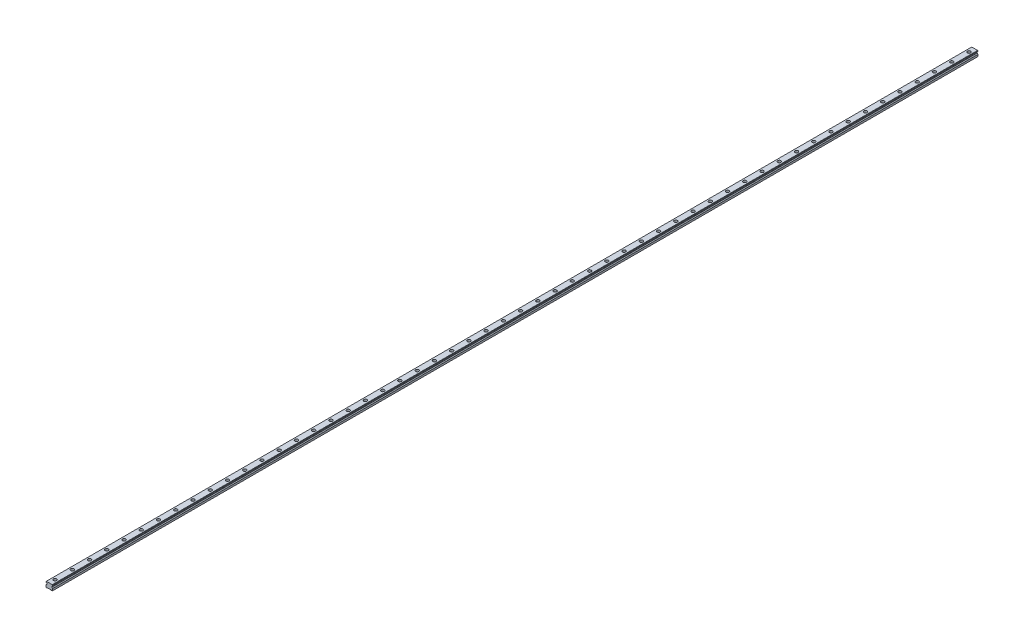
ISO-10303-21;
HEADER;
FILE_DESCRIPTION(('STEP AP214'),'2;1');
FILE_NAME('part.step','',(''),(''),'','','');
FILE_SCHEMA(('AUTOMOTIVE_DESIGN { 1 0 10303 214 1 1 1 1 }'));
ENDSEC;
DATA;
#1=APPLICATION_CONTEXT('core data for automotive mechanical design processes');
#2=APPLICATION_PROTOCOL_DEFINITION('international standard','automotive_design',2000,#1);
#3=PRODUCT_CONTEXT('',#1,'mechanical');
#4=PRODUCT('Part','Part','',(#3));
#5=PRODUCT_RELATED_PRODUCT_CATEGORY('part','',(#4));
#6=PRODUCT_DEFINITION_FORMATION('','',#4);
#7=PRODUCT_DEFINITION_CONTEXT('part definition',#1,'design');
#8=PRODUCT_DEFINITION('design','',#6,#7);
#9=PRODUCT_DEFINITION_SHAPE('','',#8);
#10=(LENGTH_UNIT() NAMED_UNIT(*) SI_UNIT(.MILLI.,.METRE.));
#11=(NAMED_UNIT(*) PLANE_ANGLE_UNIT() SI_UNIT($,.RADIAN.));
#12=(NAMED_UNIT(*) SI_UNIT($,.STERADIAN.) SOLID_ANGLE_UNIT());
#13=UNCERTAINTY_MEASURE_WITH_UNIT(LENGTH_MEASURE(1.E-05),#10,'distance_accuracy_value','');
#14=(GEOMETRIC_REPRESENTATION_CONTEXT(3) GLOBAL_UNCERTAINTY_ASSIGNED_CONTEXT((#13)) GLOBAL_UNIT_ASSIGNED_CONTEXT((#10,
#11,#12)) REPRESENTATION_CONTEXT('',''));
#15=CARTESIAN_POINT('',(0.,0.,0.));
#16=DIRECTION('',(0.,0.,1.));
#17=DIRECTION('',(1.,0.,0.));
#18=AXIS2_PLACEMENT_3D('',#15,#16,#17);
#19=CARTESIAN_POINT('',(0.,10.2,-1590.));
#20=DIRECTION('',(0.,1.,0.));
#21=DIRECTION('',(0.,0.,1.));
#22=AXIS2_PLACEMENT_3D('',#19,#20,#21);
#23=PLANE('',#22);
#24=CARTESIAN_POINT('',(0.,10.2,-1590.));
#25=DIRECTION('',(0.,1.,0.));
#26=DIRECTION('',(0.,0.,1.));
#27=AXIS2_PLACEMENT_3D('',#24,#25,#26);
#28=CIRCLE('',#27,3.49999999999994);
#29=CARTESIAN_POINT('',(0.,10.2,-1586.5));
#30=VERTEX_POINT('',#29);
#31=EDGE_CURVE('E774',#30,#30,#28,.T.);
#32=ORIENTED_EDGE('',*,*,#31,.F.);
#33=EDGE_LOOP('',(#32));
#34=FACE_BOUND('',#33,.T.);
#35=CARTESIAN_POINT('',(0.,10.2,-1590.));
#36=DIRECTION('',(0.,1.,0.));
#37=DIRECTION('',(0.,0.,1.));
#38=AXIS2_PLACEMENT_3D('',#35,#36,#37);
#39=CIRCLE('',#38,5.49999999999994);
#40=CARTESIAN_POINT('',(0.,10.2,-1584.5));
#41=VERTEX_POINT('',#40);
#42=EDGE_CURVE('E11',#41,#41,#39,.T.);
#43=ORIENTED_EDGE('',*,*,#42,.T.);
#44=EDGE_LOOP('',(#43));
#45=FACE_BOUND('',#44,.T.);
#46=ADVANCED_FACE('F39',(#34,#45),#23,.T.);
#47=CARTESIAN_POINT('',(0.,10.2,-1590.));
#48=DIRECTION('',(0.,1.,0.));
#49=DIRECTION('',(0.,0.,1.));
#50=AXIS2_PLACEMENT_3D('',#47,#48,#49);
#51=CYLINDRICAL_SURFACE('',#50,5.49999999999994);
#52=ORIENTED_EDGE('',*,*,#42,.F.);
#53=EDGE_LOOP('',(#52));
#54=FACE_BOUND('',#53,.T.);
#55=CARTESIAN_POINT('',(0.,19.2,-1590.));
#56=DIRECTION('',(0.,1.,0.));
#57=DIRECTION('',(0.,0.,1.));
#58=AXIS2_PLACEMENT_3D('',#55,#56,#57);
#59=CIRCLE('',#58,5.49999999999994);
#60=CARTESIAN_POINT('',(0.,19.2,-1584.5));
#61=VERTEX_POINT('',#60);
#62=EDGE_CURVE('E48',#61,#61,#59,.T.);
#63=ORIENTED_EDGE('',*,*,#62,.T.);
#64=EDGE_LOOP('',(#63));
#65=FACE_BOUND('',#64,.T.);
#66=ADVANCED_FACE('F1403',(#54,#65),#51,.F.);
#67=CARTESIAN_POINT('',(0.,10.2,-1530.));
#68=DIRECTION('',(0.,1.,0.));
#69=DIRECTION('',(0.,0.,1.));
#70=AXIS2_PLACEMENT_3D('',#67,#68,#69);
#71=PLANE('',#70);
#72=CARTESIAN_POINT('',(0.,10.2,-1530.));
#73=DIRECTION('',(0.,1.,0.));
#74=DIRECTION('',(0.,0.,1.));
#75=AXIS2_PLACEMENT_3D('',#72,#73,#74);
#76=CIRCLE('',#75,3.49999999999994);
#77=CARTESIAN_POINT('',(0.,10.2,-1526.5));
#78=VERTEX_POINT('',#77);
#79=EDGE_CURVE('E779',#78,#78,#76,.T.);
#80=ORIENTED_EDGE('',*,*,#79,.F.);
#81=EDGE_LOOP('',(#80));
#82=FACE_BOUND('',#81,.T.);
#83=CARTESIAN_POINT('',(0.,10.2,-1530.));
#84=DIRECTION('',(0.,1.,0.));
#85=DIRECTION('',(0.,0.,1.));
#86=AXIS2_PLACEMENT_3D('',#83,#84,#85);
#87=CIRCLE('',#86,5.49999999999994);
#88=CARTESIAN_POINT('',(0.,10.2,-1524.5));
#89=VERTEX_POINT('',#88);
#90=EDGE_CURVE('E758',#89,#89,#87,.T.);
#91=ORIENTED_EDGE('',*,*,#90,.T.);
#92=EDGE_LOOP('',(#91));
#93=FACE_BOUND('',#92,.T.);
#94=ADVANCED_FACE('F1405',(#82,#93),#71,.T.);
#95=CARTESIAN_POINT('',(0.,10.2,-1530.));
#96=DIRECTION('',(0.,1.,0.));
#97=DIRECTION('',(0.,0.,1.));
#98=AXIS2_PLACEMENT_3D('',#95,#96,#97);
#99=CYLINDRICAL_SURFACE('',#98,5.49999999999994);
#100=ORIENTED_EDGE('',*,*,#90,.F.);
#101=EDGE_LOOP('',(#100));
#102=FACE_BOUND('',#101,.T.);
#103=CARTESIAN_POINT('',(0.,19.2,-1530.));
#104=DIRECTION('',(0.,1.,0.));
#105=DIRECTION('',(0.,0.,1.));
#106=AXIS2_PLACEMENT_3D('',#103,#104,#105);
#107=CIRCLE('',#106,5.49999999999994);
#108=CARTESIAN_POINT('',(0.,19.2,-1524.5));
#109=VERTEX_POINT('',#108);
#110=EDGE_CURVE('E754',#109,#109,#107,.T.);
#111=ORIENTED_EDGE('',*,*,#110,.T.);
#112=EDGE_LOOP('',(#111));
#113=FACE_BOUND('',#112,.T.);
#114=ADVANCED_FACE('F1411',(#102,#113),#99,.F.);
#115=CARTESIAN_POINT('',(0.,10.2,-1470.));
#116=DIRECTION('',(0.,1.,0.));
#117=DIRECTION('',(0.,0.,1.));
#118=AXIS2_PLACEMENT_3D('',#115,#116,#117);
#119=PLANE('',#118);
#120=CARTESIAN_POINT('',(0.,10.2,-1470.));
#121=DIRECTION('',(0.,1.,0.));
#122=DIRECTION('',(0.,0.,1.));
#123=AXIS2_PLACEMENT_3D('',#120,#121,#122);
#124=CIRCLE('',#123,3.49999999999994);
#125=CARTESIAN_POINT('',(0.,10.2,-1466.5));
#126=VERTEX_POINT('',#125);
#127=EDGE_CURVE('E784',#126,#126,#124,.T.);
#128=ORIENTED_EDGE('',*,*,#127,.F.);
#129=EDGE_LOOP('',(#128));
#130=FACE_BOUND('',#129,.T.);
#131=CARTESIAN_POINT('',(0.,10.2,-1470.));
#132=DIRECTION('',(0.,1.,0.));
#133=DIRECTION('',(0.,0.,1.));
#134=AXIS2_PLACEMENT_3D('',#131,#132,#133);
#135=CIRCLE('',#134,5.49999999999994);
#136=CARTESIAN_POINT('',(0.,10.2,-1464.5));
#137=VERTEX_POINT('',#136);
#138=EDGE_CURVE('E750',#137,#137,#135,.T.);
#139=ORIENTED_EDGE('',*,*,#138,.T.);
#140=EDGE_LOOP('',(#139));
#141=FACE_BOUND('',#140,.T.);
#142=ADVANCED_FACE('F1419',(#130,#141),#119,.T.);
#143=CARTESIAN_POINT('',(0.,10.2,-1470.));
#144=DIRECTION('',(0.,1.,0.));
#145=DIRECTION('',(0.,0.,1.));
#146=AXIS2_PLACEMENT_3D('',#143,#144,#145);
#147=CYLINDRICAL_SURFACE('',#146,5.49999999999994);
#148=ORIENTED_EDGE('',*,*,#138,.F.);
#149=EDGE_LOOP('',(#148));
#150=FACE_BOUND('',#149,.T.);
#151=CARTESIAN_POINT('',(0.,19.2,-1470.));
#152=DIRECTION('',(0.,1.,0.));
#153=DIRECTION('',(0.,0.,1.));
#154=AXIS2_PLACEMENT_3D('',#151,#152,#153);
#155=CIRCLE('',#154,5.49999999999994);
#156=CARTESIAN_POINT('',(0.,19.2,-1464.5));
#157=VERTEX_POINT('',#156);
#158=EDGE_CURVE('E746',#157,#157,#155,.T.);
#159=ORIENTED_EDGE('',*,*,#158,.T.);
#160=EDGE_LOOP('',(#159));
#161=FACE_BOUND('',#160,.T.);
#162=ADVANCED_FACE('F1423',(#150,#161),#147,.F.);
#163=CARTESIAN_POINT('',(0.,10.2,-1410.));
#164=DIRECTION('',(0.,1.,0.));
#165=DIRECTION('',(0.,0.,1.));
#166=AXIS2_PLACEMENT_3D('',#163,#164,#165);
#167=PLANE('',#166);
#168=CARTESIAN_POINT('',(0.,10.2,-1410.));
#169=DIRECTION('',(0.,1.,0.));
#170=DIRECTION('',(0.,0.,1.));
#171=AXIS2_PLACEMENT_3D('',#168,#169,#170);
#172=CIRCLE('',#171,3.49999999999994);
#173=CARTESIAN_POINT('',(0.,10.2,-1406.5));
#174=VERTEX_POINT('',#173);
#175=EDGE_CURVE('E789',#174,#174,#172,.T.);
#176=ORIENTED_EDGE('',*,*,#175,.F.);
#177=EDGE_LOOP('',(#176));
#178=FACE_BOUND('',#177,.T.);
#179=CARTESIAN_POINT('',(0.,10.2,-1410.));
#180=DIRECTION('',(0.,1.,0.));
#181=DIRECTION('',(0.,0.,1.));
#182=AXIS2_PLACEMENT_3D('',#179,#180,#181);
#183=CIRCLE('',#182,5.49999999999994);
#184=CARTESIAN_POINT('',(0.,10.2,-1404.5));
#185=VERTEX_POINT('',#184);
#186=EDGE_CURVE('E742',#185,#185,#183,.T.);
#187=ORIENTED_EDGE('',*,*,#186,.T.);
#188=EDGE_LOOP('',(#187));
#189=FACE_BOUND('',#188,.T.);
#190=ADVANCED_FACE('F1427',(#178,#189),#167,.T.);
#191=CARTESIAN_POINT('',(0.,10.2,-1410.));
#192=DIRECTION('',(0.,1.,0.));
#193=DIRECTION('',(0.,0.,1.));
#194=AXIS2_PLACEMENT_3D('',#191,#192,#193);
#195=CYLINDRICAL_SURFACE('',#194,5.49999999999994);
#196=ORIENTED_EDGE('',*,*,#186,.F.);
#197=EDGE_LOOP('',(#196));
#198=FACE_BOUND('',#197,.T.);
#199=CARTESIAN_POINT('',(0.,19.2,-1410.));
#200=DIRECTION('',(0.,1.,0.));
#201=DIRECTION('',(0.,0.,1.));
#202=AXIS2_PLACEMENT_3D('',#199,#200,#201);
#203=CIRCLE('',#202,5.49999999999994);
#204=CARTESIAN_POINT('',(0.,19.2,-1404.5));
#205=VERTEX_POINT('',#204);
#206=EDGE_CURVE('E738',#205,#205,#203,.T.);
#207=ORIENTED_EDGE('',*,*,#206,.T.);
#208=EDGE_LOOP('',(#207));
#209=FACE_BOUND('',#208,.T.);
#210=ADVANCED_FACE('F1431',(#198,#209),#195,.F.);
#211=CARTESIAN_POINT('',(0.,10.2,-1350.));
#212=DIRECTION('',(0.,1.,0.));
#213=DIRECTION('',(0.,0.,1.));
#214=AXIS2_PLACEMENT_3D('',#211,#212,#213);
#215=PLANE('',#214);
#216=CARTESIAN_POINT('',(0.,10.2,-1350.));
#217=DIRECTION('',(0.,1.,0.));
#218=DIRECTION('',(0.,0.,1.));
#219=AXIS2_PLACEMENT_3D('',#216,#217,#218);
#220=CIRCLE('',#219,3.49999999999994);
#221=CARTESIAN_POINT('',(0.,10.2,-1346.5));
#222=VERTEX_POINT('',#221);
#223=EDGE_CURVE('E794',#222,#222,#220,.T.);
#224=ORIENTED_EDGE('',*,*,#223,.F.);
#225=EDGE_LOOP('',(#224));
#226=FACE_BOUND('',#225,.T.);
#227=CARTESIAN_POINT('',(0.,10.2,-1350.));
#228=DIRECTION('',(0.,1.,0.));
#229=DIRECTION('',(0.,0.,1.));
#230=AXIS2_PLACEMENT_3D('',#227,#228,#229);
#231=CIRCLE('',#230,5.49999999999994);
#232=CARTESIAN_POINT('',(0.,10.2,-1344.5));
#233=VERTEX_POINT('',#232);
#234=EDGE_CURVE('E734',#233,#233,#231,.T.);
#235=ORIENTED_EDGE('',*,*,#234,.T.);
#236=EDGE_LOOP('',(#235));
#237=FACE_BOUND('',#236,.T.);
#238=ADVANCED_FACE('F1435',(#226,#237),#215,.T.);
#239=CARTESIAN_POINT('',(0.,10.2,-1350.));
#240=DIRECTION('',(0.,1.,0.));
#241=DIRECTION('',(0.,0.,1.));
#242=AXIS2_PLACEMENT_3D('',#239,#240,#241);
#243=CYLINDRICAL_SURFACE('',#242,5.49999999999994);
#244=ORIENTED_EDGE('',*,*,#234,.F.);
#245=EDGE_LOOP('',(#244));
#246=FACE_BOUND('',#245,.T.);
#247=CARTESIAN_POINT('',(0.,19.2,-1350.));
#248=DIRECTION('',(0.,1.,0.));
#249=DIRECTION('',(0.,0.,1.));
#250=AXIS2_PLACEMENT_3D('',#247,#248,#249);
#251=CIRCLE('',#250,5.49999999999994);
#252=CARTESIAN_POINT('',(0.,19.2,-1344.5));
#253=VERTEX_POINT('',#252);
#254=EDGE_CURVE('E730',#253,#253,#251,.T.);
#255=ORIENTED_EDGE('',*,*,#254,.T.);
#256=EDGE_LOOP('',(#255));
#257=FACE_BOUND('',#256,.T.);
#258=ADVANCED_FACE('F1439',(#246,#257),#243,.F.);
#259=CARTESIAN_POINT('',(0.,10.2,-1290.));
#260=DIRECTION('',(0.,1.,0.));
#261=DIRECTION('',(0.,0.,1.));
#262=AXIS2_PLACEMENT_3D('',#259,#260,#261);
#263=PLANE('',#262);
#264=CARTESIAN_POINT('',(0.,10.2,-1290.));
#265=DIRECTION('',(0.,1.,0.));
#266=DIRECTION('',(0.,0.,1.));
#267=AXIS2_PLACEMENT_3D('',#264,#265,#266);
#268=CIRCLE('',#267,3.49999999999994);
#269=CARTESIAN_POINT('',(0.,10.2,-1286.5));
#270=VERTEX_POINT('',#269);
#271=EDGE_CURVE('E799',#270,#270,#268,.T.);
#272=ORIENTED_EDGE('',*,*,#271,.F.);
#273=EDGE_LOOP('',(#272));
#274=FACE_BOUND('',#273,.T.);
#275=CARTESIAN_POINT('',(0.,10.2,-1290.));
#276=DIRECTION('',(0.,1.,0.));
#277=DIRECTION('',(0.,0.,1.));
#278=AXIS2_PLACEMENT_3D('',#275,#276,#277);
#279=CIRCLE('',#278,5.49999999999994);
#280=CARTESIAN_POINT('',(0.,10.2,-1284.5));
#281=VERTEX_POINT('',#280);
#282=EDGE_CURVE('E726',#281,#281,#279,.T.);
#283=ORIENTED_EDGE('',*,*,#282,.T.);
#284=EDGE_LOOP('',(#283));
#285=FACE_BOUND('',#284,.T.);
#286=ADVANCED_FACE('F1443',(#274,#285),#263,.T.);
#287=CARTESIAN_POINT('',(0.,10.2,-1290.));
#288=DIRECTION('',(0.,1.,0.));
#289=DIRECTION('',(0.,0.,1.));
#290=AXIS2_PLACEMENT_3D('',#287,#288,#289);
#291=CYLINDRICAL_SURFACE('',#290,5.49999999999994);
#292=ORIENTED_EDGE('',*,*,#282,.F.);
#293=EDGE_LOOP('',(#292));
#294=FACE_BOUND('',#293,.T.);
#295=CARTESIAN_POINT('',(0.,19.2,-1290.));
#296=DIRECTION('',(0.,1.,0.));
#297=DIRECTION('',(0.,0.,1.));
#298=AXIS2_PLACEMENT_3D('',#295,#296,#297);
#299=CIRCLE('',#298,5.49999999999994);
#300=CARTESIAN_POINT('',(0.,19.2,-1284.5));
#301=VERTEX_POINT('',#300);
#302=EDGE_CURVE('E722',#301,#301,#299,.T.);
#303=ORIENTED_EDGE('',*,*,#302,.T.);
#304=EDGE_LOOP('',(#303));
#305=FACE_BOUND('',#304,.T.);
#306=ADVANCED_FACE('F1447',(#294,#305),#291,.F.);
#307=CARTESIAN_POINT('',(0.,10.2,-1230.));
#308=DIRECTION('',(0.,1.,0.));
#309=DIRECTION('',(0.,0.,1.));
#310=AXIS2_PLACEMENT_3D('',#307,#308,#309);
#311=PLANE('',#310);
#312=CARTESIAN_POINT('',(0.,10.2,-1230.));
#313=DIRECTION('',(0.,1.,0.));
#314=DIRECTION('',(0.,0.,1.));
#315=AXIS2_PLACEMENT_3D('',#312,#313,#314);
#316=CIRCLE('',#315,3.49999999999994);
#317=CARTESIAN_POINT('',(0.,10.2,-1226.5));
#318=VERTEX_POINT('',#317);
#319=EDGE_CURVE('E804',#318,#318,#316,.T.);
#320=ORIENTED_EDGE('',*,*,#319,.F.);
#321=EDGE_LOOP('',(#320));
#322=FACE_BOUND('',#321,.T.);
#323=CARTESIAN_POINT('',(0.,10.2,-1230.));
#324=DIRECTION('',(0.,1.,0.));
#325=DIRECTION('',(0.,0.,1.));
#326=AXIS2_PLACEMENT_3D('',#323,#324,#325);
#327=CIRCLE('',#326,5.49999999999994);
#328=CARTESIAN_POINT('',(0.,10.2,-1224.5));
#329=VERTEX_POINT('',#328);
#330=EDGE_CURVE('E718',#329,#329,#327,.T.);
#331=ORIENTED_EDGE('',*,*,#330,.T.);
#332=EDGE_LOOP('',(#331));
#333=FACE_BOUND('',#332,.T.);
#334=ADVANCED_FACE('F1451',(#322,#333),#311,.T.);
#335=CARTESIAN_POINT('',(0.,10.2,-1230.));
#336=DIRECTION('',(0.,1.,0.));
#337=DIRECTION('',(0.,0.,1.));
#338=AXIS2_PLACEMENT_3D('',#335,#336,#337);
#339=CYLINDRICAL_SURFACE('',#338,5.49999999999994);
#340=ORIENTED_EDGE('',*,*,#330,.F.);
#341=EDGE_LOOP('',(#340));
#342=FACE_BOUND('',#341,.T.);
#343=CARTESIAN_POINT('',(0.,19.2,-1230.));
#344=DIRECTION('',(0.,1.,0.));
#345=DIRECTION('',(0.,0.,1.));
#346=AXIS2_PLACEMENT_3D('',#343,#344,#345);
#347=CIRCLE('',#346,5.49999999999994);
#348=CARTESIAN_POINT('',(0.,19.2,-1224.5));
#349=VERTEX_POINT('',#348);
#350=EDGE_CURVE('E714',#349,#349,#347,.T.);
#351=ORIENTED_EDGE('',*,*,#350,.T.);
#352=EDGE_LOOP('',(#351));
#353=FACE_BOUND('',#352,.T.);
#354=ADVANCED_FACE('F1455',(#342,#353),#339,.F.);
#355=CARTESIAN_POINT('',(0.,10.2,-1170.));
#356=DIRECTION('',(0.,1.,0.));
#357=DIRECTION('',(0.,0.,1.));
#358=AXIS2_PLACEMENT_3D('',#355,#356,#357);
#359=PLANE('',#358);
#360=CARTESIAN_POINT('',(0.,10.2,-1170.));
#361=DIRECTION('',(0.,1.,0.));
#362=DIRECTION('',(0.,0.,1.));
#363=AXIS2_PLACEMENT_3D('',#360,#361,#362);
#364=CIRCLE('',#363,3.49999999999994);
#365=CARTESIAN_POINT('',(0.,10.2,-1166.5));
#366=VERTEX_POINT('',#365);
#367=EDGE_CURVE('E809',#366,#366,#364,.T.);
#368=ORIENTED_EDGE('',*,*,#367,.F.);
#369=EDGE_LOOP('',(#368));
#370=FACE_BOUND('',#369,.T.);
#371=CARTESIAN_POINT('',(0.,10.2,-1170.));
#372=DIRECTION('',(0.,1.,0.));
#373=DIRECTION('',(0.,0.,1.));
#374=AXIS2_PLACEMENT_3D('',#371,#372,#373);
#375=CIRCLE('',#374,5.49999999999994);
#376=CARTESIAN_POINT('',(0.,10.2,-1164.5));
#377=VERTEX_POINT('',#376);
#378=EDGE_CURVE('E710',#377,#377,#375,.T.);
#379=ORIENTED_EDGE('',*,*,#378,.T.);
#380=EDGE_LOOP('',(#379));
#381=FACE_BOUND('',#380,.T.);
#382=ADVANCED_FACE('F1459',(#370,#381),#359,.T.);
#383=CARTESIAN_POINT('',(0.,10.2,-1170.));
#384=DIRECTION('',(0.,1.,0.));
#385=DIRECTION('',(0.,0.,1.));
#386=AXIS2_PLACEMENT_3D('',#383,#384,#385);
#387=CYLINDRICAL_SURFACE('',#386,5.49999999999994);
#388=ORIENTED_EDGE('',*,*,#378,.F.);
#389=EDGE_LOOP('',(#388));
#390=FACE_BOUND('',#389,.T.);
#391=CARTESIAN_POINT('',(0.,19.2,-1170.));
#392=DIRECTION('',(0.,1.,0.));
#393=DIRECTION('',(0.,0.,1.));
#394=AXIS2_PLACEMENT_3D('',#391,#392,#393);
#395=CIRCLE('',#394,5.49999999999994);
#396=CARTESIAN_POINT('',(0.,19.2,-1164.5));
#397=VERTEX_POINT('',#396);
#398=EDGE_CURVE('E706',#397,#397,#395,.T.);
#399=ORIENTED_EDGE('',*,*,#398,.T.);
#400=EDGE_LOOP('',(#399));
#401=FACE_BOUND('',#400,.T.);
#402=ADVANCED_FACE('F1463',(#390,#401),#387,.F.);
#403=CARTESIAN_POINT('',(0.,10.2,-1110.));
#404=DIRECTION('',(0.,1.,0.));
#405=DIRECTION('',(0.,0.,1.));
#406=AXIS2_PLACEMENT_3D('',#403,#404,#405);
#407=PLANE('',#406);
#408=CARTESIAN_POINT('',(0.,10.2,-1110.));
#409=DIRECTION('',(0.,1.,0.));
#410=DIRECTION('',(0.,0.,1.));
#411=AXIS2_PLACEMENT_3D('',#408,#409,#410);
#412=CIRCLE('',#411,3.49999999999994);
#413=CARTESIAN_POINT('',(0.,10.2,-1106.5));
#414=VERTEX_POINT('',#413);
#415=EDGE_CURVE('E814',#414,#414,#412,.T.);
#416=ORIENTED_EDGE('',*,*,#415,.F.);
#417=EDGE_LOOP('',(#416));
#418=FACE_BOUND('',#417,.T.);
#419=CARTESIAN_POINT('',(0.,10.2,-1110.));
#420=DIRECTION('',(0.,1.,0.));
#421=DIRECTION('',(0.,0.,1.));
#422=AXIS2_PLACEMENT_3D('',#419,#420,#421);
#423=CIRCLE('',#422,5.49999999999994);
#424=CARTESIAN_POINT('',(0.,10.2,-1104.5));
#425=VERTEX_POINT('',#424);
#426=EDGE_CURVE('E702',#425,#425,#423,.T.);
#427=ORIENTED_EDGE('',*,*,#426,.T.);
#428=EDGE_LOOP('',(#427));
#429=FACE_BOUND('',#428,.T.);
#430=ADVANCED_FACE('F1467',(#418,#429),#407,.T.);
#431=CARTESIAN_POINT('',(0.,10.2,-1110.));
#432=DIRECTION('',(0.,1.,0.));
#433=DIRECTION('',(0.,0.,1.));
#434=AXIS2_PLACEMENT_3D('',#431,#432,#433);
#435=CYLINDRICAL_SURFACE('',#434,5.49999999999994);
#436=ORIENTED_EDGE('',*,*,#426,.F.);
#437=EDGE_LOOP('',(#436));
#438=FACE_BOUND('',#437,.T.);
#439=CARTESIAN_POINT('',(0.,19.2,-1110.));
#440=DIRECTION('',(0.,1.,0.));
#441=DIRECTION('',(0.,0.,1.));
#442=AXIS2_PLACEMENT_3D('',#439,#440,#441);
#443=CIRCLE('',#442,5.49999999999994);
#444=CARTESIAN_POINT('',(0.,19.2,-1104.5));
#445=VERTEX_POINT('',#444);
#446=EDGE_CURVE('E698',#445,#445,#443,.T.);
#447=ORIENTED_EDGE('',*,*,#446,.T.);
#448=EDGE_LOOP('',(#447));
#449=FACE_BOUND('',#448,.T.);
#450=ADVANCED_FACE('F1471',(#438,#449),#435,.F.);
#451=CARTESIAN_POINT('',(0.,10.2,-1050.));
#452=DIRECTION('',(0.,1.,0.));
#453=DIRECTION('',(0.,0.,1.));
#454=AXIS2_PLACEMENT_3D('',#451,#452,#453);
#455=PLANE('',#454);
#456=CARTESIAN_POINT('',(0.,10.2,-1050.));
#457=DIRECTION('',(0.,1.,0.));
#458=DIRECTION('',(0.,0.,1.));
#459=AXIS2_PLACEMENT_3D('',#456,#457,#458);
#460=CIRCLE('',#459,3.49999999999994);
#461=CARTESIAN_POINT('',(0.,10.2,-1046.5));
#462=VERTEX_POINT('',#461);
#463=EDGE_CURVE('E819',#462,#462,#460,.T.);
#464=ORIENTED_EDGE('',*,*,#463,.F.);
#465=EDGE_LOOP('',(#464));
#466=FACE_BOUND('',#465,.T.);
#467=CARTESIAN_POINT('',(0.,10.2,-1050.));
#468=DIRECTION('',(0.,1.,0.));
#469=DIRECTION('',(0.,0.,1.));
#470=AXIS2_PLACEMENT_3D('',#467,#468,#469);
#471=CIRCLE('',#470,5.49999999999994);
#472=CARTESIAN_POINT('',(0.,10.2,-1044.5));
#473=VERTEX_POINT('',#472);
#474=EDGE_CURVE('E694',#473,#473,#471,.T.);
#475=ORIENTED_EDGE('',*,*,#474,.T.);
#476=EDGE_LOOP('',(#475));
#477=FACE_BOUND('',#476,.T.);
#478=ADVANCED_FACE('F1475',(#466,#477),#455,.T.);
#479=CARTESIAN_POINT('',(0.,10.2,-1050.));
#480=DIRECTION('',(0.,1.,0.));
#481=DIRECTION('',(0.,0.,1.));
#482=AXIS2_PLACEMENT_3D('',#479,#480,#481);
#483=CYLINDRICAL_SURFACE('',#482,5.49999999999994);
#484=ORIENTED_EDGE('',*,*,#474,.F.);
#485=EDGE_LOOP('',(#484));
#486=FACE_BOUND('',#485,.T.);
#487=CARTESIAN_POINT('',(0.,19.2,-1050.));
#488=DIRECTION('',(0.,1.,0.));
#489=DIRECTION('',(0.,0.,1.));
#490=AXIS2_PLACEMENT_3D('',#487,#488,#489);
#491=CIRCLE('',#490,5.49999999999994);
#492=CARTESIAN_POINT('',(0.,19.2,-1044.5));
#493=VERTEX_POINT('',#492);
#494=EDGE_CURVE('E690',#493,#493,#491,.T.);
#495=ORIENTED_EDGE('',*,*,#494,.T.);
#496=EDGE_LOOP('',(#495));
#497=FACE_BOUND('',#496,.T.);
#498=ADVANCED_FACE('F1479',(#486,#497),#483,.F.);
#499=CARTESIAN_POINT('',(0.,10.2,-990.));
#500=DIRECTION('',(0.,1.,0.));
#501=DIRECTION('',(0.,0.,1.));
#502=AXIS2_PLACEMENT_3D('',#499,#500,#501);
#503=PLANE('',#502);
#504=CARTESIAN_POINT('',(0.,10.2,-990.));
#505=DIRECTION('',(0.,1.,0.));
#506=DIRECTION('',(0.,0.,1.));
#507=AXIS2_PLACEMENT_3D('',#504,#505,#506);
#508=CIRCLE('',#507,3.49999999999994);
#509=CARTESIAN_POINT('',(0.,10.2,-986.5));
#510=VERTEX_POINT('',#509);
#511=EDGE_CURVE('E824',#510,#510,#508,.T.);
#512=ORIENTED_EDGE('',*,*,#511,.F.);
#513=EDGE_LOOP('',(#512));
#514=FACE_BOUND('',#513,.T.);
#515=CARTESIAN_POINT('',(0.,10.2,-990.));
#516=DIRECTION('',(0.,1.,0.));
#517=DIRECTION('',(0.,0.,1.));
#518=AXIS2_PLACEMENT_3D('',#515,#516,#517);
#519=CIRCLE('',#518,5.49999999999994);
#520=CARTESIAN_POINT('',(0.,10.2,-984.5));
#521=VERTEX_POINT('',#520);
#522=EDGE_CURVE('E686',#521,#521,#519,.T.);
#523=ORIENTED_EDGE('',*,*,#522,.T.);
#524=EDGE_LOOP('',(#523));
#525=FACE_BOUND('',#524,.T.);
#526=ADVANCED_FACE('F1483',(#514,#525),#503,.T.);
#527=CARTESIAN_POINT('',(0.,10.2,-990.));
#528=DIRECTION('',(0.,1.,0.));
#529=DIRECTION('',(0.,0.,1.));
#530=AXIS2_PLACEMENT_3D('',#527,#528,#529);
#531=CYLINDRICAL_SURFACE('',#530,5.49999999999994);
#532=ORIENTED_EDGE('',*,*,#522,.F.);
#533=EDGE_LOOP('',(#532));
#534=FACE_BOUND('',#533,.T.);
#535=CARTESIAN_POINT('',(0.,19.2,-990.));
#536=DIRECTION('',(0.,1.,0.));
#537=DIRECTION('',(0.,0.,1.));
#538=AXIS2_PLACEMENT_3D('',#535,#536,#537);
#539=CIRCLE('',#538,5.49999999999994);
#540=CARTESIAN_POINT('',(0.,19.2,-984.5));
#541=VERTEX_POINT('',#540);
#542=EDGE_CURVE('E682',#541,#541,#539,.T.);
#543=ORIENTED_EDGE('',*,*,#542,.T.);
#544=EDGE_LOOP('',(#543));
#545=FACE_BOUND('',#544,.T.);
#546=ADVANCED_FACE('F1487',(#534,#545),#531,.F.);
#547=CARTESIAN_POINT('',(0.,10.2,-930.));
#548=DIRECTION('',(0.,1.,0.));
#549=DIRECTION('',(0.,0.,1.));
#550=AXIS2_PLACEMENT_3D('',#547,#548,#549);
#551=PLANE('',#550);
#552=CARTESIAN_POINT('',(0.,10.2,-930.));
#553=DIRECTION('',(0.,1.,0.));
#554=DIRECTION('',(0.,0.,1.));
#555=AXIS2_PLACEMENT_3D('',#552,#553,#554);
#556=CIRCLE('',#555,3.49999999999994);
#557=CARTESIAN_POINT('',(0.,10.2,-926.5));
#558=VERTEX_POINT('',#557);
#559=EDGE_CURVE('E829',#558,#558,#556,.T.);
#560=ORIENTED_EDGE('',*,*,#559,.F.);
#561=EDGE_LOOP('',(#560));
#562=FACE_BOUND('',#561,.T.);
#563=CARTESIAN_POINT('',(0.,10.2,-930.));
#564=DIRECTION('',(0.,1.,0.));
#565=DIRECTION('',(0.,0.,1.));
#566=AXIS2_PLACEMENT_3D('',#563,#564,#565);
#567=CIRCLE('',#566,5.49999999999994);
#568=CARTESIAN_POINT('',(0.,10.2,-924.5));
#569=VERTEX_POINT('',#568);
#570=EDGE_CURVE('E678',#569,#569,#567,.T.);
#571=ORIENTED_EDGE('',*,*,#570,.T.);
#572=EDGE_LOOP('',(#571));
#573=FACE_BOUND('',#572,.T.);
#574=ADVANCED_FACE('F1491',(#562,#573),#551,.T.);
#575=CARTESIAN_POINT('',(0.,10.2,-930.));
#576=DIRECTION('',(0.,1.,0.));
#577=DIRECTION('',(0.,0.,1.));
#578=AXIS2_PLACEMENT_3D('',#575,#576,#577);
#579=CYLINDRICAL_SURFACE('',#578,5.49999999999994);
#580=ORIENTED_EDGE('',*,*,#570,.F.);
#581=EDGE_LOOP('',(#580));
#582=FACE_BOUND('',#581,.T.);
#583=CARTESIAN_POINT('',(0.,19.2,-930.));
#584=DIRECTION('',(0.,1.,0.));
#585=DIRECTION('',(0.,0.,1.));
#586=AXIS2_PLACEMENT_3D('',#583,#584,#585);
#587=CIRCLE('',#586,5.49999999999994);
#588=CARTESIAN_POINT('',(0.,19.2,-924.5));
#589=VERTEX_POINT('',#588);
#590=EDGE_CURVE('E674',#589,#589,#587,.T.);
#591=ORIENTED_EDGE('',*,*,#590,.T.);
#592=EDGE_LOOP('',(#591));
#593=FACE_BOUND('',#592,.T.);
#594=ADVANCED_FACE('F1495',(#582,#593),#579,.F.);
#595=CARTESIAN_POINT('',(0.,10.2,-870.));
#596=DIRECTION('',(0.,1.,0.));
#597=DIRECTION('',(0.,0.,1.));
#598=AXIS2_PLACEMENT_3D('',#595,#596,#597);
#599=PLANE('',#598);
#600=CARTESIAN_POINT('',(0.,10.2,-870.));
#601=DIRECTION('',(0.,1.,0.));
#602=DIRECTION('',(0.,0.,1.));
#603=AXIS2_PLACEMENT_3D('',#600,#601,#602);
#604=CIRCLE('',#603,3.49999999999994);
#605=CARTESIAN_POINT('',(0.,10.2,-866.5));
#606=VERTEX_POINT('',#605);
#607=EDGE_CURVE('E834',#606,#606,#604,.T.);
#608=ORIENTED_EDGE('',*,*,#607,.F.);
#609=EDGE_LOOP('',(#608));
#610=FACE_BOUND('',#609,.T.);
#611=CARTESIAN_POINT('',(0.,10.2,-870.));
#612=DIRECTION('',(0.,1.,0.));
#613=DIRECTION('',(0.,0.,1.));
#614=AXIS2_PLACEMENT_3D('',#611,#612,#613);
#615=CIRCLE('',#614,5.49999999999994);
#616=CARTESIAN_POINT('',(0.,10.2,-864.5));
#617=VERTEX_POINT('',#616);
#618=EDGE_CURVE('E670',#617,#617,#615,.T.);
#619=ORIENTED_EDGE('',*,*,#618,.T.);
#620=EDGE_LOOP('',(#619));
#621=FACE_BOUND('',#620,.T.);
#622=ADVANCED_FACE('F1499',(#610,#621),#599,.T.);
#623=CARTESIAN_POINT('',(0.,10.2,-870.));
#624=DIRECTION('',(0.,1.,0.));
#625=DIRECTION('',(0.,0.,1.));
#626=AXIS2_PLACEMENT_3D('',#623,#624,#625);
#627=CYLINDRICAL_SURFACE('',#626,5.49999999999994);
#628=ORIENTED_EDGE('',*,*,#618,.F.);
#629=EDGE_LOOP('',(#628));
#630=FACE_BOUND('',#629,.T.);
#631=CARTESIAN_POINT('',(0.,19.2,-870.));
#632=DIRECTION('',(0.,1.,0.));
#633=DIRECTION('',(0.,0.,1.));
#634=AXIS2_PLACEMENT_3D('',#631,#632,#633);
#635=CIRCLE('',#634,5.49999999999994);
#636=CARTESIAN_POINT('',(0.,19.2,-864.5));
#637=VERTEX_POINT('',#636);
#638=EDGE_CURVE('E666',#637,#637,#635,.T.);
#639=ORIENTED_EDGE('',*,*,#638,.T.);
#640=EDGE_LOOP('',(#639));
#641=FACE_BOUND('',#640,.T.);
#642=ADVANCED_FACE('F1503',(#630,#641),#627,.F.);
#643=CARTESIAN_POINT('',(0.,10.2,-810.));
#644=DIRECTION('',(0.,1.,0.));
#645=DIRECTION('',(0.,0.,1.));
#646=AXIS2_PLACEMENT_3D('',#643,#644,#645);
#647=PLANE('',#646);
#648=CARTESIAN_POINT('',(0.,10.2,-810.));
#649=DIRECTION('',(0.,1.,0.));
#650=DIRECTION('',(0.,0.,1.));
#651=AXIS2_PLACEMENT_3D('',#648,#649,#650);
#652=CIRCLE('',#651,3.49999999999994);
#653=CARTESIAN_POINT('',(0.,10.2,-806.5));
#654=VERTEX_POINT('',#653);
#655=EDGE_CURVE('E839',#654,#654,#652,.T.);
#656=ORIENTED_EDGE('',*,*,#655,.F.);
#657=EDGE_LOOP('',(#656));
#658=FACE_BOUND('',#657,.T.);
#659=CARTESIAN_POINT('',(0.,10.2,-810.));
#660=DIRECTION('',(0.,1.,0.));
#661=DIRECTION('',(0.,0.,1.));
#662=AXIS2_PLACEMENT_3D('',#659,#660,#661);
#663=CIRCLE('',#662,5.49999999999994);
#664=CARTESIAN_POINT('',(0.,10.2,-804.5));
#665=VERTEX_POINT('',#664);
#666=EDGE_CURVE('E662',#665,#665,#663,.T.);
#667=ORIENTED_EDGE('',*,*,#666,.T.);
#668=EDGE_LOOP('',(#667));
#669=FACE_BOUND('',#668,.T.);
#670=ADVANCED_FACE('F1507',(#658,#669),#647,.T.);
#671=CARTESIAN_POINT('',(0.,10.2,-810.));
#672=DIRECTION('',(0.,1.,0.));
#673=DIRECTION('',(0.,0.,1.));
#674=AXIS2_PLACEMENT_3D('',#671,#672,#673);
#675=CYLINDRICAL_SURFACE('',#674,5.49999999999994);
#676=ORIENTED_EDGE('',*,*,#666,.F.);
#677=EDGE_LOOP('',(#676));
#678=FACE_BOUND('',#677,.T.);
#679=CARTESIAN_POINT('',(0.,19.2,-810.));
#680=DIRECTION('',(0.,1.,0.));
#681=DIRECTION('',(0.,0.,1.));
#682=AXIS2_PLACEMENT_3D('',#679,#680,#681);
#683=CIRCLE('',#682,5.49999999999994);
#684=CARTESIAN_POINT('',(0.,19.2,-804.5));
#685=VERTEX_POINT('',#684);
#686=EDGE_CURVE('E658',#685,#685,#683,.T.);
#687=ORIENTED_EDGE('',*,*,#686,.T.);
#688=EDGE_LOOP('',(#687));
#689=FACE_BOUND('',#688,.T.);
#690=ADVANCED_FACE('F1511',(#678,#689),#675,.F.);
#691=CARTESIAN_POINT('',(0.,10.2,-750.));
#692=DIRECTION('',(0.,1.,0.));
#693=DIRECTION('',(0.,0.,1.));
#694=AXIS2_PLACEMENT_3D('',#691,#692,#693);
#695=PLANE('',#694);
#696=CARTESIAN_POINT('',(0.,10.2,-750.));
#697=DIRECTION('',(0.,1.,0.));
#698=DIRECTION('',(0.,0.,1.));
#699=AXIS2_PLACEMENT_3D('',#696,#697,#698);
#700=CIRCLE('',#699,3.49999999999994);
#701=CARTESIAN_POINT('',(0.,10.2,-746.5));
#702=VERTEX_POINT('',#701);
#703=EDGE_CURVE('E844',#702,#702,#700,.T.);
#704=ORIENTED_EDGE('',*,*,#703,.F.);
#705=EDGE_LOOP('',(#704));
#706=FACE_BOUND('',#705,.T.);
#707=CARTESIAN_POINT('',(0.,10.2,-750.));
#708=DIRECTION('',(0.,1.,0.));
#709=DIRECTION('',(0.,0.,1.));
#710=AXIS2_PLACEMENT_3D('',#707,#708,#709);
#711=CIRCLE('',#710,5.49999999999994);
#712=CARTESIAN_POINT('',(0.,10.2,-744.5));
#713=VERTEX_POINT('',#712);
#714=EDGE_CURVE('E654',#713,#713,#711,.T.);
#715=ORIENTED_EDGE('',*,*,#714,.T.);
#716=EDGE_LOOP('',(#715));
#717=FACE_BOUND('',#716,.T.);
#718=ADVANCED_FACE('F1515',(#706,#717),#695,.T.);
#719=CARTESIAN_POINT('',(0.,10.2,-750.));
#720=DIRECTION('',(0.,1.,0.));
#721=DIRECTION('',(0.,0.,1.));
#722=AXIS2_PLACEMENT_3D('',#719,#720,#721);
#723=CYLINDRICAL_SURFACE('',#722,5.49999999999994);
#724=ORIENTED_EDGE('',*,*,#714,.F.);
#725=EDGE_LOOP('',(#724));
#726=FACE_BOUND('',#725,.T.);
#727=CARTESIAN_POINT('',(0.,19.2,-750.));
#728=DIRECTION('',(0.,1.,0.));
#729=DIRECTION('',(0.,0.,1.));
#730=AXIS2_PLACEMENT_3D('',#727,#728,#729);
#731=CIRCLE('',#730,5.49999999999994);
#732=CARTESIAN_POINT('',(0.,19.2,-744.5));
#733=VERTEX_POINT('',#732);
#734=EDGE_CURVE('E650',#733,#733,#731,.T.);
#735=ORIENTED_EDGE('',*,*,#734,.T.);
#736=EDGE_LOOP('',(#735));
#737=FACE_BOUND('',#736,.T.);
#738=ADVANCED_FACE('F1519',(#726,#737),#723,.F.);
#739=CARTESIAN_POINT('',(0.,10.2,-690.));
#740=DIRECTION('',(0.,1.,0.));
#741=DIRECTION('',(0.,0.,1.));
#742=AXIS2_PLACEMENT_3D('',#739,#740,#741);
#743=PLANE('',#742);
#744=CARTESIAN_POINT('',(0.,10.2,-690.));
#745=DIRECTION('',(0.,1.,0.));
#746=DIRECTION('',(0.,0.,1.));
#747=AXIS2_PLACEMENT_3D('',#744,#745,#746);
#748=CIRCLE('',#747,3.49999999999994);
#749=CARTESIAN_POINT('',(0.,10.2,-686.5));
#750=VERTEX_POINT('',#749);
#751=EDGE_CURVE('E849',#750,#750,#748,.T.);
#752=ORIENTED_EDGE('',*,*,#751,.F.);
#753=EDGE_LOOP('',(#752));
#754=FACE_BOUND('',#753,.T.);
#755=CARTESIAN_POINT('',(0.,10.2,-690.));
#756=DIRECTION('',(0.,1.,0.));
#757=DIRECTION('',(0.,0.,1.));
#758=AXIS2_PLACEMENT_3D('',#755,#756,#757);
#759=CIRCLE('',#758,5.49999999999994);
#760=CARTESIAN_POINT('',(0.,10.2,-684.5));
#761=VERTEX_POINT('',#760);
#762=EDGE_CURVE('E646',#761,#761,#759,.T.);
#763=ORIENTED_EDGE('',*,*,#762,.T.);
#764=EDGE_LOOP('',(#763));
#765=FACE_BOUND('',#764,.T.);
#766=ADVANCED_FACE('F1523',(#754,#765),#743,.T.);
#767=CARTESIAN_POINT('',(0.,10.2,-690.));
#768=DIRECTION('',(0.,1.,0.));
#769=DIRECTION('',(0.,0.,1.));
#770=AXIS2_PLACEMENT_3D('',#767,#768,#769);
#771=CYLINDRICAL_SURFACE('',#770,5.49999999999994);
#772=ORIENTED_EDGE('',*,*,#762,.F.);
#773=EDGE_LOOP('',(#772));
#774=FACE_BOUND('',#773,.T.);
#775=CARTESIAN_POINT('',(0.,19.2,-690.));
#776=DIRECTION('',(0.,1.,0.));
#777=DIRECTION('',(0.,0.,1.));
#778=AXIS2_PLACEMENT_3D('',#775,#776,#777);
#779=CIRCLE('',#778,5.49999999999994);
#780=CARTESIAN_POINT('',(0.,19.2,-684.5));
#781=VERTEX_POINT('',#780);
#782=EDGE_CURVE('E642',#781,#781,#779,.T.);
#783=ORIENTED_EDGE('',*,*,#782,.T.);
#784=EDGE_LOOP('',(#783));
#785=FACE_BOUND('',#784,.T.);
#786=ADVANCED_FACE('F1527',(#774,#785),#771,.F.);
#787=CARTESIAN_POINT('',(0.,10.2,-630.));
#788=DIRECTION('',(0.,1.,0.));
#789=DIRECTION('',(0.,0.,1.));
#790=AXIS2_PLACEMENT_3D('',#787,#788,#789);
#791=PLANE('',#790);
#792=CARTESIAN_POINT('',(0.,10.2,-630.));
#793=DIRECTION('',(0.,1.,0.));
#794=DIRECTION('',(0.,0.,1.));
#795=AXIS2_PLACEMENT_3D('',#792,#793,#794);
#796=CIRCLE('',#795,3.49999999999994);
#797=CARTESIAN_POINT('',(0.,10.2,-626.5));
#798=VERTEX_POINT('',#797);
#799=EDGE_CURVE('E854',#798,#798,#796,.T.);
#800=ORIENTED_EDGE('',*,*,#799,.F.);
#801=EDGE_LOOP('',(#800));
#802=FACE_BOUND('',#801,.T.);
#803=CARTESIAN_POINT('',(0.,10.2,-630.));
#804=DIRECTION('',(0.,1.,0.));
#805=DIRECTION('',(0.,0.,1.));
#806=AXIS2_PLACEMENT_3D('',#803,#804,#805);
#807=CIRCLE('',#806,5.49999999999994);
#808=CARTESIAN_POINT('',(0.,10.2,-624.5));
#809=VERTEX_POINT('',#808);
#810=EDGE_CURVE('E638',#809,#809,#807,.T.);
#811=ORIENTED_EDGE('',*,*,#810,.T.);
#812=EDGE_LOOP('',(#811));
#813=FACE_BOUND('',#812,.T.);
#814=ADVANCED_FACE('F1531',(#802,#813),#791,.T.);
#815=CARTESIAN_POINT('',(0.,10.2,-630.));
#816=DIRECTION('',(0.,1.,0.));
#817=DIRECTION('',(0.,0.,1.));
#818=AXIS2_PLACEMENT_3D('',#815,#816,#817);
#819=CYLINDRICAL_SURFACE('',#818,5.49999999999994);
#820=ORIENTED_EDGE('',*,*,#810,.F.);
#821=EDGE_LOOP('',(#820));
#822=FACE_BOUND('',#821,.T.);
#823=CARTESIAN_POINT('',(0.,19.2,-630.));
#824=DIRECTION('',(0.,1.,0.));
#825=DIRECTION('',(0.,0.,1.));
#826=AXIS2_PLACEMENT_3D('',#823,#824,#825);
#827=CIRCLE('',#826,5.49999999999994);
#828=CARTESIAN_POINT('',(0.,19.2,-624.5));
#829=VERTEX_POINT('',#828);
#830=EDGE_CURVE('E634',#829,#829,#827,.T.);
#831=ORIENTED_EDGE('',*,*,#830,.T.);
#832=EDGE_LOOP('',(#831));
#833=FACE_BOUND('',#832,.T.);
#834=ADVANCED_FACE('F1535',(#822,#833),#819,.F.);
#835=CARTESIAN_POINT('',(0.,10.2,-570.));
#836=DIRECTION('',(0.,1.,0.));
#837=DIRECTION('',(0.,0.,1.));
#838=AXIS2_PLACEMENT_3D('',#835,#836,#837);
#839=PLANE('',#838);
#840=CARTESIAN_POINT('',(0.,10.2,-570.));
#841=DIRECTION('',(0.,1.,0.));
#842=DIRECTION('',(0.,0.,1.));
#843=AXIS2_PLACEMENT_3D('',#840,#841,#842);
#844=CIRCLE('',#843,3.49999999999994);
#845=CARTESIAN_POINT('',(0.,10.2,-566.5));
#846=VERTEX_POINT('',#845);
#847=EDGE_CURVE('E859',#846,#846,#844,.T.);
#848=ORIENTED_EDGE('',*,*,#847,.F.);
#849=EDGE_LOOP('',(#848));
#850=FACE_BOUND('',#849,.T.);
#851=CARTESIAN_POINT('',(0.,10.2,-570.));
#852=DIRECTION('',(0.,1.,0.));
#853=DIRECTION('',(0.,0.,1.));
#854=AXIS2_PLACEMENT_3D('',#851,#852,#853);
#855=CIRCLE('',#854,5.49999999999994);
#856=CARTESIAN_POINT('',(0.,10.2,-564.5));
#857=VERTEX_POINT('',#856);
#858=EDGE_CURVE('E630',#857,#857,#855,.T.);
#859=ORIENTED_EDGE('',*,*,#858,.T.);
#860=EDGE_LOOP('',(#859));
#861=FACE_BOUND('',#860,.T.);
#862=ADVANCED_FACE('F1539',(#850,#861),#839,.T.);
#863=CARTESIAN_POINT('',(0.,10.2,-570.));
#864=DIRECTION('',(0.,1.,0.));
#865=DIRECTION('',(0.,0.,1.));
#866=AXIS2_PLACEMENT_3D('',#863,#864,#865);
#867=CYLINDRICAL_SURFACE('',#866,5.49999999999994);
#868=ORIENTED_EDGE('',*,*,#858,.F.);
#869=EDGE_LOOP('',(#868));
#870=FACE_BOUND('',#869,.T.);
#871=CARTESIAN_POINT('',(0.,19.2,-570.));
#872=DIRECTION('',(0.,1.,0.));
#873=DIRECTION('',(0.,0.,1.));
#874=AXIS2_PLACEMENT_3D('',#871,#872,#873);
#875=CIRCLE('',#874,5.49999999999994);
#876=CARTESIAN_POINT('',(0.,19.2,-564.5));
#877=VERTEX_POINT('',#876);
#878=EDGE_CURVE('E626',#877,#877,#875,.T.);
#879=ORIENTED_EDGE('',*,*,#878,.T.);
#880=EDGE_LOOP('',(#879));
#881=FACE_BOUND('',#880,.T.);
#882=ADVANCED_FACE('F1543',(#870,#881),#867,.F.);
#883=CARTESIAN_POINT('',(0.,10.2,-510.));
#884=DIRECTION('',(0.,1.,0.));
#885=DIRECTION('',(0.,0.,1.));
#886=AXIS2_PLACEMENT_3D('',#883,#884,#885);
#887=PLANE('',#886);
#888=CARTESIAN_POINT('',(0.,10.2,-510.));
#889=DIRECTION('',(0.,1.,0.));
#890=DIRECTION('',(0.,0.,1.));
#891=AXIS2_PLACEMENT_3D('',#888,#889,#890);
#892=CIRCLE('',#891,3.49999999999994);
#893=CARTESIAN_POINT('',(0.,10.2,-506.5));
#894=VERTEX_POINT('',#893);
#895=EDGE_CURVE('E864',#894,#894,#892,.T.);
#896=ORIENTED_EDGE('',*,*,#895,.F.);
#897=EDGE_LOOP('',(#896));
#898=FACE_BOUND('',#897,.T.);
#899=CARTESIAN_POINT('',(0.,10.2,-510.));
#900=DIRECTION('',(0.,1.,0.));
#901=DIRECTION('',(0.,0.,1.));
#902=AXIS2_PLACEMENT_3D('',#899,#900,#901);
#903=CIRCLE('',#902,5.49999999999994);
#904=CARTESIAN_POINT('',(0.,10.2,-504.5));
#905=VERTEX_POINT('',#904);
#906=EDGE_CURVE('E622',#905,#905,#903,.T.);
#907=ORIENTED_EDGE('',*,*,#906,.T.);
#908=EDGE_LOOP('',(#907));
#909=FACE_BOUND('',#908,.T.);
#910=ADVANCED_FACE('F1547',(#898,#909),#887,.T.);
#911=CARTESIAN_POINT('',(0.,10.2,-510.));
#912=DIRECTION('',(0.,1.,0.));
#913=DIRECTION('',(0.,0.,1.));
#914=AXIS2_PLACEMENT_3D('',#911,#912,#913);
#915=CYLINDRICAL_SURFACE('',#914,5.49999999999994);
#916=ORIENTED_EDGE('',*,*,#906,.F.);
#917=EDGE_LOOP('',(#916));
#918=FACE_BOUND('',#917,.T.);
#919=CARTESIAN_POINT('',(0.,19.2,-510.));
#920=DIRECTION('',(0.,1.,0.));
#921=DIRECTION('',(0.,0.,1.));
#922=AXIS2_PLACEMENT_3D('',#919,#920,#921);
#923=CIRCLE('',#922,5.49999999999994);
#924=CARTESIAN_POINT('',(0.,19.2,-504.5));
#925=VERTEX_POINT('',#924);
#926=EDGE_CURVE('E618',#925,#925,#923,.T.);
#927=ORIENTED_EDGE('',*,*,#926,.T.);
#928=EDGE_LOOP('',(#927));
#929=FACE_BOUND('',#928,.T.);
#930=ADVANCED_FACE('F1551',(#918,#929),#915,.F.);
#931=CARTESIAN_POINT('',(0.,10.2,-450.));
#932=DIRECTION('',(0.,1.,0.));
#933=DIRECTION('',(0.,0.,1.));
#934=AXIS2_PLACEMENT_3D('',#931,#932,#933);
#935=PLANE('',#934);
#936=CARTESIAN_POINT('',(0.,10.2,-450.));
#937=DIRECTION('',(0.,1.,0.));
#938=DIRECTION('',(0.,0.,1.));
#939=AXIS2_PLACEMENT_3D('',#936,#937,#938);
#940=CIRCLE('',#939,3.49999999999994);
#941=CARTESIAN_POINT('',(0.,10.2,-446.5));
#942=VERTEX_POINT('',#941);
#943=EDGE_CURVE('E869',#942,#942,#940,.T.);
#944=ORIENTED_EDGE('',*,*,#943,.F.);
#945=EDGE_LOOP('',(#944));
#946=FACE_BOUND('',#945,.T.);
#947=CARTESIAN_POINT('',(0.,10.2,-450.));
#948=DIRECTION('',(0.,1.,0.));
#949=DIRECTION('',(0.,0.,1.));
#950=AXIS2_PLACEMENT_3D('',#947,#948,#949);
#951=CIRCLE('',#950,5.49999999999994);
#952=CARTESIAN_POINT('',(0.,10.2,-444.5));
#953=VERTEX_POINT('',#952);
#954=EDGE_CURVE('E614',#953,#953,#951,.T.);
#955=ORIENTED_EDGE('',*,*,#954,.T.);
#956=EDGE_LOOP('',(#955));
#957=FACE_BOUND('',#956,.T.);
#958=ADVANCED_FACE('F1555',(#946,#957),#935,.T.);
#959=CARTESIAN_POINT('',(0.,10.2,-450.));
#960=DIRECTION('',(0.,1.,0.));
#961=DIRECTION('',(0.,0.,1.));
#962=AXIS2_PLACEMENT_3D('',#959,#960,#961);
#963=CYLINDRICAL_SURFACE('',#962,5.49999999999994);
#964=ORIENTED_EDGE('',*,*,#954,.F.);
#965=EDGE_LOOP('',(#964));
#966=FACE_BOUND('',#965,.T.);
#967=CARTESIAN_POINT('',(0.,19.2,-450.));
#968=DIRECTION('',(0.,1.,0.));
#969=DIRECTION('',(0.,0.,1.));
#970=AXIS2_PLACEMENT_3D('',#967,#968,#969);
#971=CIRCLE('',#970,5.49999999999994);
#972=CARTESIAN_POINT('',(0.,19.2,-444.5));
#973=VERTEX_POINT('',#972);
#974=EDGE_CURVE('E610',#973,#973,#971,.T.);
#975=ORIENTED_EDGE('',*,*,#974,.T.);
#976=EDGE_LOOP('',(#975));
#977=FACE_BOUND('',#976,.T.);
#978=ADVANCED_FACE('F1559',(#966,#977),#963,.F.);
#979=CARTESIAN_POINT('',(0.,10.2,-390.));
#980=DIRECTION('',(0.,1.,0.));
#981=DIRECTION('',(0.,0.,1.));
#982=AXIS2_PLACEMENT_3D('',#979,#980,#981);
#983=PLANE('',#982);
#984=CARTESIAN_POINT('',(0.,10.2,-390.));
#985=DIRECTION('',(0.,1.,0.));
#986=DIRECTION('',(0.,0.,1.));
#987=AXIS2_PLACEMENT_3D('',#984,#985,#986);
#988=CIRCLE('',#987,3.49999999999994);
#989=CARTESIAN_POINT('',(0.,10.2,-386.5));
#990=VERTEX_POINT('',#989);
#991=EDGE_CURVE('E874',#990,#990,#988,.T.);
#992=ORIENTED_EDGE('',*,*,#991,.F.);
#993=EDGE_LOOP('',(#992));
#994=FACE_BOUND('',#993,.T.);
#995=CARTESIAN_POINT('',(0.,10.2,-390.));
#996=DIRECTION('',(0.,1.,0.));
#997=DIRECTION('',(0.,0.,1.));
#998=AXIS2_PLACEMENT_3D('',#995,#996,#997);
#999=CIRCLE('',#998,5.49999999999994);
#1000=CARTESIAN_POINT('',(0.,10.2,-384.5));
#1001=VERTEX_POINT('',#1000);
#1002=EDGE_CURVE('E606',#1001,#1001,#999,.T.);
#1003=ORIENTED_EDGE('',*,*,#1002,.T.);
#1004=EDGE_LOOP('',(#1003));
#1005=FACE_BOUND('',#1004,.T.);
#1006=ADVANCED_FACE('F1563',(#994,#1005),#983,.T.);
#1007=CARTESIAN_POINT('',(0.,10.2,-390.));
#1008=DIRECTION('',(0.,1.,0.));
#1009=DIRECTION('',(0.,0.,1.));
#1010=AXIS2_PLACEMENT_3D('',#1007,#1008,#1009);
#1011=CYLINDRICAL_SURFACE('',#1010,5.49999999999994);
#1012=ORIENTED_EDGE('',*,*,#1002,.F.);
#1013=EDGE_LOOP('',(#1012));
#1014=FACE_BOUND('',#1013,.T.);
#1015=CARTESIAN_POINT('',(0.,19.2,-390.));
#1016=DIRECTION('',(0.,1.,0.));
#1017=DIRECTION('',(0.,0.,1.));
#1018=AXIS2_PLACEMENT_3D('',#1015,#1016,#1017);
#1019=CIRCLE('',#1018,5.49999999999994);
#1020=CARTESIAN_POINT('',(0.,19.2,-384.5));
#1021=VERTEX_POINT('',#1020);
#1022=EDGE_CURVE('E602',#1021,#1021,#1019,.T.);
#1023=ORIENTED_EDGE('',*,*,#1022,.T.);
#1024=EDGE_LOOP('',(#1023));
#1025=FACE_BOUND('',#1024,.T.);
#1026=ADVANCED_FACE('F1567',(#1014,#1025),#1011,.F.);
#1027=CARTESIAN_POINT('',(0.,10.2,-330.));
#1028=DIRECTION('',(0.,1.,0.));
#1029=DIRECTION('',(0.,0.,1.));
#1030=AXIS2_PLACEMENT_3D('',#1027,#1028,#1029);
#1031=PLANE('',#1030);
#1032=CARTESIAN_POINT('',(0.,10.2,-330.));
#1033=DIRECTION('',(0.,1.,0.));
#1034=DIRECTION('',(0.,0.,1.));
#1035=AXIS2_PLACEMENT_3D('',#1032,#1033,#1034);
#1036=CIRCLE('',#1035,3.49999999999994);
#1037=CARTESIAN_POINT('',(0.,10.2,-326.5));
#1038=VERTEX_POINT('',#1037);
#1039=EDGE_CURVE('E879',#1038,#1038,#1036,.T.);
#1040=ORIENTED_EDGE('',*,*,#1039,.F.);
#1041=EDGE_LOOP('',(#1040));
#1042=FACE_BOUND('',#1041,.T.);
#1043=CARTESIAN_POINT('',(0.,10.2,-330.));
#1044=DIRECTION('',(0.,1.,0.));
#1045=DIRECTION('',(0.,0.,1.));
#1046=AXIS2_PLACEMENT_3D('',#1043,#1044,#1045);
#1047=CIRCLE('',#1046,5.49999999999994);
#1048=CARTESIAN_POINT('',(0.,10.2,-324.5));
#1049=VERTEX_POINT('',#1048);
#1050=EDGE_CURVE('E598',#1049,#1049,#1047,.T.);
#1051=ORIENTED_EDGE('',*,*,#1050,.T.);
#1052=EDGE_LOOP('',(#1051));
#1053=FACE_BOUND('',#1052,.T.);
#1054=ADVANCED_FACE('F1571',(#1042,#1053),#1031,.T.);
#1055=CARTESIAN_POINT('',(0.,10.2,-330.));
#1056=DIRECTION('',(0.,1.,0.));
#1057=DIRECTION('',(0.,0.,1.));
#1058=AXIS2_PLACEMENT_3D('',#1055,#1056,#1057);
#1059=CYLINDRICAL_SURFACE('',#1058,5.49999999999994);
#1060=ORIENTED_EDGE('',*,*,#1050,.F.);
#1061=EDGE_LOOP('',(#1060));
#1062=FACE_BOUND('',#1061,.T.);
#1063=CARTESIAN_POINT('',(0.,19.2,-330.));
#1064=DIRECTION('',(0.,1.,0.));
#1065=DIRECTION('',(0.,0.,1.));
#1066=AXIS2_PLACEMENT_3D('',#1063,#1064,#1065);
#1067=CIRCLE('',#1066,5.49999999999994);
#1068=CARTESIAN_POINT('',(0.,19.2,-324.5));
#1069=VERTEX_POINT('',#1068);
#1070=EDGE_CURVE('E594',#1069,#1069,#1067,.T.);
#1071=ORIENTED_EDGE('',*,*,#1070,.T.);
#1072=EDGE_LOOP('',(#1071));
#1073=FACE_BOUND('',#1072,.T.);
#1074=ADVANCED_FACE('F1575',(#1062,#1073),#1059,.F.);
#1075=CARTESIAN_POINT('',(0.,10.2,-270.));
#1076=DIRECTION('',(0.,1.,0.));
#1077=DIRECTION('',(0.,0.,1.));
#1078=AXIS2_PLACEMENT_3D('',#1075,#1076,#1077);
#1079=PLANE('',#1078);
#1080=CARTESIAN_POINT('',(0.,10.2,-270.));
#1081=DIRECTION('',(0.,1.,0.));
#1082=DIRECTION('',(0.,0.,1.));
#1083=AXIS2_PLACEMENT_3D('',#1080,#1081,#1082);
#1084=CIRCLE('',#1083,3.49999999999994);
#1085=CARTESIAN_POINT('',(0.,10.2,-266.5));
#1086=VERTEX_POINT('',#1085);
#1087=EDGE_CURVE('E884',#1086,#1086,#1084,.T.);
#1088=ORIENTED_EDGE('',*,*,#1087,.F.);
#1089=EDGE_LOOP('',(#1088));
#1090=FACE_BOUND('',#1089,.T.);
#1091=CARTESIAN_POINT('',(0.,10.2,-270.));
#1092=DIRECTION('',(0.,1.,0.));
#1093=DIRECTION('',(0.,0.,1.));
#1094=AXIS2_PLACEMENT_3D('',#1091,#1092,#1093);
#1095=CIRCLE('',#1094,5.49999999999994);
#1096=CARTESIAN_POINT('',(0.,10.2,-264.5));
#1097=VERTEX_POINT('',#1096);
#1098=EDGE_CURVE('E590',#1097,#1097,#1095,.T.);
#1099=ORIENTED_EDGE('',*,*,#1098,.T.);
#1100=EDGE_LOOP('',(#1099));
#1101=FACE_BOUND('',#1100,.T.);
#1102=ADVANCED_FACE('F1579',(#1090,#1101),#1079,.T.);
#1103=CARTESIAN_POINT('',(0.,10.2,-270.));
#1104=DIRECTION('',(0.,1.,0.));
#1105=DIRECTION('',(0.,0.,1.));
#1106=AXIS2_PLACEMENT_3D('',#1103,#1104,#1105);
#1107=CYLINDRICAL_SURFACE('',#1106,5.49999999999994);
#1108=ORIENTED_EDGE('',*,*,#1098,.F.);
#1109=EDGE_LOOP('',(#1108));
#1110=FACE_BOUND('',#1109,.T.);
#1111=CARTESIAN_POINT('',(0.,19.2,-270.));
#1112=DIRECTION('',(0.,1.,0.));
#1113=DIRECTION('',(0.,0.,1.));
#1114=AXIS2_PLACEMENT_3D('',#1111,#1112,#1113);
#1115=CIRCLE('',#1114,5.49999999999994);
#1116=CARTESIAN_POINT('',(0.,19.2,-264.5));
#1117=VERTEX_POINT('',#1116);
#1118=EDGE_CURVE('E586',#1117,#1117,#1115,.T.);
#1119=ORIENTED_EDGE('',*,*,#1118,.T.);
#1120=EDGE_LOOP('',(#1119));
#1121=FACE_BOUND('',#1120,.T.);
#1122=ADVANCED_FACE('F1583',(#1110,#1121),#1107,.F.);
#1123=CARTESIAN_POINT('',(0.,10.2,-210.));
#1124=DIRECTION('',(0.,1.,0.));
#1125=DIRECTION('',(0.,0.,1.));
#1126=AXIS2_PLACEMENT_3D('',#1123,#1124,#1125);
#1127=PLANE('',#1126);
#1128=CARTESIAN_POINT('',(0.,10.2,-210.));
#1129=DIRECTION('',(0.,1.,0.));
#1130=DIRECTION('',(0.,0.,1.));
#1131=AXIS2_PLACEMENT_3D('',#1128,#1129,#1130);
#1132=CIRCLE('',#1131,3.49999999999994);
#1133=CARTESIAN_POINT('',(0.,10.2,-206.5));
#1134=VERTEX_POINT('',#1133);
#1135=EDGE_CURVE('E889',#1134,#1134,#1132,.T.);
#1136=ORIENTED_EDGE('',*,*,#1135,.F.);
#1137=EDGE_LOOP('',(#1136));
#1138=FACE_BOUND('',#1137,.T.);
#1139=CARTESIAN_POINT('',(0.,10.2,-210.));
#1140=DIRECTION('',(0.,1.,0.));
#1141=DIRECTION('',(0.,0.,1.));
#1142=AXIS2_PLACEMENT_3D('',#1139,#1140,#1141);
#1143=CIRCLE('',#1142,5.49999999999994);
#1144=CARTESIAN_POINT('',(0.,10.2,-204.5));
#1145=VERTEX_POINT('',#1144);
#1146=EDGE_CURVE('E582',#1145,#1145,#1143,.T.);
#1147=ORIENTED_EDGE('',*,*,#1146,.T.);
#1148=EDGE_LOOP('',(#1147));
#1149=FACE_BOUND('',#1148,.T.);
#1150=ADVANCED_FACE('F1587',(#1138,#1149),#1127,.T.);
#1151=CARTESIAN_POINT('',(0.,10.2,-210.));
#1152=DIRECTION('',(0.,1.,0.));
#1153=DIRECTION('',(0.,0.,1.));
#1154=AXIS2_PLACEMENT_3D('',#1151,#1152,#1153);
#1155=CYLINDRICAL_SURFACE('',#1154,5.49999999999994);
#1156=ORIENTED_EDGE('',*,*,#1146,.F.);
#1157=EDGE_LOOP('',(#1156));
#1158=FACE_BOUND('',#1157,.T.);
#1159=CARTESIAN_POINT('',(0.,19.2,-210.));
#1160=DIRECTION('',(0.,1.,0.));
#1161=DIRECTION('',(0.,0.,1.));
#1162=AXIS2_PLACEMENT_3D('',#1159,#1160,#1161);
#1163=CIRCLE('',#1162,5.49999999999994);
#1164=CARTESIAN_POINT('',(0.,19.2,-204.5));
#1165=VERTEX_POINT('',#1164);
#1166=EDGE_CURVE('E578',#1165,#1165,#1163,.T.);
#1167=ORIENTED_EDGE('',*,*,#1166,.T.);
#1168=EDGE_LOOP('',(#1167));
#1169=FACE_BOUND('',#1168,.T.);
#1170=ADVANCED_FACE('F1591',(#1158,#1169),#1155,.F.);
#1171=CARTESIAN_POINT('',(0.,10.2,-150.));
#1172=DIRECTION('',(0.,1.,0.));
#1173=DIRECTION('',(0.,0.,1.));
#1174=AXIS2_PLACEMENT_3D('',#1171,#1172,#1173);
#1175=PLANE('',#1174);
#1176=CARTESIAN_POINT('',(0.,10.2,-150.));
#1177=DIRECTION('',(0.,1.,0.));
#1178=DIRECTION('',(0.,0.,1.));
#1179=AXIS2_PLACEMENT_3D('',#1176,#1177,#1178);
#1180=CIRCLE('',#1179,3.49999999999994);
#1181=CARTESIAN_POINT('',(0.,10.2,-146.5));
#1182=VERTEX_POINT('',#1181);
#1183=EDGE_CURVE('E894',#1182,#1182,#1180,.T.);
#1184=ORIENTED_EDGE('',*,*,#1183,.F.);
#1185=EDGE_LOOP('',(#1184));
#1186=FACE_BOUND('',#1185,.T.);
#1187=CARTESIAN_POINT('',(0.,10.2,-150.));
#1188=DIRECTION('',(0.,1.,0.));
#1189=DIRECTION('',(0.,0.,1.));
#1190=AXIS2_PLACEMENT_3D('',#1187,#1188,#1189);
#1191=CIRCLE('',#1190,5.49999999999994);
#1192=CARTESIAN_POINT('',(0.,10.2,-144.5));
#1193=VERTEX_POINT('',#1192);
#1194=EDGE_CURVE('E574',#1193,#1193,#1191,.T.);
#1195=ORIENTED_EDGE('',*,*,#1194,.T.);
#1196=EDGE_LOOP('',(#1195));
#1197=FACE_BOUND('',#1196,.T.);
#1198=ADVANCED_FACE('F1595',(#1186,#1197),#1175,.T.);
#1199=CARTESIAN_POINT('',(0.,10.2,-150.));
#1200=DIRECTION('',(0.,1.,0.));
#1201=DIRECTION('',(0.,0.,1.));
#1202=AXIS2_PLACEMENT_3D('',#1199,#1200,#1201);
#1203=CYLINDRICAL_SURFACE('',#1202,5.49999999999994);
#1204=ORIENTED_EDGE('',*,*,#1194,.F.);
#1205=EDGE_LOOP('',(#1204));
#1206=FACE_BOUND('',#1205,.T.);
#1207=CARTESIAN_POINT('',(0.,19.2,-150.));
#1208=DIRECTION('',(0.,1.,0.));
#1209=DIRECTION('',(0.,0.,1.));
#1210=AXIS2_PLACEMENT_3D('',#1207,#1208,#1209);
#1211=CIRCLE('',#1210,5.49999999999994);
#1212=CARTESIAN_POINT('',(0.,19.2,-144.5));
#1213=VERTEX_POINT('',#1212);
#1214=EDGE_CURVE('E570',#1213,#1213,#1211,.T.);
#1215=ORIENTED_EDGE('',*,*,#1214,.T.);
#1216=EDGE_LOOP('',(#1215));
#1217=FACE_BOUND('',#1216,.T.);
#1218=ADVANCED_FACE('F1599',(#1206,#1217),#1203,.F.);
#1219=CARTESIAN_POINT('',(0.,10.2,-89.9999999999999));
#1220=DIRECTION('',(0.,1.,0.));
#1221=DIRECTION('',(0.,0.,1.));
#1222=AXIS2_PLACEMENT_3D('',#1219,#1220,#1221);
#1223=PLANE('',#1222);
#1224=CARTESIAN_POINT('',(0.,10.2,-89.9999999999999));
#1225=DIRECTION('',(0.,1.,0.));
#1226=DIRECTION('',(0.,0.,1.));
#1227=AXIS2_PLACEMENT_3D('',#1224,#1225,#1226);
#1228=CIRCLE('',#1227,3.49999999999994);
#1229=CARTESIAN_POINT('',(0.,10.2,-86.4999999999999));
#1230=VERTEX_POINT('',#1229);
#1231=EDGE_CURVE('E899',#1230,#1230,#1228,.T.);
#1232=ORIENTED_EDGE('',*,*,#1231,.F.);
#1233=EDGE_LOOP('',(#1232));
#1234=FACE_BOUND('',#1233,.T.);
#1235=CARTESIAN_POINT('',(0.,10.2,-89.9999999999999));
#1236=DIRECTION('',(0.,1.,0.));
#1237=DIRECTION('',(0.,0.,1.));
#1238=AXIS2_PLACEMENT_3D('',#1235,#1236,#1237);
#1239=CIRCLE('',#1238,5.49999999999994);
#1240=CARTESIAN_POINT('',(0.,10.2,-84.4999999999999));
#1241=VERTEX_POINT('',#1240);
#1242=EDGE_CURVE('E566',#1241,#1241,#1239,.T.);
#1243=ORIENTED_EDGE('',*,*,#1242,.T.);
#1244=EDGE_LOOP('',(#1243));
#1245=FACE_BOUND('',#1244,.T.);
#1246=ADVANCED_FACE('F1603',(#1234,#1245),#1223,.T.);
#1247=CARTESIAN_POINT('',(0.,10.2,-89.9999999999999));
#1248=DIRECTION('',(0.,1.,0.));
#1249=DIRECTION('',(0.,0.,1.));
#1250=AXIS2_PLACEMENT_3D('',#1247,#1248,#1249);
#1251=CYLINDRICAL_SURFACE('',#1250,5.49999999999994);
#1252=ORIENTED_EDGE('',*,*,#1242,.F.);
#1253=EDGE_LOOP('',(#1252));
#1254=FACE_BOUND('',#1253,.T.);
#1255=CARTESIAN_POINT('',(0.,19.2,-89.9999999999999));
#1256=DIRECTION('',(0.,1.,0.));
#1257=DIRECTION('',(0.,0.,1.));
#1258=AXIS2_PLACEMENT_3D('',#1255,#1256,#1257);
#1259=CIRCLE('',#1258,5.49999999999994);
#1260=CARTESIAN_POINT('',(0.,19.2,-84.4999999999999));
#1261=VERTEX_POINT('',#1260);
#1262=EDGE_CURVE('E562',#1261,#1261,#1259,.T.);
#1263=ORIENTED_EDGE('',*,*,#1262,.T.);
#1264=EDGE_LOOP('',(#1263));
#1265=FACE_BOUND('',#1264,.T.);
#1266=ADVANCED_FACE('F1607',(#1254,#1265),#1251,.F.);
#1267=CARTESIAN_POINT('',(0.,10.2,-29.9999999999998));
#1268=DIRECTION('',(0.,1.,0.));
#1269=DIRECTION('',(0.,0.,1.));
#1270=AXIS2_PLACEMENT_3D('',#1267,#1268,#1269);
#1271=PLANE('',#1270);
#1272=CARTESIAN_POINT('',(0.,10.2,-29.9999999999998));
#1273=DIRECTION('',(0.,1.,0.));
#1274=DIRECTION('',(0.,0.,1.));
#1275=AXIS2_PLACEMENT_3D('',#1272,#1273,#1274);
#1276=CIRCLE('',#1275,3.49999999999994);
#1277=CARTESIAN_POINT('',(0.,10.2,-26.4999999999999));
#1278=VERTEX_POINT('',#1277);
#1279=EDGE_CURVE('E904',#1278,#1278,#1276,.T.);
#1280=ORIENTED_EDGE('',*,*,#1279,.F.);
#1281=EDGE_LOOP('',(#1280));
#1282=FACE_BOUND('',#1281,.T.);
#1283=CARTESIAN_POINT('',(0.,10.2,-29.9999999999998));
#1284=DIRECTION('',(0.,1.,0.));
#1285=DIRECTION('',(0.,0.,1.));
#1286=AXIS2_PLACEMENT_3D('',#1283,#1284,#1285);
#1287=CIRCLE('',#1286,5.49999999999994);
#1288=CARTESIAN_POINT('',(0.,10.2,-24.4999999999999));
#1289=VERTEX_POINT('',#1288);
#1290=EDGE_CURVE('E558',#1289,#1289,#1287,.T.);
#1291=ORIENTED_EDGE('',*,*,#1290,.T.);
#1292=EDGE_LOOP('',(#1291));
#1293=FACE_BOUND('',#1292,.T.);
#1294=ADVANCED_FACE('F1611',(#1282,#1293),#1271,.T.);
#1295=CARTESIAN_POINT('',(0.,10.2,-29.9999999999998));
#1296=DIRECTION('',(0.,1.,0.));
#1297=DIRECTION('',(0.,0.,1.));
#1298=AXIS2_PLACEMENT_3D('',#1295,#1296,#1297);
#1299=CYLINDRICAL_SURFACE('',#1298,5.49999999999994);
#1300=ORIENTED_EDGE('',*,*,#1290,.F.);
#1301=EDGE_LOOP('',(#1300));
#1302=FACE_BOUND('',#1301,.T.);
#1303=CARTESIAN_POINT('',(0.,19.2,-29.9999999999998));
#1304=DIRECTION('',(0.,1.,0.));
#1305=DIRECTION('',(0.,0.,1.));
#1306=AXIS2_PLACEMENT_3D('',#1303,#1304,#1305);
#1307=CIRCLE('',#1306,5.49999999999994);
#1308=CARTESIAN_POINT('',(0.,19.2,-24.4999999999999));
#1309=VERTEX_POINT('',#1308);
#1310=EDGE_CURVE('E554',#1309,#1309,#1307,.T.);
#1311=ORIENTED_EDGE('',*,*,#1310,.T.);
#1312=EDGE_LOOP('',(#1311));
#1313=FACE_BOUND('',#1312,.T.);
#1314=ADVANCED_FACE('F1615',(#1302,#1313),#1299,.F.);
#1315=CARTESIAN_POINT('',(0.,10.2,30.));
#1316=DIRECTION('',(0.,1.,0.));
#1317=DIRECTION('',(0.,0.,1.));
#1318=AXIS2_PLACEMENT_3D('',#1315,#1316,#1317);
#1319=PLANE('',#1318);
#1320=CARTESIAN_POINT('',(0.,10.2,30.));
#1321=DIRECTION('',(0.,1.,0.));
#1322=DIRECTION('',(0.,0.,1.));
#1323=AXIS2_PLACEMENT_3D('',#1320,#1321,#1322);
#1324=CIRCLE('',#1323,3.49999999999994);
#1325=CARTESIAN_POINT('',(0.,10.2,33.5));
#1326=VERTEX_POINT('',#1325);
#1327=EDGE_CURVE('E909',#1326,#1326,#1324,.T.);
#1328=ORIENTED_EDGE('',*,*,#1327,.F.);
#1329=EDGE_LOOP('',(#1328));
#1330=FACE_BOUND('',#1329,.T.);
#1331=CARTESIAN_POINT('',(0.,10.2,30.));
#1332=DIRECTION('',(0.,1.,0.));
#1333=DIRECTION('',(0.,0.,1.));
#1334=AXIS2_PLACEMENT_3D('',#1331,#1332,#1333);
#1335=CIRCLE('',#1334,5.49999999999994);
#1336=CARTESIAN_POINT('',(0.,10.2,35.5));
#1337=VERTEX_POINT('',#1336);
#1338=EDGE_CURVE('E550',#1337,#1337,#1335,.T.);
#1339=ORIENTED_EDGE('',*,*,#1338,.T.);
#1340=EDGE_LOOP('',(#1339));
#1341=FACE_BOUND('',#1340,.T.);
#1342=ADVANCED_FACE('F1619',(#1330,#1341),#1319,.T.);
#1343=CARTESIAN_POINT('',(0.,10.2,30.));
#1344=DIRECTION('',(0.,1.,0.));
#1345=DIRECTION('',(0.,0.,1.));
#1346=AXIS2_PLACEMENT_3D('',#1343,#1344,#1345);
#1347=CYLINDRICAL_SURFACE('',#1346,5.49999999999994);
#1348=ORIENTED_EDGE('',*,*,#1338,.F.);
#1349=EDGE_LOOP('',(#1348));
#1350=FACE_BOUND('',#1349,.T.);
#1351=CARTESIAN_POINT('',(0.,19.2,30.));
#1352=DIRECTION('',(0.,1.,0.));
#1353=DIRECTION('',(0.,0.,1.));
#1354=AXIS2_PLACEMENT_3D('',#1351,#1352,#1353);
#1355=CIRCLE('',#1354,5.49999999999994);
#1356=CARTESIAN_POINT('',(0.,19.2,35.5));
#1357=VERTEX_POINT('',#1356);
#1358=EDGE_CURVE('E546',#1357,#1357,#1355,.T.);
#1359=ORIENTED_EDGE('',*,*,#1358,.T.);
#1360=EDGE_LOOP('',(#1359));
#1361=FACE_BOUND('',#1360,.T.);
#1362=ADVANCED_FACE('F1623',(#1350,#1361),#1347,.F.);
#1363=CARTESIAN_POINT('',(0.,10.2,90.0000000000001));
#1364=DIRECTION('',(0.,1.,0.));
#1365=DIRECTION('',(0.,0.,1.));
#1366=AXIS2_PLACEMENT_3D('',#1363,#1364,#1365);
#1367=PLANE('',#1366);
#1368=CARTESIAN_POINT('',(0.,10.2,90.0000000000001));
#1369=DIRECTION('',(0.,1.,0.));
#1370=DIRECTION('',(0.,0.,1.));
#1371=AXIS2_PLACEMENT_3D('',#1368,#1369,#1370);
#1372=CIRCLE('',#1371,3.49999999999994);
#1373=CARTESIAN_POINT('',(0.,10.2,93.5));
#1374=VERTEX_POINT('',#1373);
#1375=EDGE_CURVE('E914',#1374,#1374,#1372,.T.);
#1376=ORIENTED_EDGE('',*,*,#1375,.F.);
#1377=EDGE_LOOP('',(#1376));
#1378=FACE_BOUND('',#1377,.T.);
#1379=CARTESIAN_POINT('',(0.,10.2,90.0000000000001));
#1380=DIRECTION('',(0.,1.,0.));
#1381=DIRECTION('',(0.,0.,1.));
#1382=AXIS2_PLACEMENT_3D('',#1379,#1380,#1381);
#1383=CIRCLE('',#1382,5.49999999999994);
#1384=CARTESIAN_POINT('',(0.,10.2,95.5));
#1385=VERTEX_POINT('',#1384);
#1386=EDGE_CURVE('E542',#1385,#1385,#1383,.T.);
#1387=ORIENTED_EDGE('',*,*,#1386,.T.);
#1388=EDGE_LOOP('',(#1387));
#1389=FACE_BOUND('',#1388,.T.);
#1390=ADVANCED_FACE('F1627',(#1378,#1389),#1367,.T.);
#1391=CARTESIAN_POINT('',(0.,10.2,90.0000000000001));
#1392=DIRECTION('',(0.,1.,0.));
#1393=DIRECTION('',(0.,0.,1.));
#1394=AXIS2_PLACEMENT_3D('',#1391,#1392,#1393);
#1395=CYLINDRICAL_SURFACE('',#1394,5.49999999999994);
#1396=ORIENTED_EDGE('',*,*,#1386,.F.);
#1397=EDGE_LOOP('',(#1396));
#1398=FACE_BOUND('',#1397,.T.);
#1399=CARTESIAN_POINT('',(0.,19.2,90.0000000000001));
#1400=DIRECTION('',(0.,1.,0.));
#1401=DIRECTION('',(0.,0.,1.));
#1402=AXIS2_PLACEMENT_3D('',#1399,#1400,#1401);
#1403=CIRCLE('',#1402,5.49999999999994);
#1404=CARTESIAN_POINT('',(0.,19.2,95.5));
#1405=VERTEX_POINT('',#1404);
#1406=EDGE_CURVE('E538',#1405,#1405,#1403,.T.);
#1407=ORIENTED_EDGE('',*,*,#1406,.T.);
#1408=EDGE_LOOP('',(#1407));
#1409=FACE_BOUND('',#1408,.T.);
#1410=ADVANCED_FACE('F1631',(#1398,#1409),#1395,.F.);
#1411=CARTESIAN_POINT('',(0.,10.2,150.));
#1412=DIRECTION('',(0.,1.,0.));
#1413=DIRECTION('',(0.,0.,1.));
#1414=AXIS2_PLACEMENT_3D('',#1411,#1412,#1413);
#1415=PLANE('',#1414);
#1416=CARTESIAN_POINT('',(0.,10.2,150.));
#1417=DIRECTION('',(0.,1.,0.));
#1418=DIRECTION('',(0.,0.,1.));
#1419=AXIS2_PLACEMENT_3D('',#1416,#1417,#1418);
#1420=CIRCLE('',#1419,3.49999999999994);
#1421=CARTESIAN_POINT('',(0.,10.2,153.5));
#1422=VERTEX_POINT('',#1421);
#1423=EDGE_CURVE('E919',#1422,#1422,#1420,.T.);
#1424=ORIENTED_EDGE('',*,*,#1423,.F.);
#1425=EDGE_LOOP('',(#1424));
#1426=FACE_BOUND('',#1425,.T.);
#1427=CARTESIAN_POINT('',(0.,10.2,150.));
#1428=DIRECTION('',(0.,1.,0.));
#1429=DIRECTION('',(0.,0.,1.));
#1430=AXIS2_PLACEMENT_3D('',#1427,#1428,#1429);
#1431=CIRCLE('',#1430,5.49999999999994);
#1432=CARTESIAN_POINT('',(0.,10.2,155.5));
#1433=VERTEX_POINT('',#1432);
#1434=EDGE_CURVE('E534',#1433,#1433,#1431,.T.);
#1435=ORIENTED_EDGE('',*,*,#1434,.T.);
#1436=EDGE_LOOP('',(#1435));
#1437=FACE_BOUND('',#1436,.T.);
#1438=ADVANCED_FACE('F1635',(#1426,#1437),#1415,.T.);
#1439=CARTESIAN_POINT('',(0.,10.2,150.));
#1440=DIRECTION('',(0.,1.,0.));
#1441=DIRECTION('',(0.,0.,1.));
#1442=AXIS2_PLACEMENT_3D('',#1439,#1440,#1441);
#1443=CYLINDRICAL_SURFACE('',#1442,5.49999999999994);
#1444=ORIENTED_EDGE('',*,*,#1434,.F.);
#1445=EDGE_LOOP('',(#1444));
#1446=FACE_BOUND('',#1445,.T.);
#1447=CARTESIAN_POINT('',(0.,19.2,150.));
#1448=DIRECTION('',(0.,1.,0.));
#1449=DIRECTION('',(0.,0.,1.));
#1450=AXIS2_PLACEMENT_3D('',#1447,#1448,#1449);
#1451=CIRCLE('',#1450,5.49999999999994);
#1452=CARTESIAN_POINT('',(0.,19.2,155.5));
#1453=VERTEX_POINT('',#1452);
#1454=EDGE_CURVE('E530',#1453,#1453,#1451,.T.);
#1455=ORIENTED_EDGE('',*,*,#1454,.T.);
#1456=EDGE_LOOP('',(#1455));
#1457=FACE_BOUND('',#1456,.T.);
#1458=ADVANCED_FACE('F1639',(#1446,#1457),#1443,.F.);
#1459=CARTESIAN_POINT('',(0.,10.2,210.));
#1460=DIRECTION('',(0.,1.,0.));
#1461=DIRECTION('',(0.,0.,1.));
#1462=AXIS2_PLACEMENT_3D('',#1459,#1460,#1461);
#1463=PLANE('',#1462);
#1464=CARTESIAN_POINT('',(0.,10.2,210.));
#1465=DIRECTION('',(0.,1.,0.));
#1466=DIRECTION('',(0.,0.,1.));
#1467=AXIS2_PLACEMENT_3D('',#1464,#1465,#1466);
#1468=CIRCLE('',#1467,3.49999999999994);
#1469=CARTESIAN_POINT('',(0.,10.2,213.5));
#1470=VERTEX_POINT('',#1469);
#1471=EDGE_CURVE('E924',#1470,#1470,#1468,.T.);
#1472=ORIENTED_EDGE('',*,*,#1471,.F.);
#1473=EDGE_LOOP('',(#1472));
#1474=FACE_BOUND('',#1473,.T.);
#1475=CARTESIAN_POINT('',(0.,10.2,210.));
#1476=DIRECTION('',(0.,1.,0.));
#1477=DIRECTION('',(0.,0.,1.));
#1478=AXIS2_PLACEMENT_3D('',#1475,#1476,#1477);
#1479=CIRCLE('',#1478,5.49999999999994);
#1480=CARTESIAN_POINT('',(0.,10.2,215.5));
#1481=VERTEX_POINT('',#1480);
#1482=EDGE_CURVE('E526',#1481,#1481,#1479,.T.);
#1483=ORIENTED_EDGE('',*,*,#1482,.T.);
#1484=EDGE_LOOP('',(#1483));
#1485=FACE_BOUND('',#1484,.T.);
#1486=ADVANCED_FACE('F1643',(#1474,#1485),#1463,.T.);
#1487=CARTESIAN_POINT('',(0.,10.2,210.));
#1488=DIRECTION('',(0.,1.,0.));
#1489=DIRECTION('',(0.,0.,1.));
#1490=AXIS2_PLACEMENT_3D('',#1487,#1488,#1489);
#1491=CYLINDRICAL_SURFACE('',#1490,5.49999999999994);
#1492=ORIENTED_EDGE('',*,*,#1482,.F.);
#1493=EDGE_LOOP('',(#1492));
#1494=FACE_BOUND('',#1493,.T.);
#1495=CARTESIAN_POINT('',(0.,19.2,210.));
#1496=DIRECTION('',(0.,1.,0.));
#1497=DIRECTION('',(0.,0.,1.));
#1498=AXIS2_PLACEMENT_3D('',#1495,#1496,#1497);
#1499=CIRCLE('',#1498,5.49999999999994);
#1500=CARTESIAN_POINT('',(0.,19.2,215.5));
#1501=VERTEX_POINT('',#1500);
#1502=EDGE_CURVE('E522',#1501,#1501,#1499,.T.);
#1503=ORIENTED_EDGE('',*,*,#1502,.T.);
#1504=EDGE_LOOP('',(#1503));
#1505=FACE_BOUND('',#1504,.T.);
#1506=ADVANCED_FACE('F1647',(#1494,#1505),#1491,.F.);
#1507=CARTESIAN_POINT('',(0.,10.2,270.));
#1508=DIRECTION('',(0.,1.,0.));
#1509=DIRECTION('',(0.,0.,1.));
#1510=AXIS2_PLACEMENT_3D('',#1507,#1508,#1509);
#1511=PLANE('',#1510);
#1512=CARTESIAN_POINT('',(0.,10.2,270.));
#1513=DIRECTION('',(0.,1.,0.));
#1514=DIRECTION('',(0.,0.,1.));
#1515=AXIS2_PLACEMENT_3D('',#1512,#1513,#1514);
#1516=CIRCLE('',#1515,3.49999999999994);
#1517=CARTESIAN_POINT('',(0.,10.2,273.5));
#1518=VERTEX_POINT('',#1517);
#1519=EDGE_CURVE('E929',#1518,#1518,#1516,.T.);
#1520=ORIENTED_EDGE('',*,*,#1519,.F.);
#1521=EDGE_LOOP('',(#1520));
#1522=FACE_BOUND('',#1521,.T.);
#1523=CARTESIAN_POINT('',(0.,10.2,270.));
#1524=DIRECTION('',(0.,1.,0.));
#1525=DIRECTION('',(0.,0.,1.));
#1526=AXIS2_PLACEMENT_3D('',#1523,#1524,#1525);
#1527=CIRCLE('',#1526,5.49999999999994);
#1528=CARTESIAN_POINT('',(0.,10.2,275.5));
#1529=VERTEX_POINT('',#1528);
#1530=EDGE_CURVE('E518',#1529,#1529,#1527,.T.);
#1531=ORIENTED_EDGE('',*,*,#1530,.T.);
#1532=EDGE_LOOP('',(#1531));
#1533=FACE_BOUND('',#1532,.T.);
#1534=ADVANCED_FACE('F1651',(#1522,#1533),#1511,.T.);
#1535=CARTESIAN_POINT('',(0.,10.2,270.));
#1536=DIRECTION('',(0.,1.,0.));
#1537=DIRECTION('',(0.,0.,1.));
#1538=AXIS2_PLACEMENT_3D('',#1535,#1536,#1537);
#1539=CYLINDRICAL_SURFACE('',#1538,5.49999999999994);
#1540=ORIENTED_EDGE('',*,*,#1530,.F.);
#1541=EDGE_LOOP('',(#1540));
#1542=FACE_BOUND('',#1541,.T.);
#1543=CARTESIAN_POINT('',(0.,19.2,270.));
#1544=DIRECTION('',(0.,1.,0.));
#1545=DIRECTION('',(0.,0.,1.));
#1546=AXIS2_PLACEMENT_3D('',#1543,#1544,#1545);
#1547=CIRCLE('',#1546,5.49999999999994);
#1548=CARTESIAN_POINT('',(0.,19.2,275.5));
#1549=VERTEX_POINT('',#1548);
#1550=EDGE_CURVE('E514',#1549,#1549,#1547,.T.);
#1551=ORIENTED_EDGE('',*,*,#1550,.T.);
#1552=EDGE_LOOP('',(#1551));
#1553=FACE_BOUND('',#1552,.T.);
#1554=ADVANCED_FACE('F1655',(#1542,#1553),#1539,.F.);
#1555=CARTESIAN_POINT('',(0.,10.2,330.));
#1556=DIRECTION('',(0.,1.,0.));
#1557=DIRECTION('',(0.,0.,1.));
#1558=AXIS2_PLACEMENT_3D('',#1555,#1556,#1557);
#1559=PLANE('',#1558);
#1560=CARTESIAN_POINT('',(0.,10.2,330.));
#1561=DIRECTION('',(0.,1.,0.));
#1562=DIRECTION('',(0.,0.,1.));
#1563=AXIS2_PLACEMENT_3D('',#1560,#1561,#1562);
#1564=CIRCLE('',#1563,3.49999999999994);
#1565=CARTESIAN_POINT('',(0.,10.2,333.5));
#1566=VERTEX_POINT('',#1565);
#1567=EDGE_CURVE('E934',#1566,#1566,#1564,.T.);
#1568=ORIENTED_EDGE('',*,*,#1567,.F.);
#1569=EDGE_LOOP('',(#1568));
#1570=FACE_BOUND('',#1569,.T.);
#1571=CARTESIAN_POINT('',(0.,10.2,330.));
#1572=DIRECTION('',(0.,1.,0.));
#1573=DIRECTION('',(0.,0.,1.));
#1574=AXIS2_PLACEMENT_3D('',#1571,#1572,#1573);
#1575=CIRCLE('',#1574,5.49999999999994);
#1576=CARTESIAN_POINT('',(0.,10.2,335.5));
#1577=VERTEX_POINT('',#1576);
#1578=EDGE_CURVE('E510',#1577,#1577,#1575,.T.);
#1579=ORIENTED_EDGE('',*,*,#1578,.T.);
#1580=EDGE_LOOP('',(#1579));
#1581=FACE_BOUND('',#1580,.T.);
#1582=ADVANCED_FACE('F1659',(#1570,#1581),#1559,.T.);
#1583=CARTESIAN_POINT('',(0.,10.2,330.));
#1584=DIRECTION('',(0.,1.,0.));
#1585=DIRECTION('',(0.,0.,1.));
#1586=AXIS2_PLACEMENT_3D('',#1583,#1584,#1585);
#1587=CYLINDRICAL_SURFACE('',#1586,5.49999999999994);
#1588=ORIENTED_EDGE('',*,*,#1578,.F.);
#1589=EDGE_LOOP('',(#1588));
#1590=FACE_BOUND('',#1589,.T.);
#1591=CARTESIAN_POINT('',(0.,19.2,330.));
#1592=DIRECTION('',(0.,1.,0.));
#1593=DIRECTION('',(0.,0.,1.));
#1594=AXIS2_PLACEMENT_3D('',#1591,#1592,#1593);
#1595=CIRCLE('',#1594,5.49999999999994);
#1596=CARTESIAN_POINT('',(0.,19.2,335.5));
#1597=VERTEX_POINT('',#1596);
#1598=EDGE_CURVE('E506',#1597,#1597,#1595,.T.);
#1599=ORIENTED_EDGE('',*,*,#1598,.T.);
#1600=EDGE_LOOP('',(#1599));
#1601=FACE_BOUND('',#1600,.T.);
#1602=ADVANCED_FACE('F1663',(#1590,#1601),#1587,.F.);
#1603=CARTESIAN_POINT('',(0.,10.2,390.));
#1604=DIRECTION('',(0.,1.,0.));
#1605=DIRECTION('',(0.,0.,1.));
#1606=AXIS2_PLACEMENT_3D('',#1603,#1604,#1605);
#1607=PLANE('',#1606);
#1608=CARTESIAN_POINT('',(0.,10.2,390.));
#1609=DIRECTION('',(0.,1.,0.));
#1610=DIRECTION('',(0.,0.,1.));
#1611=AXIS2_PLACEMENT_3D('',#1608,#1609,#1610);
#1612=CIRCLE('',#1611,3.49999999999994);
#1613=CARTESIAN_POINT('',(0.,10.2,393.5));
#1614=VERTEX_POINT('',#1613);
#1615=EDGE_CURVE('E939',#1614,#1614,#1612,.T.);
#1616=ORIENTED_EDGE('',*,*,#1615,.F.);
#1617=EDGE_LOOP('',(#1616));
#1618=FACE_BOUND('',#1617,.T.);
#1619=CARTESIAN_POINT('',(0.,10.2,390.));
#1620=DIRECTION('',(0.,1.,0.));
#1621=DIRECTION('',(0.,0.,1.));
#1622=AXIS2_PLACEMENT_3D('',#1619,#1620,#1621);
#1623=CIRCLE('',#1622,5.49999999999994);
#1624=CARTESIAN_POINT('',(0.,10.2,395.5));
#1625=VERTEX_POINT('',#1624);
#1626=EDGE_CURVE('E502',#1625,#1625,#1623,.T.);
#1627=ORIENTED_EDGE('',*,*,#1626,.T.);
#1628=EDGE_LOOP('',(#1627));
#1629=FACE_BOUND('',#1628,.T.);
#1630=ADVANCED_FACE('F1667',(#1618,#1629),#1607,.T.);
#1631=CARTESIAN_POINT('',(0.,10.2,390.));
#1632=DIRECTION('',(0.,1.,0.));
#1633=DIRECTION('',(0.,0.,1.));
#1634=AXIS2_PLACEMENT_3D('',#1631,#1632,#1633);
#1635=CYLINDRICAL_SURFACE('',#1634,5.49999999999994);
#1636=ORIENTED_EDGE('',*,*,#1626,.F.);
#1637=EDGE_LOOP('',(#1636));
#1638=FACE_BOUND('',#1637,.T.);
#1639=CARTESIAN_POINT('',(0.,19.2,390.));
#1640=DIRECTION('',(0.,1.,0.));
#1641=DIRECTION('',(0.,0.,1.));
#1642=AXIS2_PLACEMENT_3D('',#1639,#1640,#1641);
#1643=CIRCLE('',#1642,5.49999999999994);
#1644=CARTESIAN_POINT('',(0.,19.2,395.5));
#1645=VERTEX_POINT('',#1644);
#1646=EDGE_CURVE('E498',#1645,#1645,#1643,.T.);
#1647=ORIENTED_EDGE('',*,*,#1646,.T.);
#1648=EDGE_LOOP('',(#1647));
#1649=FACE_BOUND('',#1648,.T.);
#1650=ADVANCED_FACE('F1671',(#1638,#1649),#1635,.F.);
#1651=CARTESIAN_POINT('',(0.,10.2,450.));
#1652=DIRECTION('',(0.,1.,0.));
#1653=DIRECTION('',(0.,0.,1.));
#1654=AXIS2_PLACEMENT_3D('',#1651,#1652,#1653);
#1655=PLANE('',#1654);
#1656=CARTESIAN_POINT('',(0.,10.2,450.));
#1657=DIRECTION('',(0.,1.,0.));
#1658=DIRECTION('',(0.,0.,1.));
#1659=AXIS2_PLACEMENT_3D('',#1656,#1657,#1658);
#1660=CIRCLE('',#1659,3.49999999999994);
#1661=CARTESIAN_POINT('',(0.,10.2,453.5));
#1662=VERTEX_POINT('',#1661);
#1663=EDGE_CURVE('E944',#1662,#1662,#1660,.T.);
#1664=ORIENTED_EDGE('',*,*,#1663,.F.);
#1665=EDGE_LOOP('',(#1664));
#1666=FACE_BOUND('',#1665,.T.);
#1667=CARTESIAN_POINT('',(0.,10.2,450.));
#1668=DIRECTION('',(0.,1.,0.));
#1669=DIRECTION('',(0.,0.,1.));
#1670=AXIS2_PLACEMENT_3D('',#1667,#1668,#1669);
#1671=CIRCLE('',#1670,5.49999999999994);
#1672=CARTESIAN_POINT('',(0.,10.2,455.5));
#1673=VERTEX_POINT('',#1672);
#1674=EDGE_CURVE('E494',#1673,#1673,#1671,.T.);
#1675=ORIENTED_EDGE('',*,*,#1674,.T.);
#1676=EDGE_LOOP('',(#1675));
#1677=FACE_BOUND('',#1676,.T.);
#1678=ADVANCED_FACE('F1675',(#1666,#1677),#1655,.T.);
#1679=CARTESIAN_POINT('',(0.,10.2,450.));
#1680=DIRECTION('',(0.,1.,0.));
#1681=DIRECTION('',(0.,0.,1.));
#1682=AXIS2_PLACEMENT_3D('',#1679,#1680,#1681);
#1683=CYLINDRICAL_SURFACE('',#1682,5.49999999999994);
#1684=ORIENTED_EDGE('',*,*,#1674,.F.);
#1685=EDGE_LOOP('',(#1684));
#1686=FACE_BOUND('',#1685,.T.);
#1687=CARTESIAN_POINT('',(0.,19.2,450.));
#1688=DIRECTION('',(0.,1.,0.));
#1689=DIRECTION('',(0.,0.,1.));
#1690=AXIS2_PLACEMENT_3D('',#1687,#1688,#1689);
#1691=CIRCLE('',#1690,5.49999999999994);
#1692=CARTESIAN_POINT('',(0.,19.2,455.5));
#1693=VERTEX_POINT('',#1692);
#1694=EDGE_CURVE('E490',#1693,#1693,#1691,.T.);
#1695=ORIENTED_EDGE('',*,*,#1694,.T.);
#1696=EDGE_LOOP('',(#1695));
#1697=FACE_BOUND('',#1696,.T.);
#1698=ADVANCED_FACE('F1679',(#1686,#1697),#1683,.F.);
#1699=CARTESIAN_POINT('',(0.,10.2,510.));
#1700=DIRECTION('',(0.,1.,0.));
#1701=DIRECTION('',(0.,0.,1.));
#1702=AXIS2_PLACEMENT_3D('',#1699,#1700,#1701);
#1703=PLANE('',#1702);
#1704=CARTESIAN_POINT('',(0.,10.2,510.));
#1705=DIRECTION('',(0.,1.,0.));
#1706=DIRECTION('',(0.,0.,1.));
#1707=AXIS2_PLACEMENT_3D('',#1704,#1705,#1706);
#1708=CIRCLE('',#1707,3.49999999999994);
#1709=CARTESIAN_POINT('',(0.,10.2,513.5));
#1710=VERTEX_POINT('',#1709);
#1711=EDGE_CURVE('E949',#1710,#1710,#1708,.T.);
#1712=ORIENTED_EDGE('',*,*,#1711,.F.);
#1713=EDGE_LOOP('',(#1712));
#1714=FACE_BOUND('',#1713,.T.);
#1715=CARTESIAN_POINT('',(0.,10.2,510.));
#1716=DIRECTION('',(0.,1.,0.));
#1717=DIRECTION('',(0.,0.,1.));
#1718=AXIS2_PLACEMENT_3D('',#1715,#1716,#1717);
#1719=CIRCLE('',#1718,5.49999999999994);
#1720=CARTESIAN_POINT('',(0.,10.2,515.5));
#1721=VERTEX_POINT('',#1720);
#1722=EDGE_CURVE('E486',#1721,#1721,#1719,.T.);
#1723=ORIENTED_EDGE('',*,*,#1722,.T.);
#1724=EDGE_LOOP('',(#1723));
#1725=FACE_BOUND('',#1724,.T.);
#1726=ADVANCED_FACE('F1683',(#1714,#1725),#1703,.T.);
#1727=CARTESIAN_POINT('',(0.,10.2,510.));
#1728=DIRECTION('',(0.,1.,0.));
#1729=DIRECTION('',(0.,0.,1.));
#1730=AXIS2_PLACEMENT_3D('',#1727,#1728,#1729);
#1731=CYLINDRICAL_SURFACE('',#1730,5.49999999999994);
#1732=ORIENTED_EDGE('',*,*,#1722,.F.);
#1733=EDGE_LOOP('',(#1732));
#1734=FACE_BOUND('',#1733,.T.);
#1735=CARTESIAN_POINT('',(0.,19.2,510.));
#1736=DIRECTION('',(0.,1.,0.));
#1737=DIRECTION('',(0.,0.,1.));
#1738=AXIS2_PLACEMENT_3D('',#1735,#1736,#1737);
#1739=CIRCLE('',#1738,5.49999999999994);
#1740=CARTESIAN_POINT('',(0.,19.2,515.5));
#1741=VERTEX_POINT('',#1740);
#1742=EDGE_CURVE('E482',#1741,#1741,#1739,.T.);
#1743=ORIENTED_EDGE('',*,*,#1742,.T.);
#1744=EDGE_LOOP('',(#1743));
#1745=FACE_BOUND('',#1744,.T.);
#1746=ADVANCED_FACE('F1687',(#1734,#1745),#1731,.F.);
#1747=CARTESIAN_POINT('',(0.,10.2,570.));
#1748=DIRECTION('',(0.,1.,0.));
#1749=DIRECTION('',(0.,0.,1.));
#1750=AXIS2_PLACEMENT_3D('',#1747,#1748,#1749);
#1751=PLANE('',#1750);
#1752=CARTESIAN_POINT('',(0.,10.2,570.));
#1753=DIRECTION('',(0.,1.,0.));
#1754=DIRECTION('',(0.,0.,1.));
#1755=AXIS2_PLACEMENT_3D('',#1752,#1753,#1754);
#1756=CIRCLE('',#1755,3.49999999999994);
#1757=CARTESIAN_POINT('',(0.,10.2,573.5));
#1758=VERTEX_POINT('',#1757);
#1759=EDGE_CURVE('E954',#1758,#1758,#1756,.T.);
#1760=ORIENTED_EDGE('',*,*,#1759,.F.);
#1761=EDGE_LOOP('',(#1760));
#1762=FACE_BOUND('',#1761,.T.);
#1763=CARTESIAN_POINT('',(0.,10.2,570.));
#1764=DIRECTION('',(0.,1.,0.));
#1765=DIRECTION('',(0.,0.,1.));
#1766=AXIS2_PLACEMENT_3D('',#1763,#1764,#1765);
#1767=CIRCLE('',#1766,5.49999999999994);
#1768=CARTESIAN_POINT('',(0.,10.2,575.5));
#1769=VERTEX_POINT('',#1768);
#1770=EDGE_CURVE('E478',#1769,#1769,#1767,.T.);
#1771=ORIENTED_EDGE('',*,*,#1770,.T.);
#1772=EDGE_LOOP('',(#1771));
#1773=FACE_BOUND('',#1772,.T.);
#1774=ADVANCED_FACE('F1691',(#1762,#1773),#1751,.T.);
#1775=CARTESIAN_POINT('',(0.,10.2,570.));
#1776=DIRECTION('',(0.,1.,0.));
#1777=DIRECTION('',(0.,0.,1.));
#1778=AXIS2_PLACEMENT_3D('',#1775,#1776,#1777);
#1779=CYLINDRICAL_SURFACE('',#1778,5.49999999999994);
#1780=ORIENTED_EDGE('',*,*,#1770,.F.);
#1781=EDGE_LOOP('',(#1780));
#1782=FACE_BOUND('',#1781,.T.);
#1783=CARTESIAN_POINT('',(0.,19.2,570.));
#1784=DIRECTION('',(0.,1.,0.));
#1785=DIRECTION('',(0.,0.,1.));
#1786=AXIS2_PLACEMENT_3D('',#1783,#1784,#1785);
#1787=CIRCLE('',#1786,5.49999999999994);
#1788=CARTESIAN_POINT('',(0.,19.2,575.5));
#1789=VERTEX_POINT('',#1788);
#1790=EDGE_CURVE('E474',#1789,#1789,#1787,.T.);
#1791=ORIENTED_EDGE('',*,*,#1790,.T.);
#1792=EDGE_LOOP('',(#1791));
#1793=FACE_BOUND('',#1792,.T.);
#1794=ADVANCED_FACE('F1695',(#1782,#1793),#1779,.F.);
#1795=CARTESIAN_POINT('',(0.,10.2,630.));
#1796=DIRECTION('',(0.,1.,0.));
#1797=DIRECTION('',(0.,0.,1.));
#1798=AXIS2_PLACEMENT_3D('',#1795,#1796,#1797);
#1799=PLANE('',#1798);
#1800=CARTESIAN_POINT('',(0.,10.2,630.));
#1801=DIRECTION('',(0.,1.,0.));
#1802=DIRECTION('',(0.,0.,1.));
#1803=AXIS2_PLACEMENT_3D('',#1800,#1801,#1802);
#1804=CIRCLE('',#1803,3.49999999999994);
#1805=CARTESIAN_POINT('',(0.,10.2,633.5));
#1806=VERTEX_POINT('',#1805);
#1807=EDGE_CURVE('E959',#1806,#1806,#1804,.T.);
#1808=ORIENTED_EDGE('',*,*,#1807,.F.);
#1809=EDGE_LOOP('',(#1808));
#1810=FACE_BOUND('',#1809,.T.);
#1811=CARTESIAN_POINT('',(0.,10.2,630.));
#1812=DIRECTION('',(0.,1.,0.));
#1813=DIRECTION('',(0.,0.,1.));
#1814=AXIS2_PLACEMENT_3D('',#1811,#1812,#1813);
#1815=CIRCLE('',#1814,5.49999999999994);
#1816=CARTESIAN_POINT('',(0.,10.2,635.5));
#1817=VERTEX_POINT('',#1816);
#1818=EDGE_CURVE('E470',#1817,#1817,#1815,.T.);
#1819=ORIENTED_EDGE('',*,*,#1818,.T.);
#1820=EDGE_LOOP('',(#1819));
#1821=FACE_BOUND('',#1820,.T.);
#1822=ADVANCED_FACE('F1699',(#1810,#1821),#1799,.T.);
#1823=CARTESIAN_POINT('',(0.,10.2,630.));
#1824=DIRECTION('',(0.,1.,0.));
#1825=DIRECTION('',(0.,0.,1.));
#1826=AXIS2_PLACEMENT_3D('',#1823,#1824,#1825);
#1827=CYLINDRICAL_SURFACE('',#1826,5.49999999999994);
#1828=ORIENTED_EDGE('',*,*,#1818,.F.);
#1829=EDGE_LOOP('',(#1828));
#1830=FACE_BOUND('',#1829,.T.);
#1831=CARTESIAN_POINT('',(0.,19.2,630.));
#1832=DIRECTION('',(0.,1.,0.));
#1833=DIRECTION('',(0.,0.,1.));
#1834=AXIS2_PLACEMENT_3D('',#1831,#1832,#1833);
#1835=CIRCLE('',#1834,5.49999999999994);
#1836=CARTESIAN_POINT('',(0.,19.2,635.5));
#1837=VERTEX_POINT('',#1836);
#1838=EDGE_CURVE('E466',#1837,#1837,#1835,.T.);
#1839=ORIENTED_EDGE('',*,*,#1838,.T.);
#1840=EDGE_LOOP('',(#1839));
#1841=FACE_BOUND('',#1840,.T.);
#1842=ADVANCED_FACE('F1703',(#1830,#1841),#1827,.F.);
#1843=CARTESIAN_POINT('',(0.,10.2,690.));
#1844=DIRECTION('',(0.,1.,0.));
#1845=DIRECTION('',(0.,0.,1.));
#1846=AXIS2_PLACEMENT_3D('',#1843,#1844,#1845);
#1847=PLANE('',#1846);
#1848=CARTESIAN_POINT('',(0.,10.2,690.));
#1849=DIRECTION('',(0.,1.,0.));
#1850=DIRECTION('',(0.,0.,1.));
#1851=AXIS2_PLACEMENT_3D('',#1848,#1849,#1850);
#1852=CIRCLE('',#1851,3.49999999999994);
#1853=CARTESIAN_POINT('',(0.,10.2,693.5));
#1854=VERTEX_POINT('',#1853);
#1855=EDGE_CURVE('E964',#1854,#1854,#1852,.T.);
#1856=ORIENTED_EDGE('',*,*,#1855,.F.);
#1857=EDGE_LOOP('',(#1856));
#1858=FACE_BOUND('',#1857,.T.);
#1859=CARTESIAN_POINT('',(0.,10.2,690.));
#1860=DIRECTION('',(0.,1.,0.));
#1861=DIRECTION('',(0.,0.,1.));
#1862=AXIS2_PLACEMENT_3D('',#1859,#1860,#1861);
#1863=CIRCLE('',#1862,5.49999999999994);
#1864=CARTESIAN_POINT('',(0.,10.2,695.5));
#1865=VERTEX_POINT('',#1864);
#1866=EDGE_CURVE('E462',#1865,#1865,#1863,.T.);
#1867=ORIENTED_EDGE('',*,*,#1866,.T.);
#1868=EDGE_LOOP('',(#1867));
#1869=FACE_BOUND('',#1868,.T.);
#1870=ADVANCED_FACE('F1707',(#1858,#1869),#1847,.T.);
#1871=CARTESIAN_POINT('',(0.,10.2,690.));
#1872=DIRECTION('',(0.,1.,0.));
#1873=DIRECTION('',(0.,0.,1.));
#1874=AXIS2_PLACEMENT_3D('',#1871,#1872,#1873);
#1875=CYLINDRICAL_SURFACE('',#1874,5.49999999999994);
#1876=ORIENTED_EDGE('',*,*,#1866,.F.);
#1877=EDGE_LOOP('',(#1876));
#1878=FACE_BOUND('',#1877,.T.);
#1879=CARTESIAN_POINT('',(0.,19.2,690.));
#1880=DIRECTION('',(0.,1.,0.));
#1881=DIRECTION('',(0.,0.,1.));
#1882=AXIS2_PLACEMENT_3D('',#1879,#1880,#1881);
#1883=CIRCLE('',#1882,5.49999999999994);
#1884=CARTESIAN_POINT('',(0.,19.2,695.5));
#1885=VERTEX_POINT('',#1884);
#1886=EDGE_CURVE('E458',#1885,#1885,#1883,.T.);
#1887=ORIENTED_EDGE('',*,*,#1886,.T.);
#1888=EDGE_LOOP('',(#1887));
#1889=FACE_BOUND('',#1888,.T.);
#1890=ADVANCED_FACE('F1711',(#1878,#1889),#1875,.F.);
#1891=CARTESIAN_POINT('',(0.,10.2,750.));
#1892=DIRECTION('',(0.,1.,0.));
#1893=DIRECTION('',(0.,0.,1.));
#1894=AXIS2_PLACEMENT_3D('',#1891,#1892,#1893);
#1895=PLANE('',#1894);
#1896=CARTESIAN_POINT('',(0.,10.2,750.));
#1897=DIRECTION('',(0.,1.,0.));
#1898=DIRECTION('',(0.,0.,1.));
#1899=AXIS2_PLACEMENT_3D('',#1896,#1897,#1898);
#1900=CIRCLE('',#1899,3.49999999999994);
#1901=CARTESIAN_POINT('',(0.,10.2,753.5));
#1902=VERTEX_POINT('',#1901);
#1903=EDGE_CURVE('E969',#1902,#1902,#1900,.T.);
#1904=ORIENTED_EDGE('',*,*,#1903,.F.);
#1905=EDGE_LOOP('',(#1904));
#1906=FACE_BOUND('',#1905,.T.);
#1907=CARTESIAN_POINT('',(0.,10.2,750.));
#1908=DIRECTION('',(0.,1.,0.));
#1909=DIRECTION('',(0.,0.,1.));
#1910=AXIS2_PLACEMENT_3D('',#1907,#1908,#1909);
#1911=CIRCLE('',#1910,5.49999999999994);
#1912=CARTESIAN_POINT('',(0.,10.2,755.5));
#1913=VERTEX_POINT('',#1912);
#1914=EDGE_CURVE('E454',#1913,#1913,#1911,.T.);
#1915=ORIENTED_EDGE('',*,*,#1914,.T.);
#1916=EDGE_LOOP('',(#1915));
#1917=FACE_BOUND('',#1916,.T.);
#1918=ADVANCED_FACE('F1715',(#1906,#1917),#1895,.T.);
#1919=CARTESIAN_POINT('',(0.,10.2,750.));
#1920=DIRECTION('',(0.,1.,0.));
#1921=DIRECTION('',(0.,0.,1.));
#1922=AXIS2_PLACEMENT_3D('',#1919,#1920,#1921);
#1923=CYLINDRICAL_SURFACE('',#1922,5.49999999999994);
#1924=ORIENTED_EDGE('',*,*,#1914,.F.);
#1925=EDGE_LOOP('',(#1924));
#1926=FACE_BOUND('',#1925,.T.);
#1927=CARTESIAN_POINT('',(0.,19.2,750.));
#1928=DIRECTION('',(0.,1.,0.));
#1929=DIRECTION('',(0.,0.,1.));
#1930=AXIS2_PLACEMENT_3D('',#1927,#1928,#1929);
#1931=CIRCLE('',#1930,5.49999999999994);
#1932=CARTESIAN_POINT('',(0.,19.2,755.5));
#1933=VERTEX_POINT('',#1932);
#1934=EDGE_CURVE('E450',#1933,#1933,#1931,.T.);
#1935=ORIENTED_EDGE('',*,*,#1934,.T.);
#1936=EDGE_LOOP('',(#1935));
#1937=FACE_BOUND('',#1936,.T.);
#1938=ADVANCED_FACE('F1719',(#1926,#1937),#1923,.F.);
#1939=CARTESIAN_POINT('',(0.,10.2,810.));
#1940=DIRECTION('',(0.,1.,0.));
#1941=DIRECTION('',(0.,0.,1.));
#1942=AXIS2_PLACEMENT_3D('',#1939,#1940,#1941);
#1943=PLANE('',#1942);
#1944=CARTESIAN_POINT('',(0.,10.2,810.));
#1945=DIRECTION('',(0.,1.,0.));
#1946=DIRECTION('',(0.,0.,1.));
#1947=AXIS2_PLACEMENT_3D('',#1944,#1945,#1946);
#1948=CIRCLE('',#1947,3.49999999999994);
#1949=CARTESIAN_POINT('',(0.,10.2,813.5));
#1950=VERTEX_POINT('',#1949);
#1951=EDGE_CURVE('E974',#1950,#1950,#1948,.T.);
#1952=ORIENTED_EDGE('',*,*,#1951,.F.);
#1953=EDGE_LOOP('',(#1952));
#1954=FACE_BOUND('',#1953,.T.);
#1955=CARTESIAN_POINT('',(0.,10.2,810.));
#1956=DIRECTION('',(0.,1.,0.));
#1957=DIRECTION('',(0.,0.,1.));
#1958=AXIS2_PLACEMENT_3D('',#1955,#1956,#1957);
#1959=CIRCLE('',#1958,5.49999999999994);
#1960=CARTESIAN_POINT('',(0.,10.2,815.5));
#1961=VERTEX_POINT('',#1960);
#1962=EDGE_CURVE('E446',#1961,#1961,#1959,.T.);
#1963=ORIENTED_EDGE('',*,*,#1962,.T.);
#1964=EDGE_LOOP('',(#1963));
#1965=FACE_BOUND('',#1964,.T.);
#1966=ADVANCED_FACE('F1723',(#1954,#1965),#1943,.T.);
#1967=CARTESIAN_POINT('',(0.,10.2,810.));
#1968=DIRECTION('',(0.,1.,0.));
#1969=DIRECTION('',(0.,0.,1.));
#1970=AXIS2_PLACEMENT_3D('',#1967,#1968,#1969);
#1971=CYLINDRICAL_SURFACE('',#1970,5.49999999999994);
#1972=ORIENTED_EDGE('',*,*,#1962,.F.);
#1973=EDGE_LOOP('',(#1972));
#1974=FACE_BOUND('',#1973,.T.);
#1975=CARTESIAN_POINT('',(0.,19.2,810.));
#1976=DIRECTION('',(0.,1.,0.));
#1977=DIRECTION('',(0.,0.,1.));
#1978=AXIS2_PLACEMENT_3D('',#1975,#1976,#1977);
#1979=CIRCLE('',#1978,5.49999999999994);
#1980=CARTESIAN_POINT('',(0.,19.2,815.5));
#1981=VERTEX_POINT('',#1980);
#1982=EDGE_CURVE('E442',#1981,#1981,#1979,.T.);
#1983=ORIENTED_EDGE('',*,*,#1982,.T.);
#1984=EDGE_LOOP('',(#1983));
#1985=FACE_BOUND('',#1984,.T.);
#1986=ADVANCED_FACE('F1727',(#1974,#1985),#1971,.F.);
#1987=CARTESIAN_POINT('',(0.,10.2,870.));
#1988=DIRECTION('',(0.,1.,0.));
#1989=DIRECTION('',(0.,0.,1.));
#1990=AXIS2_PLACEMENT_3D('',#1987,#1988,#1989);
#1991=PLANE('',#1990);
#1992=CARTESIAN_POINT('',(0.,10.2,870.));
#1993=DIRECTION('',(0.,1.,0.));
#1994=DIRECTION('',(0.,0.,1.));
#1995=AXIS2_PLACEMENT_3D('',#1992,#1993,#1994);
#1996=CIRCLE('',#1995,3.49999999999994);
#1997=CARTESIAN_POINT('',(0.,10.2,873.5));
#1998=VERTEX_POINT('',#1997);
#1999=EDGE_CURVE('E979',#1998,#1998,#1996,.T.);
#2000=ORIENTED_EDGE('',*,*,#1999,.F.);
#2001=EDGE_LOOP('',(#2000));
#2002=FACE_BOUND('',#2001,.T.);
#2003=CARTESIAN_POINT('',(0.,10.2,870.));
#2004=DIRECTION('',(0.,1.,0.));
#2005=DIRECTION('',(0.,0.,1.));
#2006=AXIS2_PLACEMENT_3D('',#2003,#2004,#2005);
#2007=CIRCLE('',#2006,5.49999999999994);
#2008=CARTESIAN_POINT('',(0.,10.2,875.5));
#2009=VERTEX_POINT('',#2008);
#2010=EDGE_CURVE('E438',#2009,#2009,#2007,.T.);
#2011=ORIENTED_EDGE('',*,*,#2010,.T.);
#2012=EDGE_LOOP('',(#2011));
#2013=FACE_BOUND('',#2012,.T.);
#2014=ADVANCED_FACE('F1731',(#2002,#2013),#1991,.T.);
#2015=CARTESIAN_POINT('',(0.,10.2,870.));
#2016=DIRECTION('',(0.,1.,0.));
#2017=DIRECTION('',(0.,0.,1.));
#2018=AXIS2_PLACEMENT_3D('',#2015,#2016,#2017);
#2019=CYLINDRICAL_SURFACE('',#2018,5.49999999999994);
#2020=ORIENTED_EDGE('',*,*,#2010,.F.);
#2021=EDGE_LOOP('',(#2020));
#2022=FACE_BOUND('',#2021,.T.);
#2023=CARTESIAN_POINT('',(0.,19.2,870.));
#2024=DIRECTION('',(0.,1.,0.));
#2025=DIRECTION('',(0.,0.,1.));
#2026=AXIS2_PLACEMENT_3D('',#2023,#2024,#2025);
#2027=CIRCLE('',#2026,5.49999999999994);
#2028=CARTESIAN_POINT('',(0.,19.2,875.5));
#2029=VERTEX_POINT('',#2028);
#2030=EDGE_CURVE('E434',#2029,#2029,#2027,.T.);
#2031=ORIENTED_EDGE('',*,*,#2030,.T.);
#2032=EDGE_LOOP('',(#2031));
#2033=FACE_BOUND('',#2032,.T.);
#2034=ADVANCED_FACE('F1735',(#2022,#2033),#2019,.F.);
#2035=CARTESIAN_POINT('',(0.,10.2,930.));
#2036=DIRECTION('',(0.,1.,0.));
#2037=DIRECTION('',(0.,0.,1.));
#2038=AXIS2_PLACEMENT_3D('',#2035,#2036,#2037);
#2039=PLANE('',#2038);
#2040=CARTESIAN_POINT('',(0.,10.2,930.));
#2041=DIRECTION('',(0.,1.,0.));
#2042=DIRECTION('',(0.,0.,1.));
#2043=AXIS2_PLACEMENT_3D('',#2040,#2041,#2042);
#2044=CIRCLE('',#2043,3.49999999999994);
#2045=CARTESIAN_POINT('',(0.,10.2,933.5));
#2046=VERTEX_POINT('',#2045);
#2047=EDGE_CURVE('E984',#2046,#2046,#2044,.T.);
#2048=ORIENTED_EDGE('',*,*,#2047,.F.);
#2049=EDGE_LOOP('',(#2048));
#2050=FACE_BOUND('',#2049,.T.);
#2051=CARTESIAN_POINT('',(0.,10.2,930.));
#2052=DIRECTION('',(0.,1.,0.));
#2053=DIRECTION('',(0.,0.,1.));
#2054=AXIS2_PLACEMENT_3D('',#2051,#2052,#2053);
#2055=CIRCLE('',#2054,5.49999999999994);
#2056=CARTESIAN_POINT('',(0.,10.2,935.5));
#2057=VERTEX_POINT('',#2056);
#2058=EDGE_CURVE('E430',#2057,#2057,#2055,.T.);
#2059=ORIENTED_EDGE('',*,*,#2058,.T.);
#2060=EDGE_LOOP('',(#2059));
#2061=FACE_BOUND('',#2060,.T.);
#2062=ADVANCED_FACE('F1739',(#2050,#2061),#2039,.T.);
#2063=CARTESIAN_POINT('',(0.,10.2,930.));
#2064=DIRECTION('',(0.,1.,0.));
#2065=DIRECTION('',(0.,0.,1.));
#2066=AXIS2_PLACEMENT_3D('',#2063,#2064,#2065);
#2067=CYLINDRICAL_SURFACE('',#2066,5.49999999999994);
#2068=ORIENTED_EDGE('',*,*,#2058,.F.);
#2069=EDGE_LOOP('',(#2068));
#2070=FACE_BOUND('',#2069,.T.);
#2071=CARTESIAN_POINT('',(0.,19.2,930.));
#2072=DIRECTION('',(0.,1.,0.));
#2073=DIRECTION('',(0.,0.,1.));
#2074=AXIS2_PLACEMENT_3D('',#2071,#2072,#2073);
#2075=CIRCLE('',#2074,5.49999999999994);
#2076=CARTESIAN_POINT('',(0.,19.2,935.5));
#2077=VERTEX_POINT('',#2076);
#2078=EDGE_CURVE('E426',#2077,#2077,#2075,.T.);
#2079=ORIENTED_EDGE('',*,*,#2078,.T.);
#2080=EDGE_LOOP('',(#2079));
#2081=FACE_BOUND('',#2080,.T.);
#2082=ADVANCED_FACE('F1743',(#2070,#2081),#2067,.F.);
#2083=CARTESIAN_POINT('',(0.,10.2,990.));
#2084=DIRECTION('',(0.,1.,0.));
#2085=DIRECTION('',(0.,0.,1.));
#2086=AXIS2_PLACEMENT_3D('',#2083,#2084,#2085);
#2087=PLANE('',#2086);
#2088=CARTESIAN_POINT('',(0.,10.2,990.));
#2089=DIRECTION('',(0.,1.,0.));
#2090=DIRECTION('',(0.,0.,1.));
#2091=AXIS2_PLACEMENT_3D('',#2088,#2089,#2090);
#2092=CIRCLE('',#2091,3.49999999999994);
#2093=CARTESIAN_POINT('',(0.,10.2,993.5));
#2094=VERTEX_POINT('',#2093);
#2095=EDGE_CURVE('E989',#2094,#2094,#2092,.T.);
#2096=ORIENTED_EDGE('',*,*,#2095,.F.);
#2097=EDGE_LOOP('',(#2096));
#2098=FACE_BOUND('',#2097,.T.);
#2099=CARTESIAN_POINT('',(0.,10.2,990.));
#2100=DIRECTION('',(0.,1.,0.));
#2101=DIRECTION('',(0.,0.,1.));
#2102=AXIS2_PLACEMENT_3D('',#2099,#2100,#2101);
#2103=CIRCLE('',#2102,5.49999999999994);
#2104=CARTESIAN_POINT('',(0.,10.2,995.5));
#2105=VERTEX_POINT('',#2104);
#2106=EDGE_CURVE('E422',#2105,#2105,#2103,.T.);
#2107=ORIENTED_EDGE('',*,*,#2106,.T.);
#2108=EDGE_LOOP('',(#2107));
#2109=FACE_BOUND('',#2108,.T.);
#2110=ADVANCED_FACE('F1747',(#2098,#2109),#2087,.T.);
#2111=CARTESIAN_POINT('',(0.,10.2,990.));
#2112=DIRECTION('',(0.,1.,0.));
#2113=DIRECTION('',(0.,0.,1.));
#2114=AXIS2_PLACEMENT_3D('',#2111,#2112,#2113);
#2115=CYLINDRICAL_SURFACE('',#2114,5.49999999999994);
#2116=ORIENTED_EDGE('',*,*,#2106,.F.);
#2117=EDGE_LOOP('',(#2116));
#2118=FACE_BOUND('',#2117,.T.);
#2119=CARTESIAN_POINT('',(0.,19.2,990.));
#2120=DIRECTION('',(0.,1.,0.));
#2121=DIRECTION('',(0.,0.,1.));
#2122=AXIS2_PLACEMENT_3D('',#2119,#2120,#2121);
#2123=CIRCLE('',#2122,5.49999999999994);
#2124=CARTESIAN_POINT('',(0.,19.2,995.5));
#2125=VERTEX_POINT('',#2124);
#2126=EDGE_CURVE('E418',#2125,#2125,#2123,.T.);
#2127=ORIENTED_EDGE('',*,*,#2126,.T.);
#2128=EDGE_LOOP('',(#2127));
#2129=FACE_BOUND('',#2128,.T.);
#2130=ADVANCED_FACE('F1751',(#2118,#2129),#2115,.F.);
#2131=CARTESIAN_POINT('',(0.,10.2,1050.));
#2132=DIRECTION('',(0.,1.,0.));
#2133=DIRECTION('',(0.,0.,1.));
#2134=AXIS2_PLACEMENT_3D('',#2131,#2132,#2133);
#2135=PLANE('',#2134);
#2136=CARTESIAN_POINT('',(0.,10.2,1050.));
#2137=DIRECTION('',(0.,1.,0.));
#2138=DIRECTION('',(0.,0.,1.));
#2139=AXIS2_PLACEMENT_3D('',#2136,#2137,#2138);
#2140=CIRCLE('',#2139,3.49999999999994);
#2141=CARTESIAN_POINT('',(0.,10.2,1053.5));
#2142=VERTEX_POINT('',#2141);
#2143=EDGE_CURVE('E994',#2142,#2142,#2140,.T.);
#2144=ORIENTED_EDGE('',*,*,#2143,.F.);
#2145=EDGE_LOOP('',(#2144));
#2146=FACE_BOUND('',#2145,.T.);
#2147=CARTESIAN_POINT('',(0.,10.2,1050.));
#2148=DIRECTION('',(0.,1.,0.));
#2149=DIRECTION('',(0.,0.,1.));
#2150=AXIS2_PLACEMENT_3D('',#2147,#2148,#2149);
#2151=CIRCLE('',#2150,5.49999999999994);
#2152=CARTESIAN_POINT('',(0.,10.2,1055.5));
#2153=VERTEX_POINT('',#2152);
#2154=EDGE_CURVE('E414',#2153,#2153,#2151,.T.);
#2155=ORIENTED_EDGE('',*,*,#2154,.T.);
#2156=EDGE_LOOP('',(#2155));
#2157=FACE_BOUND('',#2156,.T.);
#2158=ADVANCED_FACE('F1755',(#2146,#2157),#2135,.T.);
#2159=CARTESIAN_POINT('',(0.,10.2,1050.));
#2160=DIRECTION('',(0.,1.,0.));
#2161=DIRECTION('',(0.,0.,1.));
#2162=AXIS2_PLACEMENT_3D('',#2159,#2160,#2161);
#2163=CYLINDRICAL_SURFACE('',#2162,5.49999999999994);
#2164=ORIENTED_EDGE('',*,*,#2154,.F.);
#2165=EDGE_LOOP('',(#2164));
#2166=FACE_BOUND('',#2165,.T.);
#2167=CARTESIAN_POINT('',(0.,19.2,1050.));
#2168=DIRECTION('',(0.,1.,0.));
#2169=DIRECTION('',(0.,0.,1.));
#2170=AXIS2_PLACEMENT_3D('',#2167,#2168,#2169);
#2171=CIRCLE('',#2170,5.49999999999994);
#2172=CARTESIAN_POINT('',(0.,19.2,1055.5));
#2173=VERTEX_POINT('',#2172);
#2174=EDGE_CURVE('E410',#2173,#2173,#2171,.T.);
#2175=ORIENTED_EDGE('',*,*,#2174,.T.);
#2176=EDGE_LOOP('',(#2175));
#2177=FACE_BOUND('',#2176,.T.);
#2178=ADVANCED_FACE('F1759',(#2166,#2177),#2163,.F.);
#2179=CARTESIAN_POINT('',(0.,10.2,1110.));
#2180=DIRECTION('',(0.,1.,0.));
#2181=DIRECTION('',(0.,0.,1.));
#2182=AXIS2_PLACEMENT_3D('',#2179,#2180,#2181);
#2183=PLANE('',#2182);
#2184=CARTESIAN_POINT('',(0.,10.2,1110.));
#2185=DIRECTION('',(0.,1.,0.));
#2186=DIRECTION('',(0.,0.,1.));
#2187=AXIS2_PLACEMENT_3D('',#2184,#2185,#2186);
#2188=CIRCLE('',#2187,3.49999999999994);
#2189=CARTESIAN_POINT('',(0.,10.2,1113.5));
#2190=VERTEX_POINT('',#2189);
#2191=EDGE_CURVE('E999',#2190,#2190,#2188,.T.);
#2192=ORIENTED_EDGE('',*,*,#2191,.F.);
#2193=EDGE_LOOP('',(#2192));
#2194=FACE_BOUND('',#2193,.T.);
#2195=CARTESIAN_POINT('',(0.,10.2,1110.));
#2196=DIRECTION('',(0.,1.,0.));
#2197=DIRECTION('',(0.,0.,1.));
#2198=AXIS2_PLACEMENT_3D('',#2195,#2196,#2197);
#2199=CIRCLE('',#2198,5.49999999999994);
#2200=CARTESIAN_POINT('',(0.,10.2,1115.5));
#2201=VERTEX_POINT('',#2200);
#2202=EDGE_CURVE('E406',#2201,#2201,#2199,.T.);
#2203=ORIENTED_EDGE('',*,*,#2202,.T.);
#2204=EDGE_LOOP('',(#2203));
#2205=FACE_BOUND('',#2204,.T.);
#2206=ADVANCED_FACE('F1763',(#2194,#2205),#2183,.T.);
#2207=CARTESIAN_POINT('',(0.,10.2,1110.));
#2208=DIRECTION('',(0.,1.,0.));
#2209=DIRECTION('',(0.,0.,1.));
#2210=AXIS2_PLACEMENT_3D('',#2207,#2208,#2209);
#2211=CYLINDRICAL_SURFACE('',#2210,5.49999999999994);
#2212=ORIENTED_EDGE('',*,*,#2202,.F.);
#2213=EDGE_LOOP('',(#2212));
#2214=FACE_BOUND('',#2213,.T.);
#2215=CARTESIAN_POINT('',(0.,19.2,1110.));
#2216=DIRECTION('',(0.,1.,0.));
#2217=DIRECTION('',(0.,0.,1.));
#2218=AXIS2_PLACEMENT_3D('',#2215,#2216,#2217);
#2219=CIRCLE('',#2218,5.49999999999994);
#2220=CARTESIAN_POINT('',(0.,19.2,1115.5));
#2221=VERTEX_POINT('',#2220);
#2222=EDGE_CURVE('E402',#2221,#2221,#2219,.T.);
#2223=ORIENTED_EDGE('',*,*,#2222,.T.);
#2224=EDGE_LOOP('',(#2223));
#2225=FACE_BOUND('',#2224,.T.);
#2226=ADVANCED_FACE('F1767',(#2214,#2225),#2211,.F.);
#2227=CARTESIAN_POINT('',(0.,10.2,1170.));
#2228=DIRECTION('',(0.,1.,0.));
#2229=DIRECTION('',(0.,0.,1.));
#2230=AXIS2_PLACEMENT_3D('',#2227,#2228,#2229);
#2231=PLANE('',#2230);
#2232=CARTESIAN_POINT('',(0.,10.2,1170.));
#2233=DIRECTION('',(0.,1.,0.));
#2234=DIRECTION('',(0.,0.,1.));
#2235=AXIS2_PLACEMENT_3D('',#2232,#2233,#2234);
#2236=CIRCLE('',#2235,3.49999999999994);
#2237=CARTESIAN_POINT('',(0.,10.2,1173.5));
#2238=VERTEX_POINT('',#2237);
#2239=EDGE_CURVE('E1004',#2238,#2238,#2236,.T.);
#2240=ORIENTED_EDGE('',*,*,#2239,.F.);
#2241=EDGE_LOOP('',(#2240));
#2242=FACE_BOUND('',#2241,.T.);
#2243=CARTESIAN_POINT('',(0.,10.2,1170.));
#2244=DIRECTION('',(0.,1.,0.));
#2245=DIRECTION('',(0.,0.,1.));
#2246=AXIS2_PLACEMENT_3D('',#2243,#2244,#2245);
#2247=CIRCLE('',#2246,5.49999999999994);
#2248=CARTESIAN_POINT('',(0.,10.2,1175.5));
#2249=VERTEX_POINT('',#2248);
#2250=EDGE_CURVE('E398',#2249,#2249,#2247,.T.);
#2251=ORIENTED_EDGE('',*,*,#2250,.T.);
#2252=EDGE_LOOP('',(#2251));
#2253=FACE_BOUND('',#2252,.T.);
#2254=ADVANCED_FACE('F1771',(#2242,#2253),#2231,.T.);
#2255=CARTESIAN_POINT('',(0.,10.2,1170.));
#2256=DIRECTION('',(0.,1.,0.));
#2257=DIRECTION('',(0.,0.,1.));
#2258=AXIS2_PLACEMENT_3D('',#2255,#2256,#2257);
#2259=CYLINDRICAL_SURFACE('',#2258,5.49999999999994);
#2260=ORIENTED_EDGE('',*,*,#2250,.F.);
#2261=EDGE_LOOP('',(#2260));
#2262=FACE_BOUND('',#2261,.T.);
#2263=CARTESIAN_POINT('',(0.,19.2,1170.));
#2264=DIRECTION('',(0.,1.,0.));
#2265=DIRECTION('',(0.,0.,1.));
#2266=AXIS2_PLACEMENT_3D('',#2263,#2264,#2265);
#2267=CIRCLE('',#2266,5.49999999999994);
#2268=CARTESIAN_POINT('',(0.,19.2,1175.5));
#2269=VERTEX_POINT('',#2268);
#2270=EDGE_CURVE('E394',#2269,#2269,#2267,.T.);
#2271=ORIENTED_EDGE('',*,*,#2270,.T.);
#2272=EDGE_LOOP('',(#2271));
#2273=FACE_BOUND('',#2272,.T.);
#2274=ADVANCED_FACE('F1293',(#2262,#2273),#2259,.F.);
#2275=CARTESIAN_POINT('',(0.,10.2,1230.));
#2276=DIRECTION('',(0.,1.,0.));
#2277=DIRECTION('',(0.,0.,1.));
#2278=AXIS2_PLACEMENT_3D('',#2275,#2276,#2277);
#2279=PLANE('',#2278);
#2280=CARTESIAN_POINT('',(0.,10.2,1230.));
#2281=DIRECTION('',(0.,1.,0.));
#2282=DIRECTION('',(0.,0.,1.));
#2283=AXIS2_PLACEMENT_3D('',#2280,#2281,#2282);
#2284=CIRCLE('',#2283,3.49999999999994);
#2285=CARTESIAN_POINT('',(0.,10.2,1233.5));
#2286=VERTEX_POINT('',#2285);
#2287=EDGE_CURVE('E1009',#2286,#2286,#2284,.T.);
#2288=ORIENTED_EDGE('',*,*,#2287,.F.);
#2289=EDGE_LOOP('',(#2288));
#2290=FACE_BOUND('',#2289,.T.);
#2291=CARTESIAN_POINT('',(0.,10.2,1230.));
#2292=DIRECTION('',(0.,1.,0.));
#2293=DIRECTION('',(0.,0.,1.));
#2294=AXIS2_PLACEMENT_3D('',#2291,#2292,#2293);
#2295=CIRCLE('',#2294,5.49999999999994);
#2296=CARTESIAN_POINT('',(0.,10.2,1235.5));
#2297=VERTEX_POINT('',#2296);
#2298=EDGE_CURVE('E390',#2297,#2297,#2295,.T.);
#2299=ORIENTED_EDGE('',*,*,#2298,.T.);
#2300=EDGE_LOOP('',(#2299));
#2301=FACE_BOUND('',#2300,.T.);
#2302=ADVANCED_FACE('F1289',(#2290,#2301),#2279,.T.);
#2303=CARTESIAN_POINT('',(0.,10.2,1230.));
#2304=DIRECTION('',(0.,1.,0.));
#2305=DIRECTION('',(0.,0.,1.));
#2306=AXIS2_PLACEMENT_3D('',#2303,#2304,#2305);
#2307=CYLINDRICAL_SURFACE('',#2306,5.49999999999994);
#2308=ORIENTED_EDGE('',*,*,#2298,.F.);
#2309=EDGE_LOOP('',(#2308));
#2310=FACE_BOUND('',#2309,.T.);
#2311=CARTESIAN_POINT('',(0.,19.2,1230.));
#2312=DIRECTION('',(0.,1.,0.));
#2313=DIRECTION('',(0.,0.,1.));
#2314=AXIS2_PLACEMENT_3D('',#2311,#2312,#2313);
#2315=CIRCLE('',#2314,5.49999999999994);
#2316=CARTESIAN_POINT('',(0.,19.2,1235.5));
#2317=VERTEX_POINT('',#2316);
#2318=EDGE_CURVE('E386',#2317,#2317,#2315,.T.);
#2319=ORIENTED_EDGE('',*,*,#2318,.T.);
#2320=EDGE_LOOP('',(#2319));
#2321=FACE_BOUND('',#2320,.T.);
#2322=ADVANCED_FACE('F1292',(#2310,#2321),#2307,.F.);
#2323=CARTESIAN_POINT('',(0.,10.2,1290.));
#2324=DIRECTION('',(0.,1.,0.));
#2325=DIRECTION('',(0.,0.,1.));
#2326=AXIS2_PLACEMENT_3D('',#2323,#2324,#2325);
#2327=PLANE('',#2326);
#2328=CARTESIAN_POINT('',(0.,10.2,1290.));
#2329=DIRECTION('',(0.,1.,0.));
#2330=DIRECTION('',(0.,0.,1.));
#2331=AXIS2_PLACEMENT_3D('',#2328,#2329,#2330);
#2332=CIRCLE('',#2331,3.49999999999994);
#2333=CARTESIAN_POINT('',(0.,10.2,1293.5));
#2334=VERTEX_POINT('',#2333);
#2335=EDGE_CURVE('E1014',#2334,#2334,#2332,.T.);
#2336=ORIENTED_EDGE('',*,*,#2335,.F.);
#2337=EDGE_LOOP('',(#2336));
#2338=FACE_BOUND('',#2337,.T.);
#2339=CARTESIAN_POINT('',(0.,10.2,1290.));
#2340=DIRECTION('',(0.,1.,0.));
#2341=DIRECTION('',(0.,0.,1.));
#2342=AXIS2_PLACEMENT_3D('',#2339,#2340,#2341);
#2343=CIRCLE('',#2342,5.49999999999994);
#2344=CARTESIAN_POINT('',(0.,10.2,1295.5));
#2345=VERTEX_POINT('',#2344);
#2346=EDGE_CURVE('E382',#2345,#2345,#2343,.T.);
#2347=ORIENTED_EDGE('',*,*,#2346,.T.);
#2348=EDGE_LOOP('',(#2347));
#2349=FACE_BOUND('',#2348,.T.);
#2350=ADVANCED_FACE('F1299',(#2338,#2349),#2327,.T.);
#2351=CARTESIAN_POINT('',(0.,10.2,1290.));
#2352=DIRECTION('',(0.,1.,0.));
#2353=DIRECTION('',(0.,0.,1.));
#2354=AXIS2_PLACEMENT_3D('',#2351,#2352,#2353);
#2355=CYLINDRICAL_SURFACE('',#2354,5.49999999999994);
#2356=ORIENTED_EDGE('',*,*,#2346,.F.);
#2357=EDGE_LOOP('',(#2356));
#2358=FACE_BOUND('',#2357,.T.);
#2359=CARTESIAN_POINT('',(0.,19.2,1290.));
#2360=DIRECTION('',(0.,1.,0.));
#2361=DIRECTION('',(0.,0.,1.));
#2362=AXIS2_PLACEMENT_3D('',#2359,#2360,#2361);
#2363=CIRCLE('',#2362,5.49999999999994);
#2364=CARTESIAN_POINT('',(0.,19.2,1295.5));
#2365=VERTEX_POINT('',#2364);
#2366=EDGE_CURVE('E378',#2365,#2365,#2363,.T.);
#2367=ORIENTED_EDGE('',*,*,#2366,.T.);
#2368=EDGE_LOOP('',(#2367));
#2369=FACE_BOUND('',#2368,.T.);
#2370=ADVANCED_FACE('F1781',(#2358,#2369),#2355,.F.);
#2371=CARTESIAN_POINT('',(0.,10.2,1350.));
#2372=DIRECTION('',(0.,1.,0.));
#2373=DIRECTION('',(0.,0.,1.));
#2374=AXIS2_PLACEMENT_3D('',#2371,#2372,#2373);
#2375=PLANE('',#2374);
#2376=CARTESIAN_POINT('',(0.,10.2,1350.));
#2377=DIRECTION('',(0.,1.,0.));
#2378=DIRECTION('',(0.,0.,1.));
#2379=AXIS2_PLACEMENT_3D('',#2376,#2377,#2378);
#2380=CIRCLE('',#2379,3.49999999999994);
#2381=CARTESIAN_POINT('',(0.,10.2,1353.5));
#2382=VERTEX_POINT('',#2381);
#2383=EDGE_CURVE('E1018',#2382,#2382,#2380,.T.);
#2384=ORIENTED_EDGE('',*,*,#2383,.F.);
#2385=EDGE_LOOP('',(#2384));
#2386=FACE_BOUND('',#2385,.T.);
#2387=CARTESIAN_POINT('',(0.,10.2,1350.));
#2388=DIRECTION('',(0.,1.,0.));
#2389=DIRECTION('',(0.,0.,1.));
#2390=AXIS2_PLACEMENT_3D('',#2387,#2388,#2389);
#2391=CIRCLE('',#2390,5.49999999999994);
#2392=CARTESIAN_POINT('',(0.,10.2,1355.5));
#2393=VERTEX_POINT('',#2392);
#2394=EDGE_CURVE('E374',#2393,#2393,#2391,.T.);
#2395=ORIENTED_EDGE('',*,*,#2394,.T.);
#2396=EDGE_LOOP('',(#2395));
#2397=FACE_BOUND('',#2396,.T.);
#2398=ADVANCED_FACE('F1785',(#2386,#2397),#2375,.T.);
#2399=CARTESIAN_POINT('',(0.,10.2,1350.));
#2400=DIRECTION('',(0.,1.,0.));
#2401=DIRECTION('',(0.,0.,1.));
#2402=AXIS2_PLACEMENT_3D('',#2399,#2400,#2401);
#2403=CYLINDRICAL_SURFACE('',#2402,5.49999999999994);
#2404=ORIENTED_EDGE('',*,*,#2394,.F.);
#2405=EDGE_LOOP('',(#2404));
#2406=FACE_BOUND('',#2405,.T.);
#2407=CARTESIAN_POINT('',(0.,19.2,1350.));
#2408=DIRECTION('',(0.,1.,0.));
#2409=DIRECTION('',(0.,0.,1.));
#2410=AXIS2_PLACEMENT_3D('',#2407,#2408,#2409);
#2411=CIRCLE('',#2410,5.49999999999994);
#2412=CARTESIAN_POINT('',(0.,19.2,1355.5));
#2413=VERTEX_POINT('',#2412);
#2414=EDGE_CURVE('E370',#2413,#2413,#2411,.T.);
#2415=ORIENTED_EDGE('',*,*,#2414,.T.);
#2416=EDGE_LOOP('',(#2415));
#2417=FACE_BOUND('',#2416,.T.);
#2418=ADVANCED_FACE('F1789',(#2406,#2417),#2403,.F.);
#2419=CARTESIAN_POINT('',(0.,10.2,1410.));
#2420=DIRECTION('',(0.,1.,0.));
#2421=DIRECTION('',(0.,0.,1.));
#2422=AXIS2_PLACEMENT_3D('',#2419,#2420,#2421);
#2423=PLANE('',#2422);
#2424=CARTESIAN_POINT('',(0.,10.2,1410.));
#2425=DIRECTION('',(0.,1.,0.));
#2426=DIRECTION('',(0.,0.,1.));
#2427=AXIS2_PLACEMENT_3D('',#2424,#2425,#2426);
#2428=CIRCLE('',#2427,3.49999999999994);
#2429=CARTESIAN_POINT('',(0.,10.2,1413.5));
#2430=VERTEX_POINT('',#2429);
#2431=EDGE_CURVE('E1022',#2430,#2430,#2428,.T.);
#2432=ORIENTED_EDGE('',*,*,#2431,.F.);
#2433=EDGE_LOOP('',(#2432));
#2434=FACE_BOUND('',#2433,.T.);
#2435=CARTESIAN_POINT('',(0.,10.2,1410.));
#2436=DIRECTION('',(0.,1.,0.));
#2437=DIRECTION('',(0.,0.,1.));
#2438=AXIS2_PLACEMENT_3D('',#2435,#2436,#2437);
#2439=CIRCLE('',#2438,5.49999999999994);
#2440=CARTESIAN_POINT('',(0.,10.2,1415.5));
#2441=VERTEX_POINT('',#2440);
#2442=EDGE_CURVE('E366',#2441,#2441,#2439,.T.);
#2443=ORIENTED_EDGE('',*,*,#2442,.T.);
#2444=EDGE_LOOP('',(#2443));
#2445=FACE_BOUND('',#2444,.T.);
#2446=ADVANCED_FACE('F1793',(#2434,#2445),#2423,.T.);
#2447=CARTESIAN_POINT('',(0.,10.2,1410.));
#2448=DIRECTION('',(0.,1.,0.));
#2449=DIRECTION('',(0.,0.,1.));
#2450=AXIS2_PLACEMENT_3D('',#2447,#2448,#2449);
#2451=CYLINDRICAL_SURFACE('',#2450,5.49999999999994);
#2452=ORIENTED_EDGE('',*,*,#2442,.F.);
#2453=EDGE_LOOP('',(#2452));
#2454=FACE_BOUND('',#2453,.T.);
#2455=CARTESIAN_POINT('',(0.,19.2,1410.));
#2456=DIRECTION('',(0.,1.,0.));
#2457=DIRECTION('',(0.,0.,1.));
#2458=AXIS2_PLACEMENT_3D('',#2455,#2456,#2457);
#2459=CIRCLE('',#2458,5.49999999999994);
#2460=CARTESIAN_POINT('',(0.,19.2,1415.5));
#2461=VERTEX_POINT('',#2460);
#2462=EDGE_CURVE('E363',#2461,#2461,#2459,.T.);
#2463=ORIENTED_EDGE('',*,*,#2462,.T.);
#2464=EDGE_LOOP('',(#2463));
#2465=FACE_BOUND('',#2464,.T.);
#2466=ADVANCED_FACE('F1797',(#2454,#2465),#2451,.F.);
#2467=CARTESIAN_POINT('',(0.,10.2,1470.));
#2468=DIRECTION('',(0.,1.,0.));
#2469=DIRECTION('',(0.,0.,1.));
#2470=AXIS2_PLACEMENT_3D('',#2467,#2468,#2469);
#2471=PLANE('',#2470);
#2472=CARTESIAN_POINT('',(0.,10.2,1470.));
#2473=DIRECTION('',(0.,1.,0.));
#2474=DIRECTION('',(0.,0.,1.));
#2475=AXIS2_PLACEMENT_3D('',#2472,#2473,#2474);
#2476=CIRCLE('',#2475,3.49999999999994);
#2477=CARTESIAN_POINT('',(0.,10.2,1473.5));
#2478=VERTEX_POINT('',#2477);
#2479=EDGE_CURVE('E1038',#2478,#2478,#2476,.T.);
#2480=ORIENTED_EDGE('',*,*,#2479,.F.);
#2481=EDGE_LOOP('',(#2480));
#2482=FACE_BOUND('',#2481,.T.);
#2483=CARTESIAN_POINT('',(0.,10.2,1470.));
#2484=DIRECTION('',(0.,1.,0.));
#2485=DIRECTION('',(0.,0.,1.));
#2486=AXIS2_PLACEMENT_3D('',#2483,#2484,#2485);
#2487=CIRCLE('',#2486,5.49999999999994);
#2488=CARTESIAN_POINT('',(0.,10.2,1475.5));
#2489=VERTEX_POINT('',#2488);
#2490=EDGE_CURVE('E359',#2489,#2489,#2487,.T.);
#2491=ORIENTED_EDGE('',*,*,#2490,.T.);
#2492=EDGE_LOOP('',(#2491));
#2493=FACE_BOUND('',#2492,.T.);
#2494=ADVANCED_FACE('F1801',(#2482,#2493),#2471,.T.);
#2495=CARTESIAN_POINT('',(0.,10.2,1470.));
#2496=DIRECTION('',(0.,1.,0.));
#2497=DIRECTION('',(0.,0.,1.));
#2498=AXIS2_PLACEMENT_3D('',#2495,#2496,#2497);
#2499=CYLINDRICAL_SURFACE('',#2498,5.49999999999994);
#2500=ORIENTED_EDGE('',*,*,#2490,.F.);
#2501=EDGE_LOOP('',(#2500));
#2502=FACE_BOUND('',#2501,.T.);
#2503=CARTESIAN_POINT('',(0.,19.2,1470.));
#2504=DIRECTION('',(0.,1.,0.));
#2505=DIRECTION('',(0.,0.,1.));
#2506=AXIS2_PLACEMENT_3D('',#2503,#2504,#2505);
#2507=CIRCLE('',#2506,5.49999999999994);
#2508=CARTESIAN_POINT('',(0.,19.2,1475.5));
#2509=VERTEX_POINT('',#2508);
#2510=EDGE_CURVE('E355',#2509,#2509,#2507,.T.);
#2511=ORIENTED_EDGE('',*,*,#2510,.T.);
#2512=EDGE_LOOP('',(#2511));
#2513=FACE_BOUND('',#2512,.T.);
#2514=ADVANCED_FACE('F1805',(#2502,#2513),#2499,.F.);
#2515=CARTESIAN_POINT('',(11.5,0.,1610.));
#2516=DIRECTION('',(0.,1.,0.));
#2517=DIRECTION('',(-1.,0.,0.));
#2518=AXIS2_PLACEMENT_3D('',#2515,#2516,#2517);
#2519=PLANE('',#2518);
#2520=DIRECTION('',(1.,0.,0.));
#2521=VECTOR('',#2520,1.);
#2522=CARTESIAN_POINT('',(11.5,0.,-1610.));
#2523=LINE('',#2522,#2521);
#2524=CARTESIAN_POINT('',(-10.2499999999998,0.,-1610.));
#2525=VERTEX_POINT('',#2524);
#2526=CARTESIAN_POINT('',(-6.99999999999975,0.,-1610.));
#2527=VERTEX_POINT('',#2526);
#2528=EDGE_CURVE('E229',#2525,#2527,#2523,.T.);
#2529=ORIENTED_EDGE('',*,*,#2528,.T.);
#2530=DIRECTION('',(0.,0.,1.));
#2531=VECTOR('',#2530,1.);
#2532=CARTESIAN_POINT('',(-6.99999999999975,0.,-1610.));
#2533=LINE('',#2532,#2531);
#2534=CARTESIAN_POINT('',(-6.99999999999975,0.,1610.));
#2535=VERTEX_POINT('',#2534);
#2536=EDGE_CURVE('E1079',#2527,#2535,#2533,.T.);
#2537=ORIENTED_EDGE('',*,*,#2536,.T.);
#2538=DIRECTION('',(1.,0.,0.));
#2539=VECTOR('',#2538,1.);
#2540=CARTESIAN_POINT('',(11.5,0.,1610.));
#2541=LINE('',#2540,#2539);
#2542=CARTESIAN_POINT('',(-10.2499999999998,0.,1610.));
#2543=VERTEX_POINT('',#2542);
#2544=EDGE_CURVE('E1148',#2543,#2535,#2541,.T.);
#2545=ORIENTED_EDGE('',*,*,#2544,.F.);
#2546=DIRECTION('',(0.,0.,-1.));
#2547=VECTOR('',#2546,1.);
#2548=CARTESIAN_POINT('',(-10.2499999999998,0.,1610.));
#2549=LINE('',#2548,#2547);
#2550=EDGE_CURVE('E290',#2543,#2525,#2549,.T.);
#2551=ORIENTED_EDGE('',*,*,#2550,.T.);
#2552=EDGE_LOOP('',(#2529,#2537,#2545,#2551));
#2553=FACE_BOUND('',#2552,.T.);
#2554=ADVANCED_FACE('F1809',(#2553),#2519,.F.);
#2555=CARTESIAN_POINT('',(-11.5,19.2,1610.));
#2556=DIRECTION('',(1.,0.,0.));
#2557=DIRECTION('',(0.,1.,0.));
#2558=AXIS2_PLACEMENT_3D('',#2555,#2556,#2557);
#2559=PLANE('',#2558);
#2560=DIRECTION('',(0.,-1.,0.));
#2561=VECTOR('',#2560,1.);
#2562=CARTESIAN_POINT('',(-11.5,19.2,1610.));
#2563=LINE('',#2562,#2561);
#2564=CARTESIAN_POINT('',(-11.5,17.9500000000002,1610.));
#2565=VERTEX_POINT('',#2564);
#2566=CARTESIAN_POINT('',(-11.5,16.7,1610.));
#2567=VERTEX_POINT('',#2566);
#2568=EDGE_CURVE('E1144',#2565,#2567,#2563,.T.);
#2569=ORIENTED_EDGE('',*,*,#2568,.F.);
#2570=DIRECTION('',(0.,0.,-1.));
#2571=VECTOR('',#2570,1.);
#2572=CARTESIAN_POINT('',(-11.5,17.9500000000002,1610.));
#2573=LINE('',#2572,#2571);
#2574=CARTESIAN_POINT('',(-11.5,17.9500000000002,-1610.));
#2575=VERTEX_POINT('',#2574);
#2576=EDGE_CURVE('E252',#2565,#2575,#2573,.T.);
#2577=ORIENTED_EDGE('',*,*,#2576,.T.);
#2578=DIRECTION('',(0.,-1.,0.));
#2579=VECTOR('',#2578,1.);
#2580=CARTESIAN_POINT('',(-11.5,19.2,-1610.));
#2581=LINE('',#2580,#2579);
#2582=CARTESIAN_POINT('',(-11.5,16.7,-1610.));
#2583=VERTEX_POINT('',#2582);
#2584=EDGE_CURVE('E230',#2575,#2583,#2581,.T.);
#2585=ORIENTED_EDGE('',*,*,#2584,.T.);
#2586=DIRECTION('',(0.,0.,1.));
#2587=VECTOR('',#2586,1.);
#2588=CARTESIAN_POINT('',(-11.5,16.7,-1610.));
#2589=LINE('',#2588,#2587);
#2590=EDGE_CURVE('E1099',#2583,#2567,#2589,.T.);
#2591=ORIENTED_EDGE('',*,*,#2590,.T.);
#2592=EDGE_LOOP('',(#2569,#2577,#2585,#2591));
#2593=FACE_BOUND('',#2592,.T.);
#2594=ADVANCED_FACE('F1172',(#2593),#2559,.F.);
#2595=CARTESIAN_POINT('',(11.5,19.2,1610.));
#2596=DIRECTION('',(-1.,0.,0.));
#2597=DIRECTION('',(0.,0.,1.));
#2598=AXIS2_PLACEMENT_3D('',#2595,#2596,#2597);
#2599=PLANE('',#2598);
#2600=DIRECTION('',(0.,1.,0.));
#2601=VECTOR('',#2600,1.);
#2602=CARTESIAN_POINT('',(11.5,19.2,1610.));
#2603=LINE('',#2602,#2601);
#2604=CARTESIAN_POINT('',(11.5,1.24999999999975,1610.));
#2605=VERTEX_POINT('',#2604);
#2606=CARTESIAN_POINT('',(11.5,7.95,1610.));
#2607=VERTEX_POINT('',#2606);
#2608=EDGE_CURVE('E1153',#2605,#2607,#2603,.T.);
#2609=ORIENTED_EDGE('',*,*,#2608,.F.);
#2610=DIRECTION('',(0.,0.,-1.));
#2611=VECTOR('',#2610,1.);
#2612=CARTESIAN_POINT('',(11.5,1.24999999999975,1610.));
#2613=LINE('',#2612,#2611);
#2614=CARTESIAN_POINT('',(11.5,1.24999999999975,-1610.));
#2615=VERTEX_POINT('',#2614);
#2616=EDGE_CURVE('E297',#2605,#2615,#2613,.T.);
#2617=ORIENTED_EDGE('',*,*,#2616,.T.);
#2618=DIRECTION('',(0.,1.,0.));
#2619=VECTOR('',#2618,1.);
#2620=CARTESIAN_POINT('',(11.5,19.2,-1610.));
#2621=LINE('',#2620,#2619);
#2622=CARTESIAN_POINT('',(11.5,7.95,-1610.));
#2623=VERTEX_POINT('',#2622);
#2624=EDGE_CURVE('E243',#2615,#2623,#2621,.T.);
#2625=ORIENTED_EDGE('',*,*,#2624,.T.);
#2626=DIRECTION('',(0.,0.,1.));
#2627=VECTOR('',#2626,1.);
#2628=CARTESIAN_POINT('',(11.5,7.95,-1610.));
#2629=LINE('',#2628,#2627);
#2630=EDGE_CURVE('E1129',#2623,#2607,#2629,.T.);
#2631=ORIENTED_EDGE('',*,*,#2630,.T.);
#2632=EDGE_LOOP('',(#2609,#2617,#2625,#2631));
#2633=FACE_BOUND('',#2632,.T.);
#2634=ADVANCED_FACE('F1840',(#2633),#2599,.F.);
#2635=CARTESIAN_POINT('',(-11.5,7.95,-1610.));
#2636=VERTEX_POINT('',#2635);
#2637=CARTESIAN_POINT('',(-11.5,1.2500000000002,-1610.));
#2638=VERTEX_POINT('',#2637);
#2639=EDGE_CURVE('E239',#2636,#2638,#2581,.T.);
#2640=ORIENTED_EDGE('',*,*,#2639,.T.);
#2641=DIRECTION('',(0.,0.,1.));
#2642=VECTOR('',#2641,1.);
#2643=CARTESIAN_POINT('',(-11.5,1.2500000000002,1610.));
#2644=LINE('',#2643,#2642);
#2645=CARTESIAN_POINT('',(-11.5,1.2500000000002,1610.));
#2646=VERTEX_POINT('',#2645);
#2647=EDGE_CURVE('E294',#2638,#2646,#2644,.T.);
#2648=ORIENTED_EDGE('',*,*,#2647,.T.);
#2649=CARTESIAN_POINT('',(-11.5,7.95,1610.));
#2650=VERTEX_POINT('',#2649);
#2651=EDGE_CURVE('E251',#2650,#2646,#2563,.T.);
#2652=ORIENTED_EDGE('',*,*,#2651,.F.);
#2653=DIRECTION('',(0.,0.,1.));
#2654=VECTOR('',#2653,1.);
#2655=CARTESIAN_POINT('',(-11.5,7.95,-1610.));
#2656=LINE('',#2655,#2654);
#2657=EDGE_CURVE('E1111',#2636,#2650,#2656,.T.);
#2658=ORIENTED_EDGE('',*,*,#2657,.F.);
#2659=EDGE_LOOP('',(#2640,#2648,#2652,#2658));
#2660=FACE_BOUND('',#2659,.T.);
#2661=ADVANCED_FACE('F1200',(#2660),#2559,.F.);
#2662=CARTESIAN_POINT('',(6.99999999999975,0.,1610.));
#2663=VERTEX_POINT('',#2662);
#2664=CARTESIAN_POINT('',(10.2500000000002,0.,1610.));
#2665=VERTEX_POINT('',#2664);
#2666=EDGE_CURVE('E219',#2663,#2665,#2541,.T.);
#2667=ORIENTED_EDGE('',*,*,#2666,.F.);
#2668=DIRECTION('',(0.,0.,1.));
#2669=VECTOR('',#2668,1.);
#2670=CARTESIAN_POINT('',(6.99999999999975,0.,-1610.));
#2671=LINE('',#2670,#2669);
#2672=CARTESIAN_POINT('',(6.99999999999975,0.,-1610.));
#2673=VERTEX_POINT('',#2672);
#2674=EDGE_CURVE('E206',#2673,#2663,#2671,.T.);
#2675=ORIENTED_EDGE('',*,*,#2674,.F.);
#2676=CARTESIAN_POINT('',(10.2500000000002,0.,-1610.));
#2677=VERTEX_POINT('',#2676);
#2678=EDGE_CURVE('E217',#2673,#2677,#2523,.T.);
#2679=ORIENTED_EDGE('',*,*,#2678,.T.);
#2680=DIRECTION('',(0.,0.,1.));
#2681=VECTOR('',#2680,1.);
#2682=CARTESIAN_POINT('',(10.2500000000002,0.,1610.));
#2683=LINE('',#2682,#2681);
#2684=EDGE_CURVE('E287',#2677,#2665,#2683,.T.);
#2685=ORIENTED_EDGE('',*,*,#2684,.T.);
#2686=EDGE_LOOP('',(#2667,#2675,#2679,#2685));
#2687=FACE_BOUND('',#2686,.T.);
#2688=ADVANCED_FACE('F215',(#2687),#2519,.F.);
#2689=CARTESIAN_POINT('',(11.5,16.7,-1610.));
#2690=VERTEX_POINT('',#2689);
#2691=CARTESIAN_POINT('',(11.5,17.9499999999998,-1610.));
#2692=VERTEX_POINT('',#2691);
#2693=EDGE_CURVE('E236',#2690,#2692,#2621,.T.);
#2694=ORIENTED_EDGE('',*,*,#2693,.T.);
#2695=DIRECTION('',(0.,0.,1.));
#2696=VECTOR('',#2695,1.);
#2697=CARTESIAN_POINT('',(11.5,17.9499999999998,1610.));
#2698=LINE('',#2697,#2696);
#2699=CARTESIAN_POINT('',(11.5,17.9499999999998,1610.));
#2700=VERTEX_POINT('',#2699);
#2701=EDGE_CURVE('E301',#2692,#2700,#2698,.T.);
#2702=ORIENTED_EDGE('',*,*,#2701,.T.);
#2703=CARTESIAN_POINT('',(11.5,16.7,1610.));
#2704=VERTEX_POINT('',#2703);
#2705=EDGE_CURVE('E1152',#2704,#2700,#2603,.T.);
#2706=ORIENTED_EDGE('',*,*,#2705,.F.);
#2707=DIRECTION('',(0.,0.,1.));
#2708=VECTOR('',#2707,1.);
#2709=CARTESIAN_POINT('',(11.5,16.7,-1610.));
#2710=LINE('',#2709,#2708);
#2711=EDGE_CURVE('E1104',#2690,#2704,#2710,.T.);
#2712=ORIENTED_EDGE('',*,*,#2711,.F.);
#2713=EDGE_LOOP('',(#2694,#2702,#2706,#2712));
#2714=FACE_BOUND('',#2713,.T.);
#2715=ADVANCED_FACE('F1306',(#2714),#2599,.F.);
#2716=CARTESIAN_POINT('',(11.5,19.2,1610.));
#2717=DIRECTION('',(0.,-1.,0.));
#2718=DIRECTION('',(0.,0.,-1.));
#2719=AXIS2_PLACEMENT_3D('',#2716,#2717,#2718);
#2720=PLANE('',#2719);
#2721=CARTESIAN_POINT('',(0.,19.2,1530.));
#2722=DIRECTION('',(0.,1.,0.));
#2723=DIRECTION('',(0.,0.,1.));
#2724=AXIS2_PLACEMENT_3D('',#2721,#2722,#2723);
#2725=CIRCLE('',#2724,5.49999999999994);
#2726=CARTESIAN_POINT('',(0.,19.2,1535.5));
#2727=VERTEX_POINT('',#2726);
#2728=EDGE_CURVE('E1042',#2727,#2727,#2725,.T.);
#2729=ORIENTED_EDGE('',*,*,#2728,.F.);
#2730=EDGE_LOOP('',(#2729));
#2731=FACE_BOUND('',#2730,.T.);
#2732=CARTESIAN_POINT('',(0.,19.2,1590.));
#2733=DIRECTION('',(0.,1.,0.));
#2734=DIRECTION('',(0.,0.,1.));
#2735=AXIS2_PLACEMENT_3D('',#2732,#2733,#2734);
#2736=CIRCLE('',#2735,5.49999999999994);
#2737=CARTESIAN_POINT('',(0.,19.2,1595.5));
#2738=VERTEX_POINT('',#2737);
#2739=EDGE_CURVE('E1058',#2738,#2738,#2736,.T.);
#2740=ORIENTED_EDGE('',*,*,#2739,.F.);
#2741=EDGE_LOOP('',(#2740));
#2742=FACE_BOUND('',#2741,.T.);
#2743=DIRECTION('',(-1.,0.,0.));
#2744=VECTOR('',#2743,1.);
#2745=CARTESIAN_POINT('',(11.5,19.2,-1610.));
#2746=LINE('',#2745,#2744);
#2747=CARTESIAN_POINT('',(10.2499999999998,19.2,-1610.));
#2748=VERTEX_POINT('',#2747);
#2749=CARTESIAN_POINT('',(-10.2500000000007,19.2,-1610.));
#2750=VERTEX_POINT('',#2749);
#2751=EDGE_CURVE('E247',#2748,#2750,#2746,.T.);
#2752=ORIENTED_EDGE('',*,*,#2751,.T.);
#2753=DIRECTION('',(0.,0.,1.));
#2754=VECTOR('',#2753,1.);
#2755=CARTESIAN_POINT('',(-10.2500000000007,19.2,1610.));
#2756=LINE('',#2755,#2754);
#2757=CARTESIAN_POINT('',(-10.2500000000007,19.2,1610.));
#2758=VERTEX_POINT('',#2757);
#2759=EDGE_CURVE('E272',#2750,#2758,#2756,.T.);
#2760=ORIENTED_EDGE('',*,*,#2759,.T.);
#2761=DIRECTION('',(-1.,0.,0.));
#2762=VECTOR('',#2761,1.);
#2763=CARTESIAN_POINT('',(11.5,19.2,1610.));
#2764=LINE('',#2763,#2762);
#2765=CARTESIAN_POINT('',(10.2499999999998,19.2,1610.));
#2766=VERTEX_POINT('',#2765);
#2767=EDGE_CURVE('E257',#2766,#2758,#2764,.T.);
#2768=ORIENTED_EDGE('',*,*,#2767,.F.);
#2769=DIRECTION('',(0.,0.,-1.));
#2770=VECTOR('',#2769,1.);
#2771=CARTESIAN_POINT('',(10.2499999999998,19.2,1610.));
#2772=LINE('',#2771,#2770);
#2773=EDGE_CURVE('E268',#2766,#2748,#2772,.T.);
#2774=ORIENTED_EDGE('',*,*,#2773,.T.);
#2775=EDGE_LOOP('',(#2752,#2760,#2768,#2774));
#2776=FACE_BOUND('',#2775,.T.);
#2777=ORIENTED_EDGE('',*,*,#2510,.F.);
#2778=EDGE_LOOP('',(#2777));
#2779=FACE_BOUND('',#2778,.T.);
#2780=ORIENTED_EDGE('',*,*,#2462,.F.);
#2781=EDGE_LOOP('',(#2780));
#2782=FACE_BOUND('',#2781,.T.);
#2783=ORIENTED_EDGE('',*,*,#2414,.F.);
#2784=EDGE_LOOP('',(#2783));
#2785=FACE_BOUND('',#2784,.T.);
#2786=ORIENTED_EDGE('',*,*,#2366,.F.);
#2787=EDGE_LOOP('',(#2786));
#2788=FACE_BOUND('',#2787,.T.);
#2789=ORIENTED_EDGE('',*,*,#2318,.F.);
#2790=EDGE_LOOP('',(#2789));
#2791=FACE_BOUND('',#2790,.T.);
#2792=ORIENTED_EDGE('',*,*,#2270,.F.);
#2793=EDGE_LOOP('',(#2792));
#2794=FACE_BOUND('',#2793,.T.);
#2795=ORIENTED_EDGE('',*,*,#2222,.F.);
#2796=EDGE_LOOP('',(#2795));
#2797=FACE_BOUND('',#2796,.T.);
#2798=ORIENTED_EDGE('',*,*,#2174,.F.);
#2799=EDGE_LOOP('',(#2798));
#2800=FACE_BOUND('',#2799,.T.);
#2801=ORIENTED_EDGE('',*,*,#2126,.F.);
#2802=EDGE_LOOP('',(#2801));
#2803=FACE_BOUND('',#2802,.T.);
#2804=ORIENTED_EDGE('',*,*,#2078,.F.);
#2805=EDGE_LOOP('',(#2804));
#2806=FACE_BOUND('',#2805,.T.);
#2807=ORIENTED_EDGE('',*,*,#2030,.F.);
#2808=EDGE_LOOP('',(#2807));
#2809=FACE_BOUND('',#2808,.T.);
#2810=ORIENTED_EDGE('',*,*,#1982,.F.);
#2811=EDGE_LOOP('',(#2810));
#2812=FACE_BOUND('',#2811,.T.);
#2813=ORIENTED_EDGE('',*,*,#1934,.F.);
#2814=EDGE_LOOP('',(#2813));
#2815=FACE_BOUND('',#2814,.T.);
#2816=ORIENTED_EDGE('',*,*,#1886,.F.);
#2817=EDGE_LOOP('',(#2816));
#2818=FACE_BOUND('',#2817,.T.);
#2819=ORIENTED_EDGE('',*,*,#1838,.F.);
#2820=EDGE_LOOP('',(#2819));
#2821=FACE_BOUND('',#2820,.T.);
#2822=ORIENTED_EDGE('',*,*,#1790,.F.);
#2823=EDGE_LOOP('',(#2822));
#2824=FACE_BOUND('',#2823,.T.);
#2825=ORIENTED_EDGE('',*,*,#1742,.F.);
#2826=EDGE_LOOP('',(#2825));
#2827=FACE_BOUND('',#2826,.T.);
#2828=ORIENTED_EDGE('',*,*,#1694,.F.);
#2829=EDGE_LOOP('',(#2828));
#2830=FACE_BOUND('',#2829,.T.);
#2831=ORIENTED_EDGE('',*,*,#1646,.F.);
#2832=EDGE_LOOP('',(#2831));
#2833=FACE_BOUND('',#2832,.T.);
#2834=ORIENTED_EDGE('',*,*,#1598,.F.);
#2835=EDGE_LOOP('',(#2834));
#2836=FACE_BOUND('',#2835,.T.);
#2837=ORIENTED_EDGE('',*,*,#1550,.F.);
#2838=EDGE_LOOP('',(#2837));
#2839=FACE_BOUND('',#2838,.T.);
#2840=ORIENTED_EDGE('',*,*,#1502,.F.);
#2841=EDGE_LOOP('',(#2840));
#2842=FACE_BOUND('',#2841,.T.);
#2843=ORIENTED_EDGE('',*,*,#1454,.F.);
#2844=EDGE_LOOP('',(#2843));
#2845=FACE_BOUND('',#2844,.T.);
#2846=ORIENTED_EDGE('',*,*,#1406,.F.);
#2847=EDGE_LOOP('',(#2846));
#2848=FACE_BOUND('',#2847,.T.);
#2849=ORIENTED_EDGE('',*,*,#1358,.F.);
#2850=EDGE_LOOP('',(#2849));
#2851=FACE_BOUND('',#2850,.T.);
#2852=ORIENTED_EDGE('',*,*,#1310,.F.);
#2853=EDGE_LOOP('',(#2852));
#2854=FACE_BOUND('',#2853,.T.);
#2855=ORIENTED_EDGE('',*,*,#1262,.F.);
#2856=EDGE_LOOP('',(#2855));
#2857=FACE_BOUND('',#2856,.T.);
#2858=ORIENTED_EDGE('',*,*,#1214,.F.);
#2859=EDGE_LOOP('',(#2858));
#2860=FACE_BOUND('',#2859,.T.);
#2861=ORIENTED_EDGE('',*,*,#1166,.F.);
#2862=EDGE_LOOP('',(#2861));
#2863=FACE_BOUND('',#2862,.T.);
#2864=ORIENTED_EDGE('',*,*,#1118,.F.);
#2865=EDGE_LOOP('',(#2864));
#2866=FACE_BOUND('',#2865,.T.);
#2867=ORIENTED_EDGE('',*,*,#1070,.F.);
#2868=EDGE_LOOP('',(#2867));
#2869=FACE_BOUND('',#2868,.T.);
#2870=ORIENTED_EDGE('',*,*,#1022,.F.);
#2871=EDGE_LOOP('',(#2870));
#2872=FACE_BOUND('',#2871,.T.);
#2873=ORIENTED_EDGE('',*,*,#974,.F.);
#2874=EDGE_LOOP('',(#2873));
#2875=FACE_BOUND('',#2874,.T.);
#2876=ORIENTED_EDGE('',*,*,#926,.F.);
#2877=EDGE_LOOP('',(#2876));
#2878=FACE_BOUND('',#2877,.T.);
#2879=ORIENTED_EDGE('',*,*,#878,.F.);
#2880=EDGE_LOOP('',(#2879));
#2881=FACE_BOUND('',#2880,.T.);
#2882=ORIENTED_EDGE('',*,*,#830,.F.);
#2883=EDGE_LOOP('',(#2882));
#2884=FACE_BOUND('',#2883,.T.);
#2885=ORIENTED_EDGE('',*,*,#782,.F.);
#2886=EDGE_LOOP('',(#2885));
#2887=FACE_BOUND('',#2886,.T.);
#2888=ORIENTED_EDGE('',*,*,#734,.F.);
#2889=EDGE_LOOP('',(#2888));
#2890=FACE_BOUND('',#2889,.T.);
#2891=ORIENTED_EDGE('',*,*,#686,.F.);
#2892=EDGE_LOOP('',(#2891));
#2893=FACE_BOUND('',#2892,.T.);
#2894=ORIENTED_EDGE('',*,*,#638,.F.);
#2895=EDGE_LOOP('',(#2894));
#2896=FACE_BOUND('',#2895,.T.);
#2897=ORIENTED_EDGE('',*,*,#590,.F.);
#2898=EDGE_LOOP('',(#2897));
#2899=FACE_BOUND('',#2898,.T.);
#2900=ORIENTED_EDGE('',*,*,#542,.F.);
#2901=EDGE_LOOP('',(#2900));
#2902=FACE_BOUND('',#2901,.T.);
#2903=ORIENTED_EDGE('',*,*,#494,.F.);
#2904=EDGE_LOOP('',(#2903));
#2905=FACE_BOUND('',#2904,.T.);
#2906=ORIENTED_EDGE('',*,*,#446,.F.);
#2907=EDGE_LOOP('',(#2906));
#2908=FACE_BOUND('',#2907,.T.);
#2909=ORIENTED_EDGE('',*,*,#398,.F.);
#2910=EDGE_LOOP('',(#2909));
#2911=FACE_BOUND('',#2910,.T.);
#2912=ORIENTED_EDGE('',*,*,#350,.F.);
#2913=EDGE_LOOP('',(#2912));
#2914=FACE_BOUND('',#2913,.T.);
#2915=ORIENTED_EDGE('',*,*,#302,.F.);
#2916=EDGE_LOOP('',(#2915));
#2917=FACE_BOUND('',#2916,.T.);
#2918=ORIENTED_EDGE('',*,*,#254,.F.);
#2919=EDGE_LOOP('',(#2918));
#2920=FACE_BOUND('',#2919,.T.);
#2921=ORIENTED_EDGE('',*,*,#206,.F.);
#2922=EDGE_LOOP('',(#2921));
#2923=FACE_BOUND('',#2922,.T.);
#2924=ORIENTED_EDGE('',*,*,#158,.F.);
#2925=EDGE_LOOP('',(#2924));
#2926=FACE_BOUND('',#2925,.T.);
#2927=ORIENTED_EDGE('',*,*,#110,.F.);
#2928=EDGE_LOOP('',(#2927));
#2929=FACE_BOUND('',#2928,.T.);
#2930=ORIENTED_EDGE('',*,*,#62,.F.);
#2931=EDGE_LOOP('',(#2930));
#2932=FACE_BOUND('',#2931,.T.);
#2933=ADVANCED_FACE('F1303',(#2731,#2742,#2776,#2779,#2782,#2785,#2788,#2791,#2794,#2797,#2800,
#2803,#2806,#2809,#2812,#2815,#2818,#2821,#2824,#2827,#2830,#2833,#2836,#2839,#2842,#2845,#2848,
#2851,#2854,#2857,#2860,#2863,#2866,#2869,#2872,#2875,#2878,#2881,#2884,#2887,#2890,#2893,#2896,
#2899,#2902,#2905,#2908,#2911,#2914,#2917,#2920,#2923,#2926,#2929,#2932),#2720,.F.);
#2934=CARTESIAN_POINT('',(0.,0.,1610.));
#2935=DIRECTION('',(0.,0.,-1.));
#2936=DIRECTION('',(-1.,0.,0.));
#2937=AXIS2_PLACEMENT_3D('',#2934,#2935,#2936);
#2938=PLANE('',#2937);
#2939=ORIENTED_EDGE('',*,*,#2544,.T.);
#2940=DIRECTION('',(-0.707106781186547,-0.707106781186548,0.));
#2941=VECTOR('',#2940,1.);
#2942=CARTESIAN_POINT('',(-6.99999999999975,0.,1610.));
#2943=LINE('',#2942,#2941);
#2944=CARTESIAN_POINT('',(-5.75,1.24999999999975,1610.));
#2945=VERTEX_POINT('',#2944);
#2946=EDGE_CURVE('E211',#2945,#2535,#2943,.T.);
#2947=ORIENTED_EDGE('',*,*,#2946,.F.);
#2948=DIRECTION('',(-1.,0.,0.));
#2949=VECTOR('',#2948,1.);
#2950=CARTESIAN_POINT('',(-5.75,1.24999999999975,1610.));
#2951=LINE('',#2950,#2949);
#2952=CARTESIAN_POINT('',(5.75,1.24999999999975,1610.));
#2953=VERTEX_POINT('',#2952);
#2954=EDGE_CURVE('E1073',#2953,#2945,#2951,.T.);
#2955=ORIENTED_EDGE('',*,*,#2954,.F.);
#2956=DIRECTION('',(-0.707106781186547,0.707106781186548,0.));
#2957=VECTOR('',#2956,1.);
#2958=CARTESIAN_POINT('',(5.75,1.24999999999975,1610.));
#2959=LINE('',#2958,#2957);
#2960=EDGE_CURVE('E1063',#2663,#2953,#2959,.T.);
#2961=ORIENTED_EDGE('',*,*,#2960,.F.);
#2962=ORIENTED_EDGE('',*,*,#2666,.T.);
#2963=DIRECTION('',(-0.707106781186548,-0.707106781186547,0.));
#2964=VECTOR('',#2963,1.);
#2965=CARTESIAN_POINT('',(11.5,1.24999999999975,1610.));
#2966=LINE('',#2965,#2964);
#2967=EDGE_CURVE('E278',#2665,#2605,#2966,.F.);
#2968=ORIENTED_EDGE('',*,*,#2967,.T.);
#2969=ORIENTED_EDGE('',*,*,#2608,.T.);
#2970=DIRECTION('',(0.707106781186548,-0.707106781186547,0.));
#2971=VECTOR('',#2970,1.);
#2972=CARTESIAN_POINT('',(11.5,7.95,1610.));
#2973=LINE('',#2972,#2971);
#2974=CARTESIAN_POINT('',(8.94944985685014,10.5005501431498,1610.));
#2975=VERTEX_POINT('',#2974);
#2976=EDGE_CURVE('E1082',#2975,#2607,#2973,.T.);
#2977=ORIENTED_EDGE('',*,*,#2976,.F.);
#2978=CARTESIAN_POINT('',(9.83333333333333,11.384433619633,1610.));
#2979=DIRECTION('',(0.,0.,-1.));
#2980=DIRECTION('',(-1.,0.,0.));
#2981=AXIS2_PLACEMENT_3D('',#2978,#2979,#2980);
#2982=CIRCLE('',#2981,1.25);
#2983=CARTESIAN_POINT('',(8.58333333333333,11.384433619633,1610.));
#2984=VERTEX_POINT('',#2983);
#2985=EDGE_CURVE('E332',#2975,#2984,#2982,.T.);
#2986=ORIENTED_EDGE('',*,*,#2985,.T.);
#2987=DIRECTION('',(0.,-1.,0.));
#2988=VECTOR('',#2987,1.);
#2989=CARTESIAN_POINT('',(8.58333333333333,10.8666666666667,1610.));
#2990=LINE('',#2989,#2988);
#2991=CARTESIAN_POINT('',(8.58333333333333,13.265566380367,1610.));
#2992=VERTEX_POINT('',#2991);
#2993=EDGE_CURVE('E1121',#2992,#2984,#2990,.T.);
#2994=ORIENTED_EDGE('',*,*,#2993,.F.);
#2995=CARTESIAN_POINT('',(9.83333333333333,13.265566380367,1610.));
#2996=DIRECTION('',(0.,0.,-1.));
#2997=DIRECTION('',(-1.,0.,0.));
#2998=AXIS2_PLACEMENT_3D('',#2995,#2996,#2997);
#2999=CIRCLE('',#2998,1.25);
#3000=CARTESIAN_POINT('',(8.94944985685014,14.1494498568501,1610.));
#3001=VERTEX_POINT('',#3000);
#3002=EDGE_CURVE('E338',#2992,#3001,#2999,.T.);
#3003=ORIENTED_EDGE('',*,*,#3002,.T.);
#3004=DIRECTION('',(-0.707106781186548,-0.707106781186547,0.));
#3005=VECTOR('',#3004,1.);
#3006=CARTESIAN_POINT('',(8.58333333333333,13.7833333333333,1610.));
#3007=LINE('',#3006,#3005);
#3008=EDGE_CURVE('E1132',#2704,#3001,#3007,.T.);
#3009=ORIENTED_EDGE('',*,*,#3008,.F.);
#3010=ORIENTED_EDGE('',*,*,#2705,.T.);
#3011=DIRECTION('',(0.707106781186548,-0.707106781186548,0.));
#3012=VECTOR('',#3011,1.);
#3013=CARTESIAN_POINT('',(10.2499999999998,19.2,1610.));
#3014=LINE('',#3013,#3012);
#3015=EDGE_CURVE('E275',#2700,#2766,#3014,.F.);
#3016=ORIENTED_EDGE('',*,*,#3015,.T.);
#3017=ORIENTED_EDGE('',*,*,#2767,.T.);
#3018=DIRECTION('',(0.707106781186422,0.707106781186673,0.));
#3019=VECTOR('',#3018,1.);
#3020=CARTESIAN_POINT('',(-11.5,17.9500000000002,1610.));
#3021=LINE('',#3020,#3019);
#3022=EDGE_CURVE('E284',#2758,#2565,#3021,.F.);
#3023=ORIENTED_EDGE('',*,*,#3022,.T.);
#3024=ORIENTED_EDGE('',*,*,#2568,.T.);
#3025=DIRECTION('',(-0.707106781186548,0.707106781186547,0.));
#3026=VECTOR('',#3025,1.);
#3027=CARTESIAN_POINT('',(-8.58333333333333,13.7833333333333,1610.));
#3028=LINE('',#3027,#3026);
#3029=CARTESIAN_POINT('',(-8.94944985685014,14.1494498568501,1610.));
#3030=VERTEX_POINT('',#3029);
#3031=EDGE_CURVE('E1100',#3030,#2567,#3028,.T.);
#3032=ORIENTED_EDGE('',*,*,#3031,.F.);
#3033=CARTESIAN_POINT('',(-9.83333333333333,13.265566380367,1610.));
#3034=DIRECTION('',(0.,0.,-1.));
#3035=DIRECTION('',(-1.,0.,0.));
#3036=AXIS2_PLACEMENT_3D('',#3033,#3034,#3035);
#3037=CIRCLE('',#3036,1.25);
#3038=CARTESIAN_POINT('',(-8.58333333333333,13.265566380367,1610.));
#3039=VERTEX_POINT('',#3038);
#3040=EDGE_CURVE('E350',#3030,#3039,#3037,.T.);
#3041=ORIENTED_EDGE('',*,*,#3040,.T.);
#3042=DIRECTION('',(0.,1.,0.));
#3043=VECTOR('',#3042,1.);
#3044=CARTESIAN_POINT('',(-8.58333333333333,10.8666666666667,1610.));
#3045=LINE('',#3044,#3043);
#3046=CARTESIAN_POINT('',(-8.58333333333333,11.384433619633,1610.));
#3047=VERTEX_POINT('',#3046);
#3048=EDGE_CURVE('E1092',#3047,#3039,#3045,.T.);
#3049=ORIENTED_EDGE('',*,*,#3048,.F.);
#3050=CARTESIAN_POINT('',(-9.83333333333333,11.384433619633,1610.));
#3051=DIRECTION('',(0.,0.,-1.));
#3052=DIRECTION('',(-1.,0.,0.));
#3053=AXIS2_PLACEMENT_3D('',#3050,#3051,#3052);
#3054=CIRCLE('',#3053,1.25);
#3055=CARTESIAN_POINT('',(-8.94944985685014,10.5005501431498,1610.));
#3056=VERTEX_POINT('',#3055);
#3057=EDGE_CURVE('E344',#3047,#3056,#3054,.T.);
#3058=ORIENTED_EDGE('',*,*,#3057,.T.);
#3059=DIRECTION('',(0.707106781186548,0.707106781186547,0.));
#3060=VECTOR('',#3059,1.);
#3061=CARTESIAN_POINT('',(-11.5,7.95,1610.));
#3062=LINE('',#3061,#3060);
#3063=EDGE_CURVE('E1103',#2650,#3056,#3062,.T.);
#3064=ORIENTED_EDGE('',*,*,#3063,.F.);
#3065=ORIENTED_EDGE('',*,*,#2651,.T.);
#3066=DIRECTION('',(-0.707106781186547,0.707106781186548,0.));
#3067=VECTOR('',#3066,1.);
#3068=CARTESIAN_POINT('',(-10.2499999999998,0.,1610.));
#3069=LINE('',#3068,#3067);
#3070=EDGE_CURVE('E281',#2646,#2543,#3069,.F.);
#3071=ORIENTED_EDGE('',*,*,#3070,.T.);
#3072=EDGE_LOOP('',(#2939,#2947,#2955,#2961,#2962,#2968,#2969,#2977,#2986,#2994,#3003,#3009,
#3010,#3016,#3017,#3023,#3024,#3032,#3041,#3049,#3058,#3064,#3065,#3071));
#3073=FACE_BOUND('',#3072,.T.);
#3074=ADVANCED_FACE('F1160',(#3073),#2938,.F.);
#3075=CARTESIAN_POINT('',(0.,0.,-1610.));
#3076=DIRECTION('',(0.,0.,-1.));
#3077=DIRECTION('',(-1.,0.,0.));
#3078=AXIS2_PLACEMENT_3D('',#3075,#3076,#3077);
#3079=PLANE('',#3078);
#3080=DIRECTION('',(-0.707106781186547,-0.707106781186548,0.));
#3081=VECTOR('',#3080,1.);
#3082=CARTESIAN_POINT('',(-6.99999999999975,0.,-1610.));
#3083=LINE('',#3082,#3081);
#3084=CARTESIAN_POINT('',(-5.75,1.24999999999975,-1610.));
#3085=VERTEX_POINT('',#3084);
#3086=EDGE_CURVE('E221',#3085,#2527,#3083,.T.);
#3087=ORIENTED_EDGE('',*,*,#3086,.T.);
#3088=ORIENTED_EDGE('',*,*,#2528,.F.);
#3089=DIRECTION('',(0.707106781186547,-0.707106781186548,0.));
#3090=VECTOR('',#3089,1.);
#3091=CARTESIAN_POINT('',(-5.12499999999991,-5.1249999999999,-1610.));
#3092=LINE('',#3091,#3090);
#3093=EDGE_CURVE('E262',#2525,#2638,#3092,.F.);
#3094=ORIENTED_EDGE('',*,*,#3093,.T.);
#3095=ORIENTED_EDGE('',*,*,#2639,.F.);
#3096=DIRECTION('',(0.707106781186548,0.707106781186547,0.));
#3097=VECTOR('',#3096,1.);
#3098=CARTESIAN_POINT('',(-11.5,7.95,-1610.));
#3099=LINE('',#3098,#3097);
#3100=CARTESIAN_POINT('',(-8.94944985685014,10.5005501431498,-1610.));
#3101=VERTEX_POINT('',#3100);
#3102=EDGE_CURVE('E1091',#2636,#3101,#3099,.T.);
#3103=ORIENTED_EDGE('',*,*,#3102,.T.);
#3104=CARTESIAN_POINT('',(-9.83333333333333,11.384433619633,-1610.));
#3105=DIRECTION('',(0.,0.,-1.));
#3106=DIRECTION('',(-1.,0.,0.));
#3107=AXIS2_PLACEMENT_3D('',#3104,#3105,#3106);
#3108=CIRCLE('',#3107,1.25);
#3109=CARTESIAN_POINT('',(-8.58333333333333,11.384433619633,-1610.));
#3110=VERTEX_POINT('',#3109);
#3111=EDGE_CURVE('E347',#3101,#3110,#3108,.F.);
#3112=ORIENTED_EDGE('',*,*,#3111,.T.);
#3113=DIRECTION('',(0.,1.,0.));
#3114=VECTOR('',#3113,1.);
#3115=CARTESIAN_POINT('',(-8.58333333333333,10.8666666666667,-1610.));
#3116=LINE('',#3115,#3114);
#3117=CARTESIAN_POINT('',(-8.58333333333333,13.265566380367,-1610.));
#3118=VERTEX_POINT('',#3117);
#3119=EDGE_CURVE('E1096',#3110,#3118,#3116,.T.);
#3120=ORIENTED_EDGE('',*,*,#3119,.T.);
#3121=CARTESIAN_POINT('',(-9.83333333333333,13.265566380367,-1610.));
#3122=DIRECTION('',(0.,0.,-1.));
#3123=DIRECTION('',(-1.,0.,0.));
#3124=AXIS2_PLACEMENT_3D('',#3121,#3122,#3123);
#3125=CIRCLE('',#3124,1.25);
#3126=CARTESIAN_POINT('',(-8.94944985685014,14.1494498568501,-1610.));
#3127=VERTEX_POINT('',#3126);
#3128=EDGE_CURVE('E64',#3118,#3127,#3125,.F.);
#3129=ORIENTED_EDGE('',*,*,#3128,.T.);
#3130=DIRECTION('',(-0.707106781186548,0.707106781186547,0.));
#3131=VECTOR('',#3130,1.);
#3132=CARTESIAN_POINT('',(-8.58333333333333,13.7833333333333,-1610.));
#3133=LINE('',#3132,#3131);
#3134=EDGE_CURVE('E1088',#3127,#2583,#3133,.T.);
#3135=ORIENTED_EDGE('',*,*,#3134,.T.);
#3136=ORIENTED_EDGE('',*,*,#2584,.F.);
#3137=DIRECTION('',(-0.707106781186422,-0.707106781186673,0.));
#3138=VECTOR('',#3137,1.);
#3139=CARTESIAN_POINT('',(-14.7250000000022,14.7249999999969,-1610.));
#3140=LINE('',#3139,#3138);
#3141=EDGE_CURVE('E265',#2575,#2750,#3140,.F.);
#3142=ORIENTED_EDGE('',*,*,#3141,.T.);
#3143=ORIENTED_EDGE('',*,*,#2751,.F.);
#3144=DIRECTION('',(-0.707106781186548,0.707106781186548,0.));
#3145=VECTOR('',#3144,1.);
#3146=CARTESIAN_POINT('',(14.7249999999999,14.7249999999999,-1610.));
#3147=LINE('',#3146,#3145);
#3148=EDGE_CURVE('E256',#2748,#2692,#3147,.F.);
#3149=ORIENTED_EDGE('',*,*,#3148,.T.);
#3150=ORIENTED_EDGE('',*,*,#2693,.F.);
#3151=DIRECTION('',(-0.707106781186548,-0.707106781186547,0.));
#3152=VECTOR('',#3151,1.);
#3153=CARTESIAN_POINT('',(8.58333333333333,13.7833333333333,-1610.));
#3154=LINE('',#3153,#3152);
#3155=CARTESIAN_POINT('',(8.94944985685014,14.1494498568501,-1610.));
#3156=VERTEX_POINT('',#3155);
#3157=EDGE_CURVE('E1120',#2690,#3156,#3154,.T.);
#3158=ORIENTED_EDGE('',*,*,#3157,.T.);
#3159=CARTESIAN_POINT('',(9.83333333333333,13.265566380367,-1610.));
#3160=DIRECTION('',(0.,0.,-1.));
#3161=DIRECTION('',(-1.,0.,0.));
#3162=AXIS2_PLACEMENT_3D('',#3159,#3160,#3161);
#3163=CIRCLE('',#3162,1.25);
#3164=CARTESIAN_POINT('',(8.58333333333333,13.265566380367,-1610.));
#3165=VERTEX_POINT('',#3164);
#3166=EDGE_CURVE('E341',#3156,#3165,#3163,.F.);
#3167=ORIENTED_EDGE('',*,*,#3166,.T.);
#3168=DIRECTION('',(0.,-1.,0.));
#3169=VECTOR('',#3168,1.);
#3170=CARTESIAN_POINT('',(8.58333333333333,10.8666666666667,-1610.));
#3171=LINE('',#3170,#3169);
#3172=CARTESIAN_POINT('',(8.58333333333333,11.384433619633,-1610.));
#3173=VERTEX_POINT('',#3172);
#3174=EDGE_CURVE('E1125',#3165,#3173,#3171,.T.);
#3175=ORIENTED_EDGE('',*,*,#3174,.T.);
#3176=CARTESIAN_POINT('',(9.83333333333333,11.384433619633,-1610.));
#3177=DIRECTION('',(0.,0.,-1.));
#3178=DIRECTION('',(-1.,0.,0.));
#3179=AXIS2_PLACEMENT_3D('',#3176,#3177,#3178);
#3180=CIRCLE('',#3179,1.25);
#3181=CARTESIAN_POINT('',(8.94944985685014,10.5005501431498,-1610.));
#3182=VERTEX_POINT('',#3181);
#3183=EDGE_CURVE('E335',#3173,#3182,#3180,.F.);
#3184=ORIENTED_EDGE('',*,*,#3183,.T.);
#3185=DIRECTION('',(0.707106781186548,-0.707106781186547,0.));
#3186=VECTOR('',#3185,1.);
#3187=CARTESIAN_POINT('',(11.5,7.95,-1610.));
#3188=LINE('',#3187,#3186);
#3189=EDGE_CURVE('E1117',#3182,#2623,#3188,.T.);
#3190=ORIENTED_EDGE('',*,*,#3189,.T.);
#3191=ORIENTED_EDGE('',*,*,#2624,.F.);
#3192=DIRECTION('',(0.707106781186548,0.707106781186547,0.));
#3193=VECTOR('',#3192,1.);
#3194=CARTESIAN_POINT('',(5.12500000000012,-5.12500000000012,-1610.));
#3195=LINE('',#3194,#3193);
#3196=EDGE_CURVE('E226',#2615,#2677,#3195,.F.);
#3197=ORIENTED_EDGE('',*,*,#3196,.T.);
#3198=ORIENTED_EDGE('',*,*,#2678,.F.);
#3199=DIRECTION('',(-0.707106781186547,0.707106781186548,0.));
#3200=VECTOR('',#3199,1.);
#3201=CARTESIAN_POINT('',(5.75,1.24999999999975,-1610.));
#3202=LINE('',#3201,#3200);
#3203=CARTESIAN_POINT('',(5.75,1.24999999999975,-1610.));
#3204=VERTEX_POINT('',#3203);
#3205=EDGE_CURVE('E202',#2673,#3204,#3202,.T.);
#3206=ORIENTED_EDGE('',*,*,#3205,.T.);
#3207=DIRECTION('',(-1.,0.,0.));
#3208=VECTOR('',#3207,1.);
#3209=CARTESIAN_POINT('',(-5.75,1.24999999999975,-1610.));
#3210=LINE('',#3209,#3208);
#3211=EDGE_CURVE('E56',#3204,#3085,#3210,.T.);
#3212=ORIENTED_EDGE('',*,*,#3211,.T.);
#3213=EDGE_LOOP('',(#3087,#3088,#3094,#3095,#3103,#3112,#3120,#3129,#3135,#3136,#3142,#3143,
#3149,#3150,#3158,#3167,#3175,#3184,#3190,#3191,#3197,#3198,#3206,#3212));
#3214=FACE_BOUND('',#3213,.T.);
#3215=ADVANCED_FACE('F224',(#3214),#3079,.T.);
#3216=CARTESIAN_POINT('',(11.5,7.95,-1610.));
#3217=DIRECTION('',(-0.707106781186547,-0.707106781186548,0.));
#3218=DIRECTION('',(0.707106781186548,-0.707106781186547,0.));
#3219=AXIS2_PLACEMENT_3D('',#3216,#3217,#3218);
#3220=PLANE('',#3219);
#3221=ORIENTED_EDGE('',*,*,#3189,.F.);
#3222=DIRECTION('',(0.,0.,1.));
#3223=VECTOR('',#3222,1.);
#3224=CARTESIAN_POINT('',(8.94944985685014,10.5005501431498,1610.));
#3225=LINE('',#3224,#3223);
#3226=EDGE_CURVE('E304',#3182,#2975,#3225,.T.);
#3227=ORIENTED_EDGE('',*,*,#3226,.T.);
#3228=ORIENTED_EDGE('',*,*,#2976,.T.);
#3229=ORIENTED_EDGE('',*,*,#2630,.F.);
#3230=EDGE_LOOP('',(#3221,#3227,#3228,#3229));
#3231=FACE_BOUND('',#3230,.T.);
#3232=ADVANCED_FACE('F1848',(#3231),#3220,.F.);
#3233=CARTESIAN_POINT('',(8.58333333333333,10.8666666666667,-1610.));
#3234=DIRECTION('',(-1.,0.,0.));
#3235=DIRECTION('',(0.,0.,1.));
#3236=AXIS2_PLACEMENT_3D('',#3233,#3234,#3235);
#3237=PLANE('',#3236);
#3238=ORIENTED_EDGE('',*,*,#2993,.T.);
#3239=DIRECTION('',(0.,0.,1.));
#3240=VECTOR('',#3239,1.);
#3241=CARTESIAN_POINT('',(8.58333333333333,11.384433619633,-1610.));
#3242=LINE('',#3241,#3240);
#3243=EDGE_CURVE('E312',#2984,#3173,#3242,.F.);
#3244=ORIENTED_EDGE('',*,*,#3243,.T.);
#3245=ORIENTED_EDGE('',*,*,#3174,.F.);
#3246=DIRECTION('',(0.,0.,1.));
#3247=VECTOR('',#3246,1.);
#3248=CARTESIAN_POINT('',(8.58333333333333,13.265566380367,1610.));
#3249=LINE('',#3248,#3247);
#3250=EDGE_CURVE('E308',#3165,#2992,#3249,.T.);
#3251=ORIENTED_EDGE('',*,*,#3250,.T.);
#3252=EDGE_LOOP('',(#3238,#3244,#3245,#3251));
#3253=FACE_BOUND('',#3252,.T.);
#3254=ADVANCED_FACE('F1853',(#3253),#3237,.F.);
#3255=CARTESIAN_POINT('',(8.58333333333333,13.7833333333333,-1610.));
#3256=DIRECTION('',(-0.707106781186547,0.707106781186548,0.));
#3257=DIRECTION('',(-0.707106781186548,-0.707106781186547,0.));
#3258=AXIS2_PLACEMENT_3D('',#3255,#3256,#3257);
#3259=PLANE('',#3258);
#3260=ORIENTED_EDGE('',*,*,#3008,.T.);
#3261=DIRECTION('',(0.,0.,1.));
#3262=VECTOR('',#3261,1.);
#3263=CARTESIAN_POINT('',(8.94944985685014,14.1494498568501,-1610.));
#3264=LINE('',#3263,#3262);
#3265=EDGE_CURVE('E315',#3001,#3156,#3264,.F.);
#3266=ORIENTED_EDGE('',*,*,#3265,.T.);
#3267=ORIENTED_EDGE('',*,*,#3157,.F.);
#3268=ORIENTED_EDGE('',*,*,#2711,.T.);
#3269=EDGE_LOOP('',(#3260,#3266,#3267,#3268));
#3270=FACE_BOUND('',#3269,.T.);
#3271=ADVANCED_FACE('F1855',(#3270),#3259,.F.);
#3272=CARTESIAN_POINT('',(-8.58333333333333,13.7833333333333,-1610.));
#3273=DIRECTION('',(0.707106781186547,0.707106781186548,0.));
#3274=DIRECTION('',(-0.707106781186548,0.707106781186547,0.));
#3275=AXIS2_PLACEMENT_3D('',#3272,#3273,#3274);
#3276=PLANE('',#3275);
#3277=ORIENTED_EDGE('',*,*,#3134,.F.);
#3278=DIRECTION('',(0.,0.,1.));
#3279=VECTOR('',#3278,1.);
#3280=CARTESIAN_POINT('',(-8.94944985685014,14.1494498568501,1610.));
#3281=LINE('',#3280,#3279);
#3282=EDGE_CURVE('E328',#3127,#3030,#3281,.T.);
#3283=ORIENTED_EDGE('',*,*,#3282,.T.);
#3284=ORIENTED_EDGE('',*,*,#3031,.T.);
#3285=ORIENTED_EDGE('',*,*,#2590,.F.);
#3286=EDGE_LOOP('',(#3277,#3283,#3284,#3285));
#3287=FACE_BOUND('',#3286,.T.);
#3288=ADVANCED_FACE('F1177',(#3287),#3276,.F.);
#3289=CARTESIAN_POINT('',(-8.58333333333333,10.8666666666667,-1610.));
#3290=DIRECTION('',(1.,0.,0.));
#3291=DIRECTION('',(0.,0.,-1.));
#3292=AXIS2_PLACEMENT_3D('',#3289,#3290,#3291);
#3293=PLANE('',#3292);
#3294=ORIENTED_EDGE('',*,*,#3119,.F.);
#3295=DIRECTION('',(0.,0.,1.));
#3296=VECTOR('',#3295,1.);
#3297=CARTESIAN_POINT('',(-8.58333333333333,11.384433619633,1610.));
#3298=LINE('',#3297,#3296);
#3299=EDGE_CURVE('E321',#3110,#3047,#3298,.T.);
#3300=ORIENTED_EDGE('',*,*,#3299,.T.);
#3301=ORIENTED_EDGE('',*,*,#3048,.T.);
#3302=DIRECTION('',(0.,0.,1.));
#3303=VECTOR('',#3302,1.);
#3304=CARTESIAN_POINT('',(-8.58333333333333,13.265566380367,-1610.));
#3305=LINE('',#3304,#3303);
#3306=EDGE_CURVE('E318',#3039,#3118,#3305,.F.);
#3307=ORIENTED_EDGE('',*,*,#3306,.T.);
#3308=EDGE_LOOP('',(#3294,#3300,#3301,#3307));
#3309=FACE_BOUND('',#3308,.T.);
#3310=ADVANCED_FACE('F1185',(#3309),#3293,.F.);
#3311=CARTESIAN_POINT('',(-11.5,7.95,-1610.));
#3312=DIRECTION('',(0.707106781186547,-0.707106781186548,0.));
#3313=DIRECTION('',(0.707106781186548,0.707106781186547,0.));
#3314=AXIS2_PLACEMENT_3D('',#3311,#3312,#3313);
#3315=PLANE('',#3314);
#3316=ORIENTED_EDGE('',*,*,#3063,.T.);
#3317=DIRECTION('',(0.,0.,1.));
#3318=VECTOR('',#3317,1.);
#3319=CARTESIAN_POINT('',(-8.94944985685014,10.5005501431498,-1610.));
#3320=LINE('',#3319,#3318);
#3321=EDGE_CURVE('E325',#3056,#3101,#3320,.F.);
#3322=ORIENTED_EDGE('',*,*,#3321,.T.);
#3323=ORIENTED_EDGE('',*,*,#3102,.F.);
#3324=ORIENTED_EDGE('',*,*,#2657,.T.);
#3325=EDGE_LOOP('',(#3316,#3322,#3323,#3324));
#3326=FACE_BOUND('',#3325,.T.);
#3327=ADVANCED_FACE('F1195',(#3326),#3315,.F.);
#3328=CARTESIAN_POINT('',(-11.5,17.9500000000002,1610.));
#3329=DIRECTION('',(0.707106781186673,-0.707106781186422,0.));
#3330=DIRECTION('',(0.,0.,-1.));
#3331=AXIS2_PLACEMENT_3D('',#3328,#3329,#3330);
#3332=PLANE('',#3331);
#3333=ORIENTED_EDGE('',*,*,#3022,.F.);
#3334=ORIENTED_EDGE('',*,*,#2759,.F.);
#3335=ORIENTED_EDGE('',*,*,#3141,.F.);
#3336=ORIENTED_EDGE('',*,*,#2576,.F.);
#3337=EDGE_LOOP('',(#3333,#3334,#3335,#3336));
#3338=FACE_BOUND('',#3337,.T.);
#3339=ADVANCED_FACE('F1169',(#3338),#3332,.F.);
#3340=CARTESIAN_POINT('',(-10.2499999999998,0.,1610.));
#3341=DIRECTION('',(0.707106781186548,0.707106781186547,0.));
#3342=DIRECTION('',(0.,0.,-1.));
#3343=AXIS2_PLACEMENT_3D('',#3340,#3341,#3342);
#3344=PLANE('',#3343);
#3345=ORIENTED_EDGE('',*,*,#3070,.F.);
#3346=ORIENTED_EDGE('',*,*,#2647,.F.);
#3347=ORIENTED_EDGE('',*,*,#3093,.F.);
#3348=ORIENTED_EDGE('',*,*,#2550,.F.);
#3349=EDGE_LOOP('',(#3345,#3346,#3347,#3348));
#3350=FACE_BOUND('',#3349,.T.);
#3351=ADVANCED_FACE('F1831',(#3350),#3344,.F.);
#3352=CARTESIAN_POINT('',(11.5,1.24999999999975,1610.));
#3353=DIRECTION('',(-0.707106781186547,0.707106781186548,0.));
#3354=DIRECTION('',(0.,0.,-1.));
#3355=AXIS2_PLACEMENT_3D('',#3352,#3353,#3354);
#3356=PLANE('',#3355);
#3357=ORIENTED_EDGE('',*,*,#2967,.F.);
#3358=ORIENTED_EDGE('',*,*,#2684,.F.);
#3359=ORIENTED_EDGE('',*,*,#3196,.F.);
#3360=ORIENTED_EDGE('',*,*,#2616,.F.);
#3361=EDGE_LOOP('',(#3357,#3358,#3359,#3360));
#3362=FACE_BOUND('',#3361,.T.);
#3363=ADVANCED_FACE('F1827',(#3362),#3356,.F.);
#3364=CARTESIAN_POINT('',(10.2499999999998,19.2,1610.));
#3365=DIRECTION('',(-0.707106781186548,-0.707106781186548,0.));
#3366=DIRECTION('',(0.,0.,-1.));
#3367=AXIS2_PLACEMENT_3D('',#3364,#3365,#3366);
#3368=PLANE('',#3367);
#3369=ORIENTED_EDGE('',*,*,#3015,.F.);
#3370=ORIENTED_EDGE('',*,*,#2701,.F.);
#3371=ORIENTED_EDGE('',*,*,#3148,.F.);
#3372=ORIENTED_EDGE('',*,*,#2773,.F.);
#3373=EDGE_LOOP('',(#3369,#3370,#3371,#3372));
#3374=FACE_BOUND('',#3373,.T.);
#3375=ADVANCED_FACE('F1823',(#3374),#3368,.F.);
#3376=CARTESIAN_POINT('',(9.83333333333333,11.384433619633,-1610.));
#3377=DIRECTION('',(0.,0.,-1.));
#3378=DIRECTION('',(-1.,0.,0.));
#3379=AXIS2_PLACEMENT_3D('',#3376,#3377,#3378);
#3380=CYLINDRICAL_SURFACE('',#3379,1.25);
#3381=ORIENTED_EDGE('',*,*,#3183,.F.);
#3382=ORIENTED_EDGE('',*,*,#3243,.F.);
#3383=ORIENTED_EDGE('',*,*,#2985,.F.);
#3384=ORIENTED_EDGE('',*,*,#3226,.F.);
#3385=EDGE_LOOP('',(#3381,#3382,#3383,#3384));
#3386=FACE_BOUND('',#3385,.T.);
#3387=ADVANCED_FACE('F1819',(#3386),#3380,.F.);
#3388=CARTESIAN_POINT('',(9.83333333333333,13.265566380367,-1610.));
#3389=DIRECTION('',(0.,0.,-1.));
#3390=DIRECTION('',(-1.,0.,0.));
#3391=AXIS2_PLACEMENT_3D('',#3388,#3389,#3390);
#3392=CYLINDRICAL_SURFACE('',#3391,1.25);
#3393=ORIENTED_EDGE('',*,*,#3166,.F.);
#3394=ORIENTED_EDGE('',*,*,#3265,.F.);
#3395=ORIENTED_EDGE('',*,*,#3002,.F.);
#3396=ORIENTED_EDGE('',*,*,#3250,.F.);
#3397=EDGE_LOOP('',(#3393,#3394,#3395,#3396));
#3398=FACE_BOUND('',#3397,.T.);
#3399=ADVANCED_FACE('F1816',(#3398),#3392,.F.);
#3400=CARTESIAN_POINT('',(-9.83333333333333,11.384433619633,-1610.));
#3401=DIRECTION('',(0.,0.,-1.));
#3402=DIRECTION('',(-1.,0.,0.));
#3403=AXIS2_PLACEMENT_3D('',#3400,#3401,#3402);
#3404=CYLINDRICAL_SURFACE('',#3403,1.25);
#3405=ORIENTED_EDGE('',*,*,#3111,.F.);
#3406=ORIENTED_EDGE('',*,*,#3321,.F.);
#3407=ORIENTED_EDGE('',*,*,#3057,.F.);
#3408=ORIENTED_EDGE('',*,*,#3299,.F.);
#3409=EDGE_LOOP('',(#3405,#3406,#3407,#3408));
#3410=FACE_BOUND('',#3409,.T.);
#3411=ADVANCED_FACE('F1189',(#3410),#3404,.F.);
#3412=CARTESIAN_POINT('',(-9.83333333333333,13.265566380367,-1610.));
#3413=DIRECTION('',(0.,0.,-1.));
#3414=DIRECTION('',(-1.,0.,0.));
#3415=AXIS2_PLACEMENT_3D('',#3412,#3413,#3414);
#3416=CYLINDRICAL_SURFACE('',#3415,1.25);
#3417=ORIENTED_EDGE('',*,*,#3128,.F.);
#3418=ORIENTED_EDGE('',*,*,#3306,.F.);
#3419=ORIENTED_EDGE('',*,*,#3040,.F.);
#3420=ORIENTED_EDGE('',*,*,#3282,.F.);
#3421=EDGE_LOOP('',(#3417,#3418,#3419,#3420));
#3422=FACE_BOUND('',#3421,.T.);
#3423=ADVANCED_FACE('F1180',(#3422),#3416,.F.);
#3424=CARTESIAN_POINT('',(-6.99999999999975,0.,-1610.));
#3425=DIRECTION('',(-0.707106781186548,0.707106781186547,0.));
#3426=DIRECTION('',(-0.707106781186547,-0.707106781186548,0.));
#3427=AXIS2_PLACEMENT_3D('',#3424,#3425,#3426);
#3428=PLANE('',#3427);
#3429=ORIENTED_EDGE('',*,*,#2946,.T.);
#3430=ORIENTED_EDGE('',*,*,#2536,.F.);
#3431=ORIENTED_EDGE('',*,*,#3086,.F.);
#3432=DIRECTION('',(0.,0.,1.));
#3433=VECTOR('',#3432,1.);
#3434=CARTESIAN_POINT('',(-5.75,1.24999999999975,-1610.));
#3435=LINE('',#3434,#3433);
#3436=EDGE_CURVE('E1083',#3085,#2945,#3435,.T.);
#3437=ORIENTED_EDGE('',*,*,#3436,.T.);
#3438=EDGE_LOOP('',(#3429,#3430,#3431,#3437));
#3439=FACE_BOUND('',#3438,.T.);
#3440=ADVANCED_FACE('F1813',(#3439),#3428,.F.);
#3441=CARTESIAN_POINT('',(-5.75,1.24999999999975,-1610.));
#3442=DIRECTION('',(0.,1.,0.));
#3443=DIRECTION('',(0.,0.,1.));
#3444=AXIS2_PLACEMENT_3D('',#3441,#3442,#3443);
#3445=PLANE('',#3444);
#3446=CARTESIAN_POINT('',(0.,1.24999999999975,1530.));
#3447=DIRECTION('',(0.,1.,0.));
#3448=DIRECTION('',(0.,0.,1.));
#3449=AXIS2_PLACEMENT_3D('',#3446,#3447,#3448);
#3450=CIRCLE('',#3449,3.49999999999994);
#3451=CARTESIAN_POINT('',(0.,1.24999999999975,1533.5));
#3452=VERTEX_POINT('',#3451);
#3453=EDGE_CURVE('E769',#3452,#3452,#3450,.T.);
#3454=ORIENTED_EDGE('',*,*,#3453,.T.);
#3455=EDGE_LOOP('',(#3454));
#3456=FACE_BOUND('',#3455,.T.);
#3457=CARTESIAN_POINT('',(0.,1.24999999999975,1470.));
#3458=DIRECTION('',(0.,1.,0.));
#3459=DIRECTION('',(0.,0.,1.));
#3460=AXIS2_PLACEMENT_3D('',#3457,#3458,#3459);
#3461=CIRCLE('',#3460,3.49999999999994);
#3462=CARTESIAN_POINT('',(0.,1.24999999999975,1473.5));
#3463=VERTEX_POINT('',#3462);
#3464=EDGE_CURVE('E42',#3463,#3463,#3461,.T.);
#3465=ORIENTED_EDGE('',*,*,#3464,.T.);
#3466=EDGE_LOOP('',(#3465));
#3467=FACE_BOUND('',#3466,.T.);
#3468=CARTESIAN_POINT('',(0.,1.24999999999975,1410.));
#3469=DIRECTION('',(0.,1.,0.));
#3470=DIRECTION('',(0.,0.,1.));
#3471=AXIS2_PLACEMENT_3D('',#3468,#3469,#3470);
#3472=CIRCLE('',#3471,3.49999999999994);
#3473=CARTESIAN_POINT('',(0.,1.24999999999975,1413.5));
#3474=VERTEX_POINT('',#3473);
#3475=EDGE_CURVE('E1019',#3474,#3474,#3472,.T.);
#3476=ORIENTED_EDGE('',*,*,#3475,.T.);
#3477=EDGE_LOOP('',(#3476));
#3478=FACE_BOUND('',#3477,.T.);
#3479=CARTESIAN_POINT('',(0.,1.24999999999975,1350.));
#3480=DIRECTION('',(0.,1.,0.));
#3481=DIRECTION('',(0.,0.,1.));
#3482=AXIS2_PLACEMENT_3D('',#3479,#3480,#3481);
#3483=CIRCLE('',#3482,3.49999999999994);
#3484=CARTESIAN_POINT('',(0.,1.24999999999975,1353.5));
#3485=VERTEX_POINT('',#3484);
#3486=EDGE_CURVE('E1015',#3485,#3485,#3483,.T.);
#3487=ORIENTED_EDGE('',*,*,#3486,.T.);
#3488=EDGE_LOOP('',(#3487));
#3489=FACE_BOUND('',#3488,.T.);
#3490=CARTESIAN_POINT('',(0.,1.24999999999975,1290.));
#3491=DIRECTION('',(0.,1.,0.));
#3492=DIRECTION('',(0.,0.,1.));
#3493=AXIS2_PLACEMENT_3D('',#3490,#3491,#3492);
#3494=CIRCLE('',#3493,3.49999999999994);
#3495=CARTESIAN_POINT('',(0.,1.24999999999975,1293.5));
#3496=VERTEX_POINT('',#3495);
#3497=EDGE_CURVE('E1010',#3496,#3496,#3494,.T.);
#3498=ORIENTED_EDGE('',*,*,#3497,.T.);
#3499=EDGE_LOOP('',(#3498));
#3500=FACE_BOUND('',#3499,.T.);
#3501=CARTESIAN_POINT('',(0.,1.24999999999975,1230.));
#3502=DIRECTION('',(0.,1.,0.));
#3503=DIRECTION('',(0.,0.,1.));
#3504=AXIS2_PLACEMENT_3D('',#3501,#3502,#3503);
#3505=CIRCLE('',#3504,3.49999999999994);
#3506=CARTESIAN_POINT('',(0.,1.24999999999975,1233.5));
#3507=VERTEX_POINT('',#3506);
#3508=EDGE_CURVE('E1005',#3507,#3507,#3505,.T.);
#3509=ORIENTED_EDGE('',*,*,#3508,.T.);
#3510=EDGE_LOOP('',(#3509));
#3511=FACE_BOUND('',#3510,.T.);
#3512=CARTESIAN_POINT('',(0.,1.24999999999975,1170.));
#3513=DIRECTION('',(0.,1.,0.));
#3514=DIRECTION('',(0.,0.,1.));
#3515=AXIS2_PLACEMENT_3D('',#3512,#3513,#3514);
#3516=CIRCLE('',#3515,3.49999999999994);
#3517=CARTESIAN_POINT('',(0.,1.24999999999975,1173.5));
#3518=VERTEX_POINT('',#3517);
#3519=EDGE_CURVE('E1000',#3518,#3518,#3516,.T.);
#3520=ORIENTED_EDGE('',*,*,#3519,.T.);
#3521=EDGE_LOOP('',(#3520));
#3522=FACE_BOUND('',#3521,.T.);
#3523=CARTESIAN_POINT('',(0.,1.24999999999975,1110.));
#3524=DIRECTION('',(0.,1.,0.));
#3525=DIRECTION('',(0.,0.,1.));
#3526=AXIS2_PLACEMENT_3D('',#3523,#3524,#3525);
#3527=CIRCLE('',#3526,3.49999999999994);
#3528=CARTESIAN_POINT('',(0.,1.24999999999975,1113.5));
#3529=VERTEX_POINT('',#3528);
#3530=EDGE_CURVE('E995',#3529,#3529,#3527,.T.);
#3531=ORIENTED_EDGE('',*,*,#3530,.T.);
#3532=EDGE_LOOP('',(#3531));
#3533=FACE_BOUND('',#3532,.T.);
#3534=CARTESIAN_POINT('',(0.,1.24999999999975,1050.));
#3535=DIRECTION('',(0.,1.,0.));
#3536=DIRECTION('',(0.,0.,1.));
#3537=AXIS2_PLACEMENT_3D('',#3534,#3535,#3536);
#3538=CIRCLE('',#3537,3.49999999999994);
#3539=CARTESIAN_POINT('',(0.,1.24999999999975,1053.5));
#3540=VERTEX_POINT('',#3539);
#3541=EDGE_CURVE('E990',#3540,#3540,#3538,.T.);
#3542=ORIENTED_EDGE('',*,*,#3541,.T.);
#3543=EDGE_LOOP('',(#3542));
#3544=FACE_BOUND('',#3543,.T.);
#3545=CARTESIAN_POINT('',(0.,1.24999999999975,990.));
#3546=DIRECTION('',(0.,1.,0.));
#3547=DIRECTION('',(0.,0.,1.));
#3548=AXIS2_PLACEMENT_3D('',#3545,#3546,#3547);
#3549=CIRCLE('',#3548,3.49999999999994);
#3550=CARTESIAN_POINT('',(0.,1.24999999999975,993.5));
#3551=VERTEX_POINT('',#3550);
#3552=EDGE_CURVE('E985',#3551,#3551,#3549,.T.);
#3553=ORIENTED_EDGE('',*,*,#3552,.T.);
#3554=EDGE_LOOP('',(#3553));
#3555=FACE_BOUND('',#3554,.T.);
#3556=CARTESIAN_POINT('',(0.,1.24999999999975,930.));
#3557=DIRECTION('',(0.,1.,0.));
#3558=DIRECTION('',(0.,0.,1.));
#3559=AXIS2_PLACEMENT_3D('',#3556,#3557,#3558);
#3560=CIRCLE('',#3559,3.49999999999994);
#3561=CARTESIAN_POINT('',(0.,1.24999999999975,933.5));
#3562=VERTEX_POINT('',#3561);
#3563=EDGE_CURVE('E980',#3562,#3562,#3560,.T.);
#3564=ORIENTED_EDGE('',*,*,#3563,.T.);
#3565=EDGE_LOOP('',(#3564));
#3566=FACE_BOUND('',#3565,.T.);
#3567=CARTESIAN_POINT('',(0.,1.24999999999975,870.));
#3568=DIRECTION('',(0.,1.,0.));
#3569=DIRECTION('',(0.,0.,1.));
#3570=AXIS2_PLACEMENT_3D('',#3567,#3568,#3569);
#3571=CIRCLE('',#3570,3.49999999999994);
#3572=CARTESIAN_POINT('',(0.,1.24999999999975,873.5));
#3573=VERTEX_POINT('',#3572);
#3574=EDGE_CURVE('E975',#3573,#3573,#3571,.T.);
#3575=ORIENTED_EDGE('',*,*,#3574,.T.);
#3576=EDGE_LOOP('',(#3575));
#3577=FACE_BOUND('',#3576,.T.);
#3578=CARTESIAN_POINT('',(0.,1.24999999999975,810.));
#3579=DIRECTION('',(0.,1.,0.));
#3580=DIRECTION('',(0.,0.,1.));
#3581=AXIS2_PLACEMENT_3D('',#3578,#3579,#3580);
#3582=CIRCLE('',#3581,3.49999999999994);
#3583=CARTESIAN_POINT('',(0.,1.24999999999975,813.5));
#3584=VERTEX_POINT('',#3583);
#3585=EDGE_CURVE('E970',#3584,#3584,#3582,.T.);
#3586=ORIENTED_EDGE('',*,*,#3585,.T.);
#3587=EDGE_LOOP('',(#3586));
#3588=FACE_BOUND('',#3587,.T.);
#3589=CARTESIAN_POINT('',(0.,1.24999999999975,750.));
#3590=DIRECTION('',(0.,1.,0.));
#3591=DIRECTION('',(0.,0.,1.));
#3592=AXIS2_PLACEMENT_3D('',#3589,#3590,#3591);
#3593=CIRCLE('',#3592,3.49999999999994);
#3594=CARTESIAN_POINT('',(0.,1.24999999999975,753.5));
#3595=VERTEX_POINT('',#3594);
#3596=EDGE_CURVE('E965',#3595,#3595,#3593,.T.);
#3597=ORIENTED_EDGE('',*,*,#3596,.T.);
#3598=EDGE_LOOP('',(#3597));
#3599=FACE_BOUND('',#3598,.T.);
#3600=CARTESIAN_POINT('',(0.,1.24999999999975,690.));
#3601=DIRECTION('',(0.,1.,0.));
#3602=DIRECTION('',(0.,0.,1.));
#3603=AXIS2_PLACEMENT_3D('',#3600,#3601,#3602);
#3604=CIRCLE('',#3603,3.49999999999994);
#3605=CARTESIAN_POINT('',(0.,1.24999999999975,693.5));
#3606=VERTEX_POINT('',#3605);
#3607=EDGE_CURVE('E960',#3606,#3606,#3604,.T.);
#3608=ORIENTED_EDGE('',*,*,#3607,.T.);
#3609=EDGE_LOOP('',(#3608));
#3610=FACE_BOUND('',#3609,.T.);
#3611=CARTESIAN_POINT('',(0.,1.24999999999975,630.));
#3612=DIRECTION('',(0.,1.,0.));
#3613=DIRECTION('',(0.,0.,1.));
#3614=AXIS2_PLACEMENT_3D('',#3611,#3612,#3613);
#3615=CIRCLE('',#3614,3.49999999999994);
#3616=CARTESIAN_POINT('',(0.,1.24999999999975,633.5));
#3617=VERTEX_POINT('',#3616);
#3618=EDGE_CURVE('E955',#3617,#3617,#3615,.T.);
#3619=ORIENTED_EDGE('',*,*,#3618,.T.);
#3620=EDGE_LOOP('',(#3619));
#3621=FACE_BOUND('',#3620,.T.);
#3622=CARTESIAN_POINT('',(0.,1.24999999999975,570.));
#3623=DIRECTION('',(0.,1.,0.));
#3624=DIRECTION('',(0.,0.,1.));
#3625=AXIS2_PLACEMENT_3D('',#3622,#3623,#3624);
#3626=CIRCLE('',#3625,3.49999999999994);
#3627=CARTESIAN_POINT('',(0.,1.24999999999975,573.5));
#3628=VERTEX_POINT('',#3627);
#3629=EDGE_CURVE('E950',#3628,#3628,#3626,.T.);
#3630=ORIENTED_EDGE('',*,*,#3629,.T.);
#3631=EDGE_LOOP('',(#3630));
#3632=FACE_BOUND('',#3631,.T.);
#3633=CARTESIAN_POINT('',(0.,1.24999999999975,510.));
#3634=DIRECTION('',(0.,1.,0.));
#3635=DIRECTION('',(0.,0.,1.));
#3636=AXIS2_PLACEMENT_3D('',#3633,#3634,#3635);
#3637=CIRCLE('',#3636,3.49999999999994);
#3638=CARTESIAN_POINT('',(0.,1.24999999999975,513.5));
#3639=VERTEX_POINT('',#3638);
#3640=EDGE_CURVE('E945',#3639,#3639,#3637,.T.);
#3641=ORIENTED_EDGE('',*,*,#3640,.T.);
#3642=EDGE_LOOP('',(#3641));
#3643=FACE_BOUND('',#3642,.T.);
#3644=CARTESIAN_POINT('',(0.,1.24999999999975,450.));
#3645=DIRECTION('',(0.,1.,0.));
#3646=DIRECTION('',(0.,0.,1.));
#3647=AXIS2_PLACEMENT_3D('',#3644,#3645,#3646);
#3648=CIRCLE('',#3647,3.49999999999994);
#3649=CARTESIAN_POINT('',(0.,1.24999999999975,453.5));
#3650=VERTEX_POINT('',#3649);
#3651=EDGE_CURVE('E940',#3650,#3650,#3648,.T.);
#3652=ORIENTED_EDGE('',*,*,#3651,.T.);
#3653=EDGE_LOOP('',(#3652));
#3654=FACE_BOUND('',#3653,.T.);
#3655=CARTESIAN_POINT('',(0.,1.24999999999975,390.));
#3656=DIRECTION('',(0.,1.,0.));
#3657=DIRECTION('',(0.,0.,1.));
#3658=AXIS2_PLACEMENT_3D('',#3655,#3656,#3657);
#3659=CIRCLE('',#3658,3.49999999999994);
#3660=CARTESIAN_POINT('',(0.,1.24999999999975,393.5));
#3661=VERTEX_POINT('',#3660);
#3662=EDGE_CURVE('E935',#3661,#3661,#3659,.T.);
#3663=ORIENTED_EDGE('',*,*,#3662,.T.);
#3664=EDGE_LOOP('',(#3663));
#3665=FACE_BOUND('',#3664,.T.);
#3666=CARTESIAN_POINT('',(0.,1.24999999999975,330.));
#3667=DIRECTION('',(0.,1.,0.));
#3668=DIRECTION('',(0.,0.,1.));
#3669=AXIS2_PLACEMENT_3D('',#3666,#3667,#3668);
#3670=CIRCLE('',#3669,3.49999999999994);
#3671=CARTESIAN_POINT('',(0.,1.24999999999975,333.5));
#3672=VERTEX_POINT('',#3671);
#3673=EDGE_CURVE('E930',#3672,#3672,#3670,.T.);
#3674=ORIENTED_EDGE('',*,*,#3673,.T.);
#3675=EDGE_LOOP('',(#3674));
#3676=FACE_BOUND('',#3675,.T.);
#3677=CARTESIAN_POINT('',(0.,1.24999999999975,270.));
#3678=DIRECTION('',(0.,1.,0.));
#3679=DIRECTION('',(0.,0.,1.));
#3680=AXIS2_PLACEMENT_3D('',#3677,#3678,#3679);
#3681=CIRCLE('',#3680,3.49999999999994);
#3682=CARTESIAN_POINT('',(0.,1.24999999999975,273.5));
#3683=VERTEX_POINT('',#3682);
#3684=EDGE_CURVE('E925',#3683,#3683,#3681,.T.);
#3685=ORIENTED_EDGE('',*,*,#3684,.T.);
#3686=EDGE_LOOP('',(#3685));
#3687=FACE_BOUND('',#3686,.T.);
#3688=CARTESIAN_POINT('',(0.,1.24999999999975,210.));
#3689=DIRECTION('',(0.,1.,0.));
#3690=DIRECTION('',(0.,0.,1.));
#3691=AXIS2_PLACEMENT_3D('',#3688,#3689,#3690);
#3692=CIRCLE('',#3691,3.49999999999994);
#3693=CARTESIAN_POINT('',(0.,1.24999999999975,213.5));
#3694=VERTEX_POINT('',#3693);
#3695=EDGE_CURVE('E920',#3694,#3694,#3692,.T.);
#3696=ORIENTED_EDGE('',*,*,#3695,.T.);
#3697=EDGE_LOOP('',(#3696));
#3698=FACE_BOUND('',#3697,.T.);
#3699=CARTESIAN_POINT('',(0.,1.24999999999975,150.));
#3700=DIRECTION('',(0.,1.,0.));
#3701=DIRECTION('',(0.,0.,1.));
#3702=AXIS2_PLACEMENT_3D('',#3699,#3700,#3701);
#3703=CIRCLE('',#3702,3.49999999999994);
#3704=CARTESIAN_POINT('',(0.,1.24999999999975,153.5));
#3705=VERTEX_POINT('',#3704);
#3706=EDGE_CURVE('E915',#3705,#3705,#3703,.T.);
#3707=ORIENTED_EDGE('',*,*,#3706,.T.);
#3708=EDGE_LOOP('',(#3707));
#3709=FACE_BOUND('',#3708,.T.);
#3710=CARTESIAN_POINT('',(0.,1.24999999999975,90.0000000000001));
#3711=DIRECTION('',(0.,1.,0.));
#3712=DIRECTION('',(0.,0.,1.));
#3713=AXIS2_PLACEMENT_3D('',#3710,#3711,#3712);
#3714=CIRCLE('',#3713,3.49999999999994);
#3715=CARTESIAN_POINT('',(0.,1.24999999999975,93.5));
#3716=VERTEX_POINT('',#3715);
#3717=EDGE_CURVE('E910',#3716,#3716,#3714,.T.);
#3718=ORIENTED_EDGE('',*,*,#3717,.T.);
#3719=EDGE_LOOP('',(#3718));
#3720=FACE_BOUND('',#3719,.T.);
#3721=CARTESIAN_POINT('',(0.,1.24999999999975,30.));
#3722=DIRECTION('',(0.,1.,0.));
#3723=DIRECTION('',(0.,0.,1.));
#3724=AXIS2_PLACEMENT_3D('',#3721,#3722,#3723);
#3725=CIRCLE('',#3724,3.49999999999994);
#3726=CARTESIAN_POINT('',(0.,1.24999999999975,33.5));
#3727=VERTEX_POINT('',#3726);
#3728=EDGE_CURVE('E905',#3727,#3727,#3725,.T.);
#3729=ORIENTED_EDGE('',*,*,#3728,.T.);
#3730=EDGE_LOOP('',(#3729));
#3731=FACE_BOUND('',#3730,.T.);
#3732=CARTESIAN_POINT('',(0.,1.24999999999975,-29.9999999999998));
#3733=DIRECTION('',(0.,1.,0.));
#3734=DIRECTION('',(0.,0.,1.));
#3735=AXIS2_PLACEMENT_3D('',#3732,#3733,#3734);
#3736=CIRCLE('',#3735,3.49999999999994);
#3737=CARTESIAN_POINT('',(0.,1.24999999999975,-26.4999999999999));
#3738=VERTEX_POINT('',#3737);
#3739=EDGE_CURVE('E900',#3738,#3738,#3736,.T.);
#3740=ORIENTED_EDGE('',*,*,#3739,.T.);
#3741=EDGE_LOOP('',(#3740));
#3742=FACE_BOUND('',#3741,.T.);
#3743=CARTESIAN_POINT('',(0.,1.24999999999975,-89.9999999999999));
#3744=DIRECTION('',(0.,1.,0.));
#3745=DIRECTION('',(0.,0.,1.));
#3746=AXIS2_PLACEMENT_3D('',#3743,#3744,#3745);
#3747=CIRCLE('',#3746,3.49999999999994);
#3748=CARTESIAN_POINT('',(0.,1.24999999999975,-86.4999999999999));
#3749=VERTEX_POINT('',#3748);
#3750=EDGE_CURVE('E895',#3749,#3749,#3747,.T.);
#3751=ORIENTED_EDGE('',*,*,#3750,.T.);
#3752=EDGE_LOOP('',(#3751));
#3753=FACE_BOUND('',#3752,.T.);
#3754=CARTESIAN_POINT('',(0.,1.24999999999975,-150.));
#3755=DIRECTION('',(0.,1.,0.));
#3756=DIRECTION('',(0.,0.,1.));
#3757=AXIS2_PLACEMENT_3D('',#3754,#3755,#3756);
#3758=CIRCLE('',#3757,3.49999999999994);
#3759=CARTESIAN_POINT('',(0.,1.24999999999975,-146.5));
#3760=VERTEX_POINT('',#3759);
#3761=EDGE_CURVE('E890',#3760,#3760,#3758,.T.);
#3762=ORIENTED_EDGE('',*,*,#3761,.T.);
#3763=EDGE_LOOP('',(#3762));
#3764=FACE_BOUND('',#3763,.T.);
#3765=CARTESIAN_POINT('',(0.,1.24999999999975,-210.));
#3766=DIRECTION('',(0.,1.,0.));
#3767=DIRECTION('',(0.,0.,1.));
#3768=AXIS2_PLACEMENT_3D('',#3765,#3766,#3767);
#3769=CIRCLE('',#3768,3.49999999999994);
#3770=CARTESIAN_POINT('',(0.,1.24999999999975,-206.5));
#3771=VERTEX_POINT('',#3770);
#3772=EDGE_CURVE('E885',#3771,#3771,#3769,.T.);
#3773=ORIENTED_EDGE('',*,*,#3772,.T.);
#3774=EDGE_LOOP('',(#3773));
#3775=FACE_BOUND('',#3774,.T.);
#3776=CARTESIAN_POINT('',(0.,1.24999999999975,-270.));
#3777=DIRECTION('',(0.,1.,0.));
#3778=DIRECTION('',(0.,0.,1.));
#3779=AXIS2_PLACEMENT_3D('',#3776,#3777,#3778);
#3780=CIRCLE('',#3779,3.49999999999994);
#3781=CARTESIAN_POINT('',(0.,1.24999999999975,-266.5));
#3782=VERTEX_POINT('',#3781);
#3783=EDGE_CURVE('E880',#3782,#3782,#3780,.T.);
#3784=ORIENTED_EDGE('',*,*,#3783,.T.);
#3785=EDGE_LOOP('',(#3784));
#3786=FACE_BOUND('',#3785,.T.);
#3787=CARTESIAN_POINT('',(0.,1.24999999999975,-330.));
#3788=DIRECTION('',(0.,1.,0.));
#3789=DIRECTION('',(0.,0.,1.));
#3790=AXIS2_PLACEMENT_3D('',#3787,#3788,#3789);
#3791=CIRCLE('',#3790,3.49999999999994);
#3792=CARTESIAN_POINT('',(0.,1.24999999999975,-326.5));
#3793=VERTEX_POINT('',#3792);
#3794=EDGE_CURVE('E875',#3793,#3793,#3791,.T.);
#3795=ORIENTED_EDGE('',*,*,#3794,.T.);
#3796=EDGE_LOOP('',(#3795));
#3797=FACE_BOUND('',#3796,.T.);
#3798=CARTESIAN_POINT('',(0.,1.24999999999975,-390.));
#3799=DIRECTION('',(0.,1.,0.));
#3800=DIRECTION('',(0.,0.,1.));
#3801=AXIS2_PLACEMENT_3D('',#3798,#3799,#3800);
#3802=CIRCLE('',#3801,3.49999999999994);
#3803=CARTESIAN_POINT('',(0.,1.24999999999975,-386.5));
#3804=VERTEX_POINT('',#3803);
#3805=EDGE_CURVE('E870',#3804,#3804,#3802,.T.);
#3806=ORIENTED_EDGE('',*,*,#3805,.T.);
#3807=EDGE_LOOP('',(#3806));
#3808=FACE_BOUND('',#3807,.T.);
#3809=CARTESIAN_POINT('',(0.,1.24999999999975,-450.));
#3810=DIRECTION('',(0.,1.,0.));
#3811=DIRECTION('',(0.,0.,1.));
#3812=AXIS2_PLACEMENT_3D('',#3809,#3810,#3811);
#3813=CIRCLE('',#3812,3.49999999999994);
#3814=CARTESIAN_POINT('',(0.,1.24999999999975,-446.5));
#3815=VERTEX_POINT('',#3814);
#3816=EDGE_CURVE('E865',#3815,#3815,#3813,.T.);
#3817=ORIENTED_EDGE('',*,*,#3816,.T.);
#3818=EDGE_LOOP('',(#3817));
#3819=FACE_BOUND('',#3818,.T.);
#3820=CARTESIAN_POINT('',(0.,1.24999999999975,-510.));
#3821=DIRECTION('',(0.,1.,0.));
#3822=DIRECTION('',(0.,0.,1.));
#3823=AXIS2_PLACEMENT_3D('',#3820,#3821,#3822);
#3824=CIRCLE('',#3823,3.49999999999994);
#3825=CARTESIAN_POINT('',(0.,1.24999999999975,-506.5));
#3826=VERTEX_POINT('',#3825);
#3827=EDGE_CURVE('E860',#3826,#3826,#3824,.T.);
#3828=ORIENTED_EDGE('',*,*,#3827,.T.);
#3829=EDGE_LOOP('',(#3828));
#3830=FACE_BOUND('',#3829,.T.);
#3831=CARTESIAN_POINT('',(0.,1.24999999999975,-570.));
#3832=DIRECTION('',(0.,1.,0.));
#3833=DIRECTION('',(0.,0.,1.));
#3834=AXIS2_PLACEMENT_3D('',#3831,#3832,#3833);
#3835=CIRCLE('',#3834,3.49999999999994);
#3836=CARTESIAN_POINT('',(0.,1.24999999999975,-566.5));
#3837=VERTEX_POINT('',#3836);
#3838=EDGE_CURVE('E855',#3837,#3837,#3835,.T.);
#3839=ORIENTED_EDGE('',*,*,#3838,.T.);
#3840=EDGE_LOOP('',(#3839));
#3841=FACE_BOUND('',#3840,.T.);
#3842=CARTESIAN_POINT('',(0.,1.24999999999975,-630.));
#3843=DIRECTION('',(0.,1.,0.));
#3844=DIRECTION('',(0.,0.,1.));
#3845=AXIS2_PLACEMENT_3D('',#3842,#3843,#3844);
#3846=CIRCLE('',#3845,3.49999999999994);
#3847=CARTESIAN_POINT('',(0.,1.24999999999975,-626.5));
#3848=VERTEX_POINT('',#3847);
#3849=EDGE_CURVE('E850',#3848,#3848,#3846,.T.);
#3850=ORIENTED_EDGE('',*,*,#3849,.T.);
#3851=EDGE_LOOP('',(#3850));
#3852=FACE_BOUND('',#3851,.T.);
#3853=CARTESIAN_POINT('',(0.,1.24999999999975,-690.));
#3854=DIRECTION('',(0.,1.,0.));
#3855=DIRECTION('',(0.,0.,1.));
#3856=AXIS2_PLACEMENT_3D('',#3853,#3854,#3855);
#3857=CIRCLE('',#3856,3.49999999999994);
#3858=CARTESIAN_POINT('',(0.,1.24999999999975,-686.5));
#3859=VERTEX_POINT('',#3858);
#3860=EDGE_CURVE('E845',#3859,#3859,#3857,.T.);
#3861=ORIENTED_EDGE('',*,*,#3860,.T.);
#3862=EDGE_LOOP('',(#3861));
#3863=FACE_BOUND('',#3862,.T.);
#3864=CARTESIAN_POINT('',(0.,1.24999999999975,-750.));
#3865=DIRECTION('',(0.,1.,0.));
#3866=DIRECTION('',(0.,0.,1.));
#3867=AXIS2_PLACEMENT_3D('',#3864,#3865,#3866);
#3868=CIRCLE('',#3867,3.49999999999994);
#3869=CARTESIAN_POINT('',(0.,1.24999999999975,-746.5));
#3870=VERTEX_POINT('',#3869);
#3871=EDGE_CURVE('E840',#3870,#3870,#3868,.T.);
#3872=ORIENTED_EDGE('',*,*,#3871,.T.);
#3873=EDGE_LOOP('',(#3872));
#3874=FACE_BOUND('',#3873,.T.);
#3875=CARTESIAN_POINT('',(0.,1.24999999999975,-810.));
#3876=DIRECTION('',(0.,1.,0.));
#3877=DIRECTION('',(0.,0.,1.));
#3878=AXIS2_PLACEMENT_3D('',#3875,#3876,#3877);
#3879=CIRCLE('',#3878,3.49999999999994);
#3880=CARTESIAN_POINT('',(0.,1.24999999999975,-806.5));
#3881=VERTEX_POINT('',#3880);
#3882=EDGE_CURVE('E835',#3881,#3881,#3879,.T.);
#3883=ORIENTED_EDGE('',*,*,#3882,.T.);
#3884=EDGE_LOOP('',(#3883));
#3885=FACE_BOUND('',#3884,.T.);
#3886=CARTESIAN_POINT('',(0.,1.24999999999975,-870.));
#3887=DIRECTION('',(0.,1.,0.));
#3888=DIRECTION('',(0.,0.,1.));
#3889=AXIS2_PLACEMENT_3D('',#3886,#3887,#3888);
#3890=CIRCLE('',#3889,3.49999999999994);
#3891=CARTESIAN_POINT('',(0.,1.24999999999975,-866.5));
#3892=VERTEX_POINT('',#3891);
#3893=EDGE_CURVE('E830',#3892,#3892,#3890,.T.);
#3894=ORIENTED_EDGE('',*,*,#3893,.T.);
#3895=EDGE_LOOP('',(#3894));
#3896=FACE_BOUND('',#3895,.T.);
#3897=CARTESIAN_POINT('',(0.,1.24999999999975,-930.));
#3898=DIRECTION('',(0.,1.,0.));
#3899=DIRECTION('',(0.,0.,1.));
#3900=AXIS2_PLACEMENT_3D('',#3897,#3898,#3899);
#3901=CIRCLE('',#3900,3.49999999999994);
#3902=CARTESIAN_POINT('',(0.,1.24999999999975,-926.5));
#3903=VERTEX_POINT('',#3902);
#3904=EDGE_CURVE('E825',#3903,#3903,#3901,.T.);
#3905=ORIENTED_EDGE('',*,*,#3904,.T.);
#3906=EDGE_LOOP('',(#3905));
#3907=FACE_BOUND('',#3906,.T.);
#3908=CARTESIAN_POINT('',(0.,1.24999999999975,-990.));
#3909=DIRECTION('',(0.,1.,0.));
#3910=DIRECTION('',(0.,0.,1.));
#3911=AXIS2_PLACEMENT_3D('',#3908,#3909,#3910);
#3912=CIRCLE('',#3911,3.49999999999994);
#3913=CARTESIAN_POINT('',(0.,1.24999999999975,-986.5));
#3914=VERTEX_POINT('',#3913);
#3915=EDGE_CURVE('E820',#3914,#3914,#3912,.T.);
#3916=ORIENTED_EDGE('',*,*,#3915,.T.);
#3917=EDGE_LOOP('',(#3916));
#3918=FACE_BOUND('',#3917,.T.);
#3919=CARTESIAN_POINT('',(0.,1.24999999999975,-1050.));
#3920=DIRECTION('',(0.,1.,0.));
#3921=DIRECTION('',(0.,0.,1.));
#3922=AXIS2_PLACEMENT_3D('',#3919,#3920,#3921);
#3923=CIRCLE('',#3922,3.49999999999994);
#3924=CARTESIAN_POINT('',(0.,1.24999999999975,-1046.5));
#3925=VERTEX_POINT('',#3924);
#3926=EDGE_CURVE('E815',#3925,#3925,#3923,.T.);
#3927=ORIENTED_EDGE('',*,*,#3926,.T.);
#3928=EDGE_LOOP('',(#3927));
#3929=FACE_BOUND('',#3928,.T.);
#3930=CARTESIAN_POINT('',(0.,1.24999999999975,-1110.));
#3931=DIRECTION('',(0.,1.,0.));
#3932=DIRECTION('',(0.,0.,1.));
#3933=AXIS2_PLACEMENT_3D('',#3930,#3931,#3932);
#3934=CIRCLE('',#3933,3.49999999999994);
#3935=CARTESIAN_POINT('',(0.,1.24999999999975,-1106.5));
#3936=VERTEX_POINT('',#3935);
#3937=EDGE_CURVE('E810',#3936,#3936,#3934,.T.);
#3938=ORIENTED_EDGE('',*,*,#3937,.T.);
#3939=EDGE_LOOP('',(#3938));
#3940=FACE_BOUND('',#3939,.T.);
#3941=CARTESIAN_POINT('',(0.,1.24999999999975,-1170.));
#3942=DIRECTION('',(0.,1.,0.));
#3943=DIRECTION('',(0.,0.,1.));
#3944=AXIS2_PLACEMENT_3D('',#3941,#3942,#3943);
#3945=CIRCLE('',#3944,3.49999999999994);
#3946=CARTESIAN_POINT('',(0.,1.24999999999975,-1166.5));
#3947=VERTEX_POINT('',#3946);
#3948=EDGE_CURVE('E805',#3947,#3947,#3945,.T.);
#3949=ORIENTED_EDGE('',*,*,#3948,.T.);
#3950=EDGE_LOOP('',(#3949));
#3951=FACE_BOUND('',#3950,.T.);
#3952=CARTESIAN_POINT('',(0.,1.24999999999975,-1230.));
#3953=DIRECTION('',(0.,1.,0.));
#3954=DIRECTION('',(0.,0.,1.));
#3955=AXIS2_PLACEMENT_3D('',#3952,#3953,#3954);
#3956=CIRCLE('',#3955,3.49999999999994);
#3957=CARTESIAN_POINT('',(0.,1.24999999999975,-1226.5));
#3958=VERTEX_POINT('',#3957);
#3959=EDGE_CURVE('E800',#3958,#3958,#3956,.T.);
#3960=ORIENTED_EDGE('',*,*,#3959,.T.);
#3961=EDGE_LOOP('',(#3960));
#3962=FACE_BOUND('',#3961,.T.);
#3963=CARTESIAN_POINT('',(0.,1.24999999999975,-1290.));
#3964=DIRECTION('',(0.,1.,0.));
#3965=DIRECTION('',(0.,0.,1.));
#3966=AXIS2_PLACEMENT_3D('',#3963,#3964,#3965);
#3967=CIRCLE('',#3966,3.49999999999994);
#3968=CARTESIAN_POINT('',(0.,1.24999999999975,-1286.5));
#3969=VERTEX_POINT('',#3968);
#3970=EDGE_CURVE('E795',#3969,#3969,#3967,.T.);
#3971=ORIENTED_EDGE('',*,*,#3970,.T.);
#3972=EDGE_LOOP('',(#3971));
#3973=FACE_BOUND('',#3972,.T.);
#3974=CARTESIAN_POINT('',(0.,1.24999999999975,-1350.));
#3975=DIRECTION('',(0.,1.,0.));
#3976=DIRECTION('',(0.,0.,1.));
#3977=AXIS2_PLACEMENT_3D('',#3974,#3975,#3976);
#3978=CIRCLE('',#3977,3.49999999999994);
#3979=CARTESIAN_POINT('',(0.,1.24999999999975,-1346.5));
#3980=VERTEX_POINT('',#3979);
#3981=EDGE_CURVE('E790',#3980,#3980,#3978,.T.);
#3982=ORIENTED_EDGE('',*,*,#3981,.T.);
#3983=EDGE_LOOP('',(#3982));
#3984=FACE_BOUND('',#3983,.T.);
#3985=CARTESIAN_POINT('',(0.,1.24999999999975,-1410.));
#3986=DIRECTION('',(0.,1.,0.));
#3987=DIRECTION('',(0.,0.,1.));
#3988=AXIS2_PLACEMENT_3D('',#3985,#3986,#3987);
#3989=CIRCLE('',#3988,3.49999999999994);
#3990=CARTESIAN_POINT('',(0.,1.24999999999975,-1406.5));
#3991=VERTEX_POINT('',#3990);
#3992=EDGE_CURVE('E785',#3991,#3991,#3989,.T.);
#3993=ORIENTED_EDGE('',*,*,#3992,.T.);
#3994=EDGE_LOOP('',(#3993));
#3995=FACE_BOUND('',#3994,.T.);
#3996=CARTESIAN_POINT('',(0.,1.24999999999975,-1470.));
#3997=DIRECTION('',(0.,1.,0.));
#3998=DIRECTION('',(0.,0.,1.));
#3999=AXIS2_PLACEMENT_3D('',#3996,#3997,#3998);
#4000=CIRCLE('',#3999,3.49999999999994);
#4001=CARTESIAN_POINT('',(0.,1.24999999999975,-1466.5));
#4002=VERTEX_POINT('',#4001);
#4003=EDGE_CURVE('E780',#4002,#4002,#4000,.T.);
#4004=ORIENTED_EDGE('',*,*,#4003,.T.);
#4005=EDGE_LOOP('',(#4004));
#4006=FACE_BOUND('',#4005,.T.);
#4007=CARTESIAN_POINT('',(0.,1.24999999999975,-1530.));
#4008=DIRECTION('',(0.,1.,0.));
#4009=DIRECTION('',(0.,0.,1.));
#4010=AXIS2_PLACEMENT_3D('',#4007,#4008,#4009);
#4011=CIRCLE('',#4010,3.49999999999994);
#4012=CARTESIAN_POINT('',(0.,1.24999999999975,-1526.5));
#4013=VERTEX_POINT('',#4012);
#4014=EDGE_CURVE('E775',#4013,#4013,#4011,.T.);
#4015=ORIENTED_EDGE('',*,*,#4014,.T.);
#4016=EDGE_LOOP('',(#4015));
#4017=FACE_BOUND('',#4016,.T.);
#4018=CARTESIAN_POINT('',(0.,1.24999999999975,-1590.));
#4019=DIRECTION('',(0.,1.,0.));
#4020=DIRECTION('',(0.,0.,1.));
#4021=AXIS2_PLACEMENT_3D('',#4018,#4019,#4020);
#4022=CIRCLE('',#4021,3.49999999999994);
#4023=CARTESIAN_POINT('',(0.,1.24999999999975,-1586.5));
#4024=VERTEX_POINT('',#4023);
#4025=EDGE_CURVE('E770',#4024,#4024,#4022,.T.);
#4026=ORIENTED_EDGE('',*,*,#4025,.T.);
#4027=EDGE_LOOP('',(#4026));
#4028=FACE_BOUND('',#4027,.T.);
#4029=CARTESIAN_POINT('',(0.,1.24999999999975,1590.));
#4030=DIRECTION('',(0.,1.,0.));
#4031=DIRECTION('',(0.,0.,1.));
#4032=AXIS2_PLACEMENT_3D('',#4029,#4030,#4031);
#4033=CIRCLE('',#4032,3.49999999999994);
#4034=CARTESIAN_POINT('',(0.,1.24999999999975,1593.5));
#4035=VERTEX_POINT('',#4034);
#4036=EDGE_CURVE('E1054',#4035,#4035,#4033,.T.);
#4037=ORIENTED_EDGE('',*,*,#4036,.T.);
#4038=EDGE_LOOP('',(#4037));
#4039=FACE_BOUND('',#4038,.T.);
#4040=ORIENTED_EDGE('',*,*,#2954,.T.);
#4041=ORIENTED_EDGE('',*,*,#3436,.F.);
#4042=ORIENTED_EDGE('',*,*,#3211,.F.);
#4043=DIRECTION('',(0.,0.,1.));
#4044=VECTOR('',#4043,1.);
#4045=CARTESIAN_POINT('',(5.75,1.24999999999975,-1610.));
#4046=LINE('',#4045,#4044);
#4047=EDGE_CURVE('E208',#3204,#2953,#4046,.T.);
#4048=ORIENTED_EDGE('',*,*,#4047,.T.);
#4049=EDGE_LOOP('',(#4040,#4041,#4042,#4048));
#4050=FACE_BOUND('',#4049,.T.);
#4051=ADVANCED_FACE('F1871',(#3456,#3467,#3478,#3489,#3500,#3511,#3522,#3533,#3544,#3555,#3566,
#3577,#3588,#3599,#3610,#3621,#3632,#3643,#3654,#3665,#3676,#3687,#3698,#3709,#3720,#3731,#3742,
#3753,#3764,#3775,#3786,#3797,#3808,#3819,#3830,#3841,#3852,#3863,#3874,#3885,#3896,#3907,#3918,
#3929,#3940,#3951,#3962,#3973,#3984,#3995,#4006,#4017,#4028,#4039,#4050),#3445,.F.);
#4052=CARTESIAN_POINT('',(5.75,1.24999999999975,-1610.));
#4053=DIRECTION('',(0.707106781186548,0.707106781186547,0.));
#4054=DIRECTION('',(-0.707106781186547,0.707106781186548,0.));
#4055=AXIS2_PLACEMENT_3D('',#4052,#4053,#4054);
#4056=PLANE('',#4055);
#4057=ORIENTED_EDGE('',*,*,#2960,.T.);
#4058=ORIENTED_EDGE('',*,*,#4047,.F.);
#4059=ORIENTED_EDGE('',*,*,#3205,.F.);
#4060=ORIENTED_EDGE('',*,*,#2674,.T.);
#4061=EDGE_LOOP('',(#4057,#4058,#4059,#4060));
#4062=FACE_BOUND('',#4061,.T.);
#4063=ADVANCED_FACE('F205',(#4062),#4056,.F.);
#4064=CARTESIAN_POINT('',(0.,10.2,1590.));
#4065=DIRECTION('',(0.,1.,0.));
#4066=DIRECTION('',(0.,0.,1.));
#4067=AXIS2_PLACEMENT_3D('',#4064,#4065,#4066);
#4068=CYLINDRICAL_SURFACE('',#4067,5.49999999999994);
#4069=CARTESIAN_POINT('',(0.,10.2,1590.));
#4070=DIRECTION('',(0.,1.,0.));
#4071=DIRECTION('',(0.,0.,1.));
#4072=AXIS2_PLACEMENT_3D('',#4069,#4070,#4071);
#4073=CIRCLE('',#4072,5.49999999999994);
#4074=CARTESIAN_POINT('',(0.,10.2,1595.5));
#4075=VERTEX_POINT('',#4074);
#4076=EDGE_CURVE('E1059',#4075,#4075,#4073,.T.);
#4077=ORIENTED_EDGE('',*,*,#4076,.F.);
#4078=EDGE_LOOP('',(#4077));
#4079=FACE_BOUND('',#4078,.T.);
#4080=ORIENTED_EDGE('',*,*,#2739,.T.);
#4081=EDGE_LOOP('',(#4080));
#4082=FACE_BOUND('',#4081,.T.);
#4083=ADVANCED_FACE('F1870',(#4079,#4082),#4068,.F.);
#4084=CARTESIAN_POINT('',(0.,10.2,1590.));
#4085=DIRECTION('',(0.,1.,0.));
#4086=DIRECTION('',(0.,0.,1.));
#4087=AXIS2_PLACEMENT_3D('',#4084,#4085,#4086);
#4088=PLANE('',#4087);
#4089=CARTESIAN_POINT('',(0.,10.2,1590.));
#4090=DIRECTION('',(0.,1.,0.));
#4091=DIRECTION('',(0.,0.,1.));
#4092=AXIS2_PLACEMENT_3D('',#4089,#4090,#4091);
#4093=CIRCLE('',#4092,3.49999999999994);
#4094=CARTESIAN_POINT('',(0.,10.2,1593.5));
#4095=VERTEX_POINT('',#4094);
#4096=EDGE_CURVE('E1050',#4095,#4095,#4093,.T.);
#4097=ORIENTED_EDGE('',*,*,#4096,.F.);
#4098=EDGE_LOOP('',(#4097));
#4099=FACE_BOUND('',#4098,.T.);
#4100=ORIENTED_EDGE('',*,*,#4076,.T.);
#4101=EDGE_LOOP('',(#4100));
#4102=FACE_BOUND('',#4101,.T.);
#4103=ADVANCED_FACE('F1880',(#4099,#4102),#4088,.T.);
#4104=CARTESIAN_POINT('',(0.,0.,1590.));
#4105=DIRECTION('',(0.,1.,0.));
#4106=DIRECTION('',(0.,0.,1.));
#4107=AXIS2_PLACEMENT_3D('',#4104,#4105,#4106);
#4108=CYLINDRICAL_SURFACE('',#4107,3.49999999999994);
#4109=ORIENTED_EDGE('',*,*,#4096,.T.);
#4110=EDGE_LOOP('',(#4109));
#4111=FACE_BOUND('',#4110,.T.);
#4112=ORIENTED_EDGE('',*,*,#4036,.F.);
#4113=EDGE_LOOP('',(#4112));
#4114=FACE_BOUND('',#4113,.T.);
#4115=ADVANCED_FACE('F1884',(#4111,#4114),#4108,.F.);
#4116=CARTESIAN_POINT('',(0.,10.2,1530.));
#4117=DIRECTION('',(0.,1.,0.));
#4118=DIRECTION('',(0.,0.,1.));
#4119=AXIS2_PLACEMENT_3D('',#4116,#4117,#4118);
#4120=CYLINDRICAL_SURFACE('',#4119,5.49999999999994);
#4121=CARTESIAN_POINT('',(0.,10.2,1530.));
#4122=DIRECTION('',(0.,1.,0.));
#4123=DIRECTION('',(0.,0.,1.));
#4124=AXIS2_PLACEMENT_3D('',#4121,#4122,#4123);
#4125=CIRCLE('',#4124,5.49999999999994);
#4126=CARTESIAN_POINT('',(0.,10.2,1535.5));
#4127=VERTEX_POINT('',#4126);
#4128=EDGE_CURVE('E1046',#4127,#4127,#4125,.T.);
#4129=ORIENTED_EDGE('',*,*,#4128,.F.);
#4130=EDGE_LOOP('',(#4129));
#4131=FACE_BOUND('',#4130,.T.);
#4132=ORIENTED_EDGE('',*,*,#2728,.T.);
#4133=EDGE_LOOP('',(#4132));
#4134=FACE_BOUND('',#4133,.T.);
#4135=ADVANCED_FACE('F1888',(#4131,#4134),#4120,.F.);
#4136=CARTESIAN_POINT('',(0.,10.2,1530.));
#4137=DIRECTION('',(0.,1.,0.));
#4138=DIRECTION('',(0.,0.,1.));
#4139=AXIS2_PLACEMENT_3D('',#4136,#4137,#4138);
#4140=PLANE('',#4139);
#4141=CARTESIAN_POINT('',(0.,10.2,1530.));
#4142=DIRECTION('',(0.,1.,0.));
#4143=DIRECTION('',(0.,0.,1.));
#4144=AXIS2_PLACEMENT_3D('',#4141,#4142,#4143);
#4145=CIRCLE('',#4144,3.49999999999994);
#4146=CARTESIAN_POINT('',(0.,10.2,1533.5));
#4147=VERTEX_POINT('',#4146);
#4148=EDGE_CURVE('E765',#4147,#4147,#4145,.T.);
#4149=ORIENTED_EDGE('',*,*,#4148,.F.);
#4150=EDGE_LOOP('',(#4149));
#4151=FACE_BOUND('',#4150,.T.);
#4152=ORIENTED_EDGE('',*,*,#4128,.T.);
#4153=EDGE_LOOP('',(#4152));
#4154=FACE_BOUND('',#4153,.T.);
#4155=ADVANCED_FACE('F1892',(#4151,#4154),#4140,.T.);
#4156=CARTESIAN_POINT('',(0.,0.,1530.));
#4157=DIRECTION('',(0.,1.,0.));
#4158=DIRECTION('',(0.,0.,1.));
#4159=AXIS2_PLACEMENT_3D('',#4156,#4157,#4158);
#4160=CYLINDRICAL_SURFACE('',#4159,3.49999999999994);
#4161=ORIENTED_EDGE('',*,*,#4148,.T.);
#4162=EDGE_LOOP('',(#4161));
#4163=FACE_BOUND('',#4162,.T.);
#4164=ORIENTED_EDGE('',*,*,#3453,.F.);
#4165=EDGE_LOOP('',(#4164));
#4166=FACE_BOUND('',#4165,.T.);
#4167=ADVANCED_FACE('F1896',(#4163,#4166),#4160,.F.);
#4168=CARTESIAN_POINT('',(0.,0.,-1590.));
#4169=DIRECTION('',(0.,1.,0.));
#4170=DIRECTION('',(0.,0.,1.));
#4171=AXIS2_PLACEMENT_3D('',#4168,#4169,#4170);
#4172=CYLINDRICAL_SURFACE('',#4171,3.49999999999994);
#4173=ORIENTED_EDGE('',*,*,#31,.T.);
#4174=EDGE_LOOP('',(#4173));
#4175=FACE_BOUND('',#4174,.T.);
#4176=ORIENTED_EDGE('',*,*,#4025,.F.);
#4177=EDGE_LOOP('',(#4176));
#4178=FACE_BOUND('',#4177,.T.);
#4179=ADVANCED_FACE('F1898',(#4175,#4178),#4172,.F.);
#4180=CARTESIAN_POINT('',(0.,0.,-1530.));
#4181=DIRECTION('',(0.,1.,0.));
#4182=DIRECTION('',(0.,0.,1.));
#4183=AXIS2_PLACEMENT_3D('',#4180,#4181,#4182);
#4184=CYLINDRICAL_SURFACE('',#4183,3.49999999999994);
#4185=ORIENTED_EDGE('',*,*,#79,.T.);
#4186=EDGE_LOOP('',(#4185));
#4187=FACE_BOUND('',#4186,.T.);
#4188=ORIENTED_EDGE('',*,*,#4014,.F.);
#4189=EDGE_LOOP('',(#4188));
#4190=FACE_BOUND('',#4189,.T.);
#4191=ADVANCED_FACE('F1901',(#4187,#4190),#4184,.F.);
#4192=CARTESIAN_POINT('',(0.,0.,-1470.));
#4193=DIRECTION('',(0.,1.,0.));
#4194=DIRECTION('',(0.,0.,1.));
#4195=AXIS2_PLACEMENT_3D('',#4192,#4193,#4194);
#4196=CYLINDRICAL_SURFACE('',#4195,3.49999999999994);
#4197=ORIENTED_EDGE('',*,*,#127,.T.);
#4198=EDGE_LOOP('',(#4197));
#4199=FACE_BOUND('',#4198,.T.);
#4200=ORIENTED_EDGE('',*,*,#4003,.F.);
#4201=EDGE_LOOP('',(#4200));
#4202=FACE_BOUND('',#4201,.T.);
#4203=ADVANCED_FACE('F1905',(#4199,#4202),#4196,.F.);
#4204=CARTESIAN_POINT('',(0.,0.,-1410.));
#4205=DIRECTION('',(0.,1.,0.));
#4206=DIRECTION('',(0.,0.,1.));
#4207=AXIS2_PLACEMENT_3D('',#4204,#4205,#4206);
#4208=CYLINDRICAL_SURFACE('',#4207,3.49999999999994);
#4209=ORIENTED_EDGE('',*,*,#175,.T.);
#4210=EDGE_LOOP('',(#4209));
#4211=FACE_BOUND('',#4210,.T.);
#4212=ORIENTED_EDGE('',*,*,#3992,.F.);
#4213=EDGE_LOOP('',(#4212));
#4214=FACE_BOUND('',#4213,.T.);
#4215=ADVANCED_FACE('F1909',(#4211,#4214),#4208,.F.);
#4216=CARTESIAN_POINT('',(0.,0.,-1350.));
#4217=DIRECTION('',(0.,1.,0.));
#4218=DIRECTION('',(0.,0.,1.));
#4219=AXIS2_PLACEMENT_3D('',#4216,#4217,#4218);
#4220=CYLINDRICAL_SURFACE('',#4219,3.49999999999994);
#4221=ORIENTED_EDGE('',*,*,#223,.T.);
#4222=EDGE_LOOP('',(#4221));
#4223=FACE_BOUND('',#4222,.T.);
#4224=ORIENTED_EDGE('',*,*,#3981,.F.);
#4225=EDGE_LOOP('',(#4224));
#4226=FACE_BOUND('',#4225,.T.);
#4227=ADVANCED_FACE('F1913',(#4223,#4226),#4220,.F.);
#4228=CARTESIAN_POINT('',(0.,0.,-1290.));
#4229=DIRECTION('',(0.,1.,0.));
#4230=DIRECTION('',(0.,0.,1.));
#4231=AXIS2_PLACEMENT_3D('',#4228,#4229,#4230);
#4232=CYLINDRICAL_SURFACE('',#4231,3.49999999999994);
#4233=ORIENTED_EDGE('',*,*,#271,.T.);
#4234=EDGE_LOOP('',(#4233));
#4235=FACE_BOUND('',#4234,.T.);
#4236=ORIENTED_EDGE('',*,*,#3970,.F.);
#4237=EDGE_LOOP('',(#4236));
#4238=FACE_BOUND('',#4237,.T.);
#4239=ADVANCED_FACE('F1917',(#4235,#4238),#4232,.F.);
#4240=CARTESIAN_POINT('',(0.,0.,-1230.));
#4241=DIRECTION('',(0.,1.,0.));
#4242=DIRECTION('',(0.,0.,1.));
#4243=AXIS2_PLACEMENT_3D('',#4240,#4241,#4242);
#4244=CYLINDRICAL_SURFACE('',#4243,3.49999999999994);
#4245=ORIENTED_EDGE('',*,*,#319,.T.);
#4246=EDGE_LOOP('',(#4245));
#4247=FACE_BOUND('',#4246,.T.);
#4248=ORIENTED_EDGE('',*,*,#3959,.F.);
#4249=EDGE_LOOP('',(#4248));
#4250=FACE_BOUND('',#4249,.T.);
#4251=ADVANCED_FACE('F1921',(#4247,#4250),#4244,.F.);
#4252=CARTESIAN_POINT('',(0.,0.,-1170.));
#4253=DIRECTION('',(0.,1.,0.));
#4254=DIRECTION('',(0.,0.,1.));
#4255=AXIS2_PLACEMENT_3D('',#4252,#4253,#4254);
#4256=CYLINDRICAL_SURFACE('',#4255,3.49999999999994);
#4257=ORIENTED_EDGE('',*,*,#367,.T.);
#4258=EDGE_LOOP('',(#4257));
#4259=FACE_BOUND('',#4258,.T.);
#4260=ORIENTED_EDGE('',*,*,#3948,.F.);
#4261=EDGE_LOOP('',(#4260));
#4262=FACE_BOUND('',#4261,.T.);
#4263=ADVANCED_FACE('F1925',(#4259,#4262),#4256,.F.);
#4264=CARTESIAN_POINT('',(0.,0.,-1110.));
#4265=DIRECTION('',(0.,1.,0.));
#4266=DIRECTION('',(0.,0.,1.));
#4267=AXIS2_PLACEMENT_3D('',#4264,#4265,#4266);
#4268=CYLINDRICAL_SURFACE('',#4267,3.49999999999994);
#4269=ORIENTED_EDGE('',*,*,#415,.T.);
#4270=EDGE_LOOP('',(#4269));
#4271=FACE_BOUND('',#4270,.T.);
#4272=ORIENTED_EDGE('',*,*,#3937,.F.);
#4273=EDGE_LOOP('',(#4272));
#4274=FACE_BOUND('',#4273,.T.);
#4275=ADVANCED_FACE('F1929',(#4271,#4274),#4268,.F.);
#4276=CARTESIAN_POINT('',(0.,0.,-1050.));
#4277=DIRECTION('',(0.,1.,0.));
#4278=DIRECTION('',(0.,0.,1.));
#4279=AXIS2_PLACEMENT_3D('',#4276,#4277,#4278);
#4280=CYLINDRICAL_SURFACE('',#4279,3.49999999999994);
#4281=ORIENTED_EDGE('',*,*,#463,.T.);
#4282=EDGE_LOOP('',(#4281));
#4283=FACE_BOUND('',#4282,.T.);
#4284=ORIENTED_EDGE('',*,*,#3926,.F.);
#4285=EDGE_LOOP('',(#4284));
#4286=FACE_BOUND('',#4285,.T.);
#4287=ADVANCED_FACE('F1933',(#4283,#4286),#4280,.F.);
#4288=CARTESIAN_POINT('',(0.,0.,-990.));
#4289=DIRECTION('',(0.,1.,0.));
#4290=DIRECTION('',(0.,0.,1.));
#4291=AXIS2_PLACEMENT_3D('',#4288,#4289,#4290);
#4292=CYLINDRICAL_SURFACE('',#4291,3.49999999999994);
#4293=ORIENTED_EDGE('',*,*,#511,.T.);
#4294=EDGE_LOOP('',(#4293));
#4295=FACE_BOUND('',#4294,.T.);
#4296=ORIENTED_EDGE('',*,*,#3915,.F.);
#4297=EDGE_LOOP('',(#4296));
#4298=FACE_BOUND('',#4297,.T.);
#4299=ADVANCED_FACE('F1937',(#4295,#4298),#4292,.F.);
#4300=CARTESIAN_POINT('',(0.,0.,-930.));
#4301=DIRECTION('',(0.,1.,0.));
#4302=DIRECTION('',(0.,0.,1.));
#4303=AXIS2_PLACEMENT_3D('',#4300,#4301,#4302);
#4304=CYLINDRICAL_SURFACE('',#4303,3.49999999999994);
#4305=ORIENTED_EDGE('',*,*,#559,.T.);
#4306=EDGE_LOOP('',(#4305));
#4307=FACE_BOUND('',#4306,.T.);
#4308=ORIENTED_EDGE('',*,*,#3904,.F.);
#4309=EDGE_LOOP('',(#4308));
#4310=FACE_BOUND('',#4309,.T.);
#4311=ADVANCED_FACE('F1941',(#4307,#4310),#4304,.F.);
#4312=CARTESIAN_POINT('',(0.,0.,-870.));
#4313=DIRECTION('',(0.,1.,0.));
#4314=DIRECTION('',(0.,0.,1.));
#4315=AXIS2_PLACEMENT_3D('',#4312,#4313,#4314);
#4316=CYLINDRICAL_SURFACE('',#4315,3.49999999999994);
#4317=ORIENTED_EDGE('',*,*,#607,.T.);
#4318=EDGE_LOOP('',(#4317));
#4319=FACE_BOUND('',#4318,.T.);
#4320=ORIENTED_EDGE('',*,*,#3893,.F.);
#4321=EDGE_LOOP('',(#4320));
#4322=FACE_BOUND('',#4321,.T.);
#4323=ADVANCED_FACE('F1945',(#4319,#4322),#4316,.F.);
#4324=CARTESIAN_POINT('',(0.,0.,-810.));
#4325=DIRECTION('',(0.,1.,0.));
#4326=DIRECTION('',(0.,0.,1.));
#4327=AXIS2_PLACEMENT_3D('',#4324,#4325,#4326);
#4328=CYLINDRICAL_SURFACE('',#4327,3.49999999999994);
#4329=ORIENTED_EDGE('',*,*,#655,.T.);
#4330=EDGE_LOOP('',(#4329));
#4331=FACE_BOUND('',#4330,.T.);
#4332=ORIENTED_EDGE('',*,*,#3882,.F.);
#4333=EDGE_LOOP('',(#4332));
#4334=FACE_BOUND('',#4333,.T.);
#4335=ADVANCED_FACE('F1949',(#4331,#4334),#4328,.F.);
#4336=CARTESIAN_POINT('',(0.,0.,-750.));
#4337=DIRECTION('',(0.,1.,0.));
#4338=DIRECTION('',(0.,0.,1.));
#4339=AXIS2_PLACEMENT_3D('',#4336,#4337,#4338);
#4340=CYLINDRICAL_SURFACE('',#4339,3.49999999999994);
#4341=ORIENTED_EDGE('',*,*,#703,.T.);
#4342=EDGE_LOOP('',(#4341));
#4343=FACE_BOUND('',#4342,.T.);
#4344=ORIENTED_EDGE('',*,*,#3871,.F.);
#4345=EDGE_LOOP('',(#4344));
#4346=FACE_BOUND('',#4345,.T.);
#4347=ADVANCED_FACE('F1953',(#4343,#4346),#4340,.F.);
#4348=CARTESIAN_POINT('',(0.,0.,-690.));
#4349=DIRECTION('',(0.,1.,0.));
#4350=DIRECTION('',(0.,0.,1.));
#4351=AXIS2_PLACEMENT_3D('',#4348,#4349,#4350);
#4352=CYLINDRICAL_SURFACE('',#4351,3.49999999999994);
#4353=ORIENTED_EDGE('',*,*,#751,.T.);
#4354=EDGE_LOOP('',(#4353));
#4355=FACE_BOUND('',#4354,.T.);
#4356=ORIENTED_EDGE('',*,*,#3860,.F.);
#4357=EDGE_LOOP('',(#4356));
#4358=FACE_BOUND('',#4357,.T.);
#4359=ADVANCED_FACE('F1957',(#4355,#4358),#4352,.F.);
#4360=CARTESIAN_POINT('',(0.,0.,-630.));
#4361=DIRECTION('',(0.,1.,0.));
#4362=DIRECTION('',(0.,0.,1.));
#4363=AXIS2_PLACEMENT_3D('',#4360,#4361,#4362);
#4364=CYLINDRICAL_SURFACE('',#4363,3.49999999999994);
#4365=ORIENTED_EDGE('',*,*,#799,.T.);
#4366=EDGE_LOOP('',(#4365));
#4367=FACE_BOUND('',#4366,.T.);
#4368=ORIENTED_EDGE('',*,*,#3849,.F.);
#4369=EDGE_LOOP('',(#4368));
#4370=FACE_BOUND('',#4369,.T.);
#4371=ADVANCED_FACE('F1961',(#4367,#4370),#4364,.F.);
#4372=CARTESIAN_POINT('',(0.,0.,-570.));
#4373=DIRECTION('',(0.,1.,0.));
#4374=DIRECTION('',(0.,0.,1.));
#4375=AXIS2_PLACEMENT_3D('',#4372,#4373,#4374);
#4376=CYLINDRICAL_SURFACE('',#4375,3.49999999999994);
#4377=ORIENTED_EDGE('',*,*,#847,.T.);
#4378=EDGE_LOOP('',(#4377));
#4379=FACE_BOUND('',#4378,.T.);
#4380=ORIENTED_EDGE('',*,*,#3838,.F.);
#4381=EDGE_LOOP('',(#4380));
#4382=FACE_BOUND('',#4381,.T.);
#4383=ADVANCED_FACE('F1965',(#4379,#4382),#4376,.F.);
#4384=CARTESIAN_POINT('',(0.,0.,-510.));
#4385=DIRECTION('',(0.,1.,0.));
#4386=DIRECTION('',(0.,0.,1.));
#4387=AXIS2_PLACEMENT_3D('',#4384,#4385,#4386);
#4388=CYLINDRICAL_SURFACE('',#4387,3.49999999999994);
#4389=ORIENTED_EDGE('',*,*,#895,.T.);
#4390=EDGE_LOOP('',(#4389));
#4391=FACE_BOUND('',#4390,.T.);
#4392=ORIENTED_EDGE('',*,*,#3827,.F.);
#4393=EDGE_LOOP('',(#4392));
#4394=FACE_BOUND('',#4393,.T.);
#4395=ADVANCED_FACE('F1969',(#4391,#4394),#4388,.F.);
#4396=CARTESIAN_POINT('',(0.,0.,-450.));
#4397=DIRECTION('',(0.,1.,0.));
#4398=DIRECTION('',(0.,0.,1.));
#4399=AXIS2_PLACEMENT_3D('',#4396,#4397,#4398);
#4400=CYLINDRICAL_SURFACE('',#4399,3.49999999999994);
#4401=ORIENTED_EDGE('',*,*,#943,.T.);
#4402=EDGE_LOOP('',(#4401));
#4403=FACE_BOUND('',#4402,.T.);
#4404=ORIENTED_EDGE('',*,*,#3816,.F.);
#4405=EDGE_LOOP('',(#4404));
#4406=FACE_BOUND('',#4405,.T.);
#4407=ADVANCED_FACE('F1973',(#4403,#4406),#4400,.F.);
#4408=CARTESIAN_POINT('',(0.,0.,-390.));
#4409=DIRECTION('',(0.,1.,0.));
#4410=DIRECTION('',(0.,0.,1.));
#4411=AXIS2_PLACEMENT_3D('',#4408,#4409,#4410);
#4412=CYLINDRICAL_SURFACE('',#4411,3.49999999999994);
#4413=ORIENTED_EDGE('',*,*,#991,.T.);
#4414=EDGE_LOOP('',(#4413));
#4415=FACE_BOUND('',#4414,.T.);
#4416=ORIENTED_EDGE('',*,*,#3805,.F.);
#4417=EDGE_LOOP('',(#4416));
#4418=FACE_BOUND('',#4417,.T.);
#4419=ADVANCED_FACE('F1977',(#4415,#4418),#4412,.F.);
#4420=CARTESIAN_POINT('',(0.,0.,-330.));
#4421=DIRECTION('',(0.,1.,0.));
#4422=DIRECTION('',(0.,0.,1.));
#4423=AXIS2_PLACEMENT_3D('',#4420,#4421,#4422);
#4424=CYLINDRICAL_SURFACE('',#4423,3.49999999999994);
#4425=ORIENTED_EDGE('',*,*,#1039,.T.);
#4426=EDGE_LOOP('',(#4425));
#4427=FACE_BOUND('',#4426,.T.);
#4428=ORIENTED_EDGE('',*,*,#3794,.F.);
#4429=EDGE_LOOP('',(#4428));
#4430=FACE_BOUND('',#4429,.T.);
#4431=ADVANCED_FACE('F1981',(#4427,#4430),#4424,.F.);
#4432=CARTESIAN_POINT('',(0.,0.,-270.));
#4433=DIRECTION('',(0.,1.,0.));
#4434=DIRECTION('',(0.,0.,1.));
#4435=AXIS2_PLACEMENT_3D('',#4432,#4433,#4434);
#4436=CYLINDRICAL_SURFACE('',#4435,3.49999999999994);
#4437=ORIENTED_EDGE('',*,*,#1087,.T.);
#4438=EDGE_LOOP('',(#4437));
#4439=FACE_BOUND('',#4438,.T.);
#4440=ORIENTED_EDGE('',*,*,#3783,.F.);
#4441=EDGE_LOOP('',(#4440));
#4442=FACE_BOUND('',#4441,.T.);
#4443=ADVANCED_FACE('F1985',(#4439,#4442),#4436,.F.);
#4444=CARTESIAN_POINT('',(0.,0.,-210.));
#4445=DIRECTION('',(0.,1.,0.));
#4446=DIRECTION('',(0.,0.,1.));
#4447=AXIS2_PLACEMENT_3D('',#4444,#4445,#4446);
#4448=CYLINDRICAL_SURFACE('',#4447,3.49999999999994);
#4449=ORIENTED_EDGE('',*,*,#1135,.T.);
#4450=EDGE_LOOP('',(#4449));
#4451=FACE_BOUND('',#4450,.T.);
#4452=ORIENTED_EDGE('',*,*,#3772,.F.);
#4453=EDGE_LOOP('',(#4452));
#4454=FACE_BOUND('',#4453,.T.);
#4455=ADVANCED_FACE('F1989',(#4451,#4454),#4448,.F.);
#4456=CARTESIAN_POINT('',(0.,0.,-150.));
#4457=DIRECTION('',(0.,1.,0.));
#4458=DIRECTION('',(0.,0.,1.));
#4459=AXIS2_PLACEMENT_3D('',#4456,#4457,#4458);
#4460=CYLINDRICAL_SURFACE('',#4459,3.49999999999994);
#4461=ORIENTED_EDGE('',*,*,#1183,.T.);
#4462=EDGE_LOOP('',(#4461));
#4463=FACE_BOUND('',#4462,.T.);
#4464=ORIENTED_EDGE('',*,*,#3761,.F.);
#4465=EDGE_LOOP('',(#4464));
#4466=FACE_BOUND('',#4465,.T.);
#4467=ADVANCED_FACE('F1993',(#4463,#4466),#4460,.F.);
#4468=CARTESIAN_POINT('',(0.,0.,-89.9999999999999));
#4469=DIRECTION('',(0.,1.,0.));
#4470=DIRECTION('',(0.,0.,1.));
#4471=AXIS2_PLACEMENT_3D('',#4468,#4469,#4470);
#4472=CYLINDRICAL_SURFACE('',#4471,3.49999999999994);
#4473=ORIENTED_EDGE('',*,*,#1231,.T.);
#4474=EDGE_LOOP('',(#4473));
#4475=FACE_BOUND('',#4474,.T.);
#4476=ORIENTED_EDGE('',*,*,#3750,.F.);
#4477=EDGE_LOOP('',(#4476));
#4478=FACE_BOUND('',#4477,.T.);
#4479=ADVANCED_FACE('F1997',(#4475,#4478),#4472,.F.);
#4480=CARTESIAN_POINT('',(0.,0.,-29.9999999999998));
#4481=DIRECTION('',(0.,1.,0.));
#4482=DIRECTION('',(0.,0.,1.));
#4483=AXIS2_PLACEMENT_3D('',#4480,#4481,#4482);
#4484=CYLINDRICAL_SURFACE('',#4483,3.49999999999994);
#4485=ORIENTED_EDGE('',*,*,#1279,.T.);
#4486=EDGE_LOOP('',(#4485));
#4487=FACE_BOUND('',#4486,.T.);
#4488=ORIENTED_EDGE('',*,*,#3739,.F.);
#4489=EDGE_LOOP('',(#4488));
#4490=FACE_BOUND('',#4489,.T.);
#4491=ADVANCED_FACE('F2001',(#4487,#4490),#4484,.F.);
#4492=CARTESIAN_POINT('',(0.,0.,30.));
#4493=DIRECTION('',(0.,1.,0.));
#4494=DIRECTION('',(0.,0.,1.));
#4495=AXIS2_PLACEMENT_3D('',#4492,#4493,#4494);
#4496=CYLINDRICAL_SURFACE('',#4495,3.49999999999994);
#4497=ORIENTED_EDGE('',*,*,#1327,.T.);
#4498=EDGE_LOOP('',(#4497));
#4499=FACE_BOUND('',#4498,.T.);
#4500=ORIENTED_EDGE('',*,*,#3728,.F.);
#4501=EDGE_LOOP('',(#4500));
#4502=FACE_BOUND('',#4501,.T.);
#4503=ADVANCED_FACE('F2005',(#4499,#4502),#4496,.F.);
#4504=CARTESIAN_POINT('',(0.,0.,90.0000000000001));
#4505=DIRECTION('',(0.,1.,0.));
#4506=DIRECTION('',(0.,0.,1.));
#4507=AXIS2_PLACEMENT_3D('',#4504,#4505,#4506);
#4508=CYLINDRICAL_SURFACE('',#4507,3.49999999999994);
#4509=ORIENTED_EDGE('',*,*,#1375,.T.);
#4510=EDGE_LOOP('',(#4509));
#4511=FACE_BOUND('',#4510,.T.);
#4512=ORIENTED_EDGE('',*,*,#3717,.F.);
#4513=EDGE_LOOP('',(#4512));
#4514=FACE_BOUND('',#4513,.T.);
#4515=ADVANCED_FACE('F2009',(#4511,#4514),#4508,.F.);
#4516=CARTESIAN_POINT('',(0.,0.,150.));
#4517=DIRECTION('',(0.,1.,0.));
#4518=DIRECTION('',(0.,0.,1.));
#4519=AXIS2_PLACEMENT_3D('',#4516,#4517,#4518);
#4520=CYLINDRICAL_SURFACE('',#4519,3.49999999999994);
#4521=ORIENTED_EDGE('',*,*,#1423,.T.);
#4522=EDGE_LOOP('',(#4521));
#4523=FACE_BOUND('',#4522,.T.);
#4524=ORIENTED_EDGE('',*,*,#3706,.F.);
#4525=EDGE_LOOP('',(#4524));
#4526=FACE_BOUND('',#4525,.T.);
#4527=ADVANCED_FACE('F2012',(#4523,#4526),#4520,.F.);
#4528=CARTESIAN_POINT('',(0.,0.,210.));
#4529=DIRECTION('',(0.,1.,0.));
#4530=DIRECTION('',(0.,0.,1.));
#4531=AXIS2_PLACEMENT_3D('',#4528,#4529,#4530);
#4532=CYLINDRICAL_SURFACE('',#4531,3.49999999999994);
#4533=ORIENTED_EDGE('',*,*,#1471,.T.);
#4534=EDGE_LOOP('',(#4533));
#4535=FACE_BOUND('',#4534,.T.);
#4536=ORIENTED_EDGE('',*,*,#3695,.F.);
#4537=EDGE_LOOP('',(#4536));
#4538=FACE_BOUND('',#4537,.T.);
#4539=ADVANCED_FACE('F2016',(#4535,#4538),#4532,.F.);
#4540=CARTESIAN_POINT('',(0.,0.,270.));
#4541=DIRECTION('',(0.,1.,0.));
#4542=DIRECTION('',(0.,0.,1.));
#4543=AXIS2_PLACEMENT_3D('',#4540,#4541,#4542);
#4544=CYLINDRICAL_SURFACE('',#4543,3.49999999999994);
#4545=ORIENTED_EDGE('',*,*,#1519,.T.);
#4546=EDGE_LOOP('',(#4545));
#4547=FACE_BOUND('',#4546,.T.);
#4548=ORIENTED_EDGE('',*,*,#3684,.F.);
#4549=EDGE_LOOP('',(#4548));
#4550=FACE_BOUND('',#4549,.T.);
#4551=ADVANCED_FACE('F2020',(#4547,#4550),#4544,.F.);
#4552=CARTESIAN_POINT('',(0.,0.,330.));
#4553=DIRECTION('',(0.,1.,0.));
#4554=DIRECTION('',(0.,0.,1.));
#4555=AXIS2_PLACEMENT_3D('',#4552,#4553,#4554);
#4556=CYLINDRICAL_SURFACE('',#4555,3.49999999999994);
#4557=ORIENTED_EDGE('',*,*,#1567,.T.);
#4558=EDGE_LOOP('',(#4557));
#4559=FACE_BOUND('',#4558,.T.);
#4560=ORIENTED_EDGE('',*,*,#3673,.F.);
#4561=EDGE_LOOP('',(#4560));
#4562=FACE_BOUND('',#4561,.T.);
#4563=ADVANCED_FACE('F2024',(#4559,#4562),#4556,.F.);
#4564=CARTESIAN_POINT('',(0.,0.,390.));
#4565=DIRECTION('',(0.,1.,0.));
#4566=DIRECTION('',(0.,0.,1.));
#4567=AXIS2_PLACEMENT_3D('',#4564,#4565,#4566);
#4568=CYLINDRICAL_SURFACE('',#4567,3.49999999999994);
#4569=ORIENTED_EDGE('',*,*,#1615,.T.);
#4570=EDGE_LOOP('',(#4569));
#4571=FACE_BOUND('',#4570,.T.);
#4572=ORIENTED_EDGE('',*,*,#3662,.F.);
#4573=EDGE_LOOP('',(#4572));
#4574=FACE_BOUND('',#4573,.T.);
#4575=ADVANCED_FACE('F2028',(#4571,#4574),#4568,.F.);
#4576=CARTESIAN_POINT('',(0.,0.,450.));
#4577=DIRECTION('',(0.,1.,0.));
#4578=DIRECTION('',(0.,0.,1.));
#4579=AXIS2_PLACEMENT_3D('',#4576,#4577,#4578);
#4580=CYLINDRICAL_SURFACE('',#4579,3.49999999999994);
#4581=ORIENTED_EDGE('',*,*,#1663,.T.);
#4582=EDGE_LOOP('',(#4581));
#4583=FACE_BOUND('',#4582,.T.);
#4584=ORIENTED_EDGE('',*,*,#3651,.F.);
#4585=EDGE_LOOP('',(#4584));
#4586=FACE_BOUND('',#4585,.T.);
#4587=ADVANCED_FACE('F2032',(#4583,#4586),#4580,.F.);
#4588=CARTESIAN_POINT('',(0.,0.,510.));
#4589=DIRECTION('',(0.,1.,0.));
#4590=DIRECTION('',(0.,0.,1.));
#4591=AXIS2_PLACEMENT_3D('',#4588,#4589,#4590);
#4592=CYLINDRICAL_SURFACE('',#4591,3.49999999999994);
#4593=ORIENTED_EDGE('',*,*,#1711,.T.);
#4594=EDGE_LOOP('',(#4593));
#4595=FACE_BOUND('',#4594,.T.);
#4596=ORIENTED_EDGE('',*,*,#3640,.F.);
#4597=EDGE_LOOP('',(#4596));
#4598=FACE_BOUND('',#4597,.T.);
#4599=ADVANCED_FACE('F2036',(#4595,#4598),#4592,.F.);
#4600=CARTESIAN_POINT('',(0.,0.,570.));
#4601=DIRECTION('',(0.,1.,0.));
#4602=DIRECTION('',(0.,0.,1.));
#4603=AXIS2_PLACEMENT_3D('',#4600,#4601,#4602);
#4604=CYLINDRICAL_SURFACE('',#4603,3.49999999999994);
#4605=ORIENTED_EDGE('',*,*,#1759,.T.);
#4606=EDGE_LOOP('',(#4605));
#4607=FACE_BOUND('',#4606,.T.);
#4608=ORIENTED_EDGE('',*,*,#3629,.F.);
#4609=EDGE_LOOP('',(#4608));
#4610=FACE_BOUND('',#4609,.T.);
#4611=ADVANCED_FACE('F2040',(#4607,#4610),#4604,.F.);
#4612=CARTESIAN_POINT('',(0.,0.,630.));
#4613=DIRECTION('',(0.,1.,0.));
#4614=DIRECTION('',(0.,0.,1.));
#4615=AXIS2_PLACEMENT_3D('',#4612,#4613,#4614);
#4616=CYLINDRICAL_SURFACE('',#4615,3.49999999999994);
#4617=ORIENTED_EDGE('',*,*,#1807,.T.);
#4618=EDGE_LOOP('',(#4617));
#4619=FACE_BOUND('',#4618,.T.);
#4620=ORIENTED_EDGE('',*,*,#3618,.F.);
#4621=EDGE_LOOP('',(#4620));
#4622=FACE_BOUND('',#4621,.T.);
#4623=ADVANCED_FACE('F2044',(#4619,#4622),#4616,.F.);
#4624=CARTESIAN_POINT('',(0.,0.,690.));
#4625=DIRECTION('',(0.,1.,0.));
#4626=DIRECTION('',(0.,0.,1.));
#4627=AXIS2_PLACEMENT_3D('',#4624,#4625,#4626);
#4628=CYLINDRICAL_SURFACE('',#4627,3.49999999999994);
#4629=ORIENTED_EDGE('',*,*,#1855,.T.);
#4630=EDGE_LOOP('',(#4629));
#4631=FACE_BOUND('',#4630,.T.);
#4632=ORIENTED_EDGE('',*,*,#3607,.F.);
#4633=EDGE_LOOP('',(#4632));
#4634=FACE_BOUND('',#4633,.T.);
#4635=ADVANCED_FACE('F2048',(#4631,#4634),#4628,.F.);
#4636=CARTESIAN_POINT('',(0.,0.,750.));
#4637=DIRECTION('',(0.,1.,0.));
#4638=DIRECTION('',(0.,0.,1.));
#4639=AXIS2_PLACEMENT_3D('',#4636,#4637,#4638);
#4640=CYLINDRICAL_SURFACE('',#4639,3.49999999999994);
#4641=ORIENTED_EDGE('',*,*,#1903,.T.);
#4642=EDGE_LOOP('',(#4641));
#4643=FACE_BOUND('',#4642,.T.);
#4644=ORIENTED_EDGE('',*,*,#3596,.F.);
#4645=EDGE_LOOP('',(#4644));
#4646=FACE_BOUND('',#4645,.T.);
#4647=ADVANCED_FACE('F2052',(#4643,#4646),#4640,.F.);
#4648=CARTESIAN_POINT('',(0.,0.,810.));
#4649=DIRECTION('',(0.,1.,0.));
#4650=DIRECTION('',(0.,0.,1.));
#4651=AXIS2_PLACEMENT_3D('',#4648,#4649,#4650);
#4652=CYLINDRICAL_SURFACE('',#4651,3.49999999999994);
#4653=ORIENTED_EDGE('',*,*,#1951,.T.);
#4654=EDGE_LOOP('',(#4653));
#4655=FACE_BOUND('',#4654,.T.);
#4656=ORIENTED_EDGE('',*,*,#3585,.F.);
#4657=EDGE_LOOP('',(#4656));
#4658=FACE_BOUND('',#4657,.T.);
#4659=ADVANCED_FACE('F2056',(#4655,#4658),#4652,.F.);
#4660=CARTESIAN_POINT('',(0.,0.,870.));
#4661=DIRECTION('',(0.,1.,0.));
#4662=DIRECTION('',(0.,0.,1.));
#4663=AXIS2_PLACEMENT_3D('',#4660,#4661,#4662);
#4664=CYLINDRICAL_SURFACE('',#4663,3.49999999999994);
#4665=ORIENTED_EDGE('',*,*,#1999,.T.);
#4666=EDGE_LOOP('',(#4665));
#4667=FACE_BOUND('',#4666,.T.);
#4668=ORIENTED_EDGE('',*,*,#3574,.F.);
#4669=EDGE_LOOP('',(#4668));
#4670=FACE_BOUND('',#4669,.T.);
#4671=ADVANCED_FACE('F2060',(#4667,#4670),#4664,.F.);
#4672=CARTESIAN_POINT('',(0.,0.,930.));
#4673=DIRECTION('',(0.,1.,0.));
#4674=DIRECTION('',(0.,0.,1.));
#4675=AXIS2_PLACEMENT_3D('',#4672,#4673,#4674);
#4676=CYLINDRICAL_SURFACE('',#4675,3.49999999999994);
#4677=ORIENTED_EDGE('',*,*,#2047,.T.);
#4678=EDGE_LOOP('',(#4677));
#4679=FACE_BOUND('',#4678,.T.);
#4680=ORIENTED_EDGE('',*,*,#3563,.F.);
#4681=EDGE_LOOP('',(#4680));
#4682=FACE_BOUND('',#4681,.T.);
#4683=ADVANCED_FACE('F2064',(#4679,#4682),#4676,.F.);
#4684=CARTESIAN_POINT('',(0.,0.,990.));
#4685=DIRECTION('',(0.,1.,0.));
#4686=DIRECTION('',(0.,0.,1.));
#4687=AXIS2_PLACEMENT_3D('',#4684,#4685,#4686);
#4688=CYLINDRICAL_SURFACE('',#4687,3.49999999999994);
#4689=ORIENTED_EDGE('',*,*,#2095,.T.);
#4690=EDGE_LOOP('',(#4689));
#4691=FACE_BOUND('',#4690,.T.);
#4692=ORIENTED_EDGE('',*,*,#3552,.F.);
#4693=EDGE_LOOP('',(#4692));
#4694=FACE_BOUND('',#4693,.T.);
#4695=ADVANCED_FACE('F2068',(#4691,#4694),#4688,.F.);
#4696=CARTESIAN_POINT('',(0.,0.,1050.));
#4697=DIRECTION('',(0.,1.,0.));
#4698=DIRECTION('',(0.,0.,1.));
#4699=AXIS2_PLACEMENT_3D('',#4696,#4697,#4698);
#4700=CYLINDRICAL_SURFACE('',#4699,3.49999999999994);
#4701=ORIENTED_EDGE('',*,*,#2143,.T.);
#4702=EDGE_LOOP('',(#4701));
#4703=FACE_BOUND('',#4702,.T.);
#4704=ORIENTED_EDGE('',*,*,#3541,.F.);
#4705=EDGE_LOOP('',(#4704));
#4706=FACE_BOUND('',#4705,.T.);
#4707=ADVANCED_FACE('F2072',(#4703,#4706),#4700,.F.);
#4708=CARTESIAN_POINT('',(0.,0.,1110.));
#4709=DIRECTION('',(0.,1.,0.));
#4710=DIRECTION('',(0.,0.,1.));
#4711=AXIS2_PLACEMENT_3D('',#4708,#4709,#4710);
#4712=CYLINDRICAL_SURFACE('',#4711,3.49999999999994);
#4713=ORIENTED_EDGE('',*,*,#2191,.T.);
#4714=EDGE_LOOP('',(#4713));
#4715=FACE_BOUND('',#4714,.T.);
#4716=ORIENTED_EDGE('',*,*,#3530,.F.);
#4717=EDGE_LOOP('',(#4716));
#4718=FACE_BOUND('',#4717,.T.);
#4719=ADVANCED_FACE('F2076',(#4715,#4718),#4712,.F.);
#4720=CARTESIAN_POINT('',(0.,0.,1170.));
#4721=DIRECTION('',(0.,1.,0.));
#4722=DIRECTION('',(0.,0.,1.));
#4723=AXIS2_PLACEMENT_3D('',#4720,#4721,#4722);
#4724=CYLINDRICAL_SURFACE('',#4723,3.49999999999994);
#4725=ORIENTED_EDGE('',*,*,#2239,.T.);
#4726=EDGE_LOOP('',(#4725));
#4727=FACE_BOUND('',#4726,.T.);
#4728=ORIENTED_EDGE('',*,*,#3519,.F.);
#4729=EDGE_LOOP('',(#4728));
#4730=FACE_BOUND('',#4729,.T.);
#4731=ADVANCED_FACE('F2080',(#4727,#4730),#4724,.F.);
#4732=CARTESIAN_POINT('',(0.,0.,1230.));
#4733=DIRECTION('',(0.,1.,0.));
#4734=DIRECTION('',(0.,0.,1.));
#4735=AXIS2_PLACEMENT_3D('',#4732,#4733,#4734);
#4736=CYLINDRICAL_SURFACE('',#4735,3.49999999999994);
#4737=ORIENTED_EDGE('',*,*,#2287,.T.);
#4738=EDGE_LOOP('',(#4737));
#4739=FACE_BOUND('',#4738,.T.);
#4740=ORIENTED_EDGE('',*,*,#3508,.F.);
#4741=EDGE_LOOP('',(#4740));
#4742=FACE_BOUND('',#4741,.T.);
#4743=ADVANCED_FACE('F1286',(#4739,#4742),#4736,.F.);
#4744=CARTESIAN_POINT('',(0.,0.,1290.));
#4745=DIRECTION('',(0.,1.,0.));
#4746=DIRECTION('',(0.,0.,1.));
#4747=AXIS2_PLACEMENT_3D('',#4744,#4745,#4746);
#4748=CYLINDRICAL_SURFACE('',#4747,3.49999999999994);
#4749=ORIENTED_EDGE('',*,*,#2335,.T.);
#4750=EDGE_LOOP('',(#4749));
#4751=FACE_BOUND('',#4750,.T.);
#4752=ORIENTED_EDGE('',*,*,#3497,.F.);
#4753=EDGE_LOOP('',(#4752));
#4754=FACE_BOUND('',#4753,.T.);
#4755=ADVANCED_FACE('F2087',(#4751,#4754),#4748,.F.);
#4756=CARTESIAN_POINT('',(0.,0.,1350.));
#4757=DIRECTION('',(0.,1.,0.));
#4758=DIRECTION('',(0.,0.,1.));
#4759=AXIS2_PLACEMENT_3D('',#4756,#4757,#4758);
#4760=CYLINDRICAL_SURFACE('',#4759,3.49999999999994);
#4761=ORIENTED_EDGE('',*,*,#2383,.T.);
#4762=EDGE_LOOP('',(#4761));
#4763=FACE_BOUND('',#4762,.T.);
#4764=ORIENTED_EDGE('',*,*,#3486,.F.);
#4765=EDGE_LOOP('',(#4764));
#4766=FACE_BOUND('',#4765,.T.);
#4767=ADVANCED_FACE('F2090',(#4763,#4766),#4760,.F.);
#4768=CARTESIAN_POINT('',(0.,0.,1410.));
#4769=DIRECTION('',(0.,1.,0.));
#4770=DIRECTION('',(0.,0.,1.));
#4771=AXIS2_PLACEMENT_3D('',#4768,#4769,#4770);
#4772=CYLINDRICAL_SURFACE('',#4771,3.49999999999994);
#4773=ORIENTED_EDGE('',*,*,#2431,.T.);
#4774=EDGE_LOOP('',(#4773));
#4775=FACE_BOUND('',#4774,.T.);
#4776=ORIENTED_EDGE('',*,*,#3475,.F.);
#4777=EDGE_LOOP('',(#4776));
#4778=FACE_BOUND('',#4777,.T.);
#4779=ADVANCED_FACE('F2094',(#4775,#4778),#4772,.F.);
#4780=CARTESIAN_POINT('',(0.,0.,1470.));
#4781=DIRECTION('',(0.,1.,0.));
#4782=DIRECTION('',(0.,0.,1.));
#4783=AXIS2_PLACEMENT_3D('',#4780,#4781,#4782);
#4784=CYLINDRICAL_SURFACE('',#4783,3.49999999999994);
#4785=ORIENTED_EDGE('',*,*,#2479,.T.);
#4786=EDGE_LOOP('',(#4785));
#4787=FACE_BOUND('',#4786,.T.);
#4788=ORIENTED_EDGE('',*,*,#3464,.F.);
#4789=EDGE_LOOP('',(#4788));
#4790=FACE_BOUND('',#4789,.T.);
#4791=ADVANCED_FACE('F2097',(#4787,#4790),#4784,.F.);
#4792=CLOSED_SHELL('',(#46,#66,#94,#114,#142,#162,#190,#210,#238,#258,#286,#306,#334,#354,#382,
#402,#430,#450,#478,#498,#526,#546,#574,#594,#622,#642,#670,#690,#718,#738,#766,#786,#814,#834,
#862,#882,#910,#930,#958,#978,#1006,#1026,#1054,#1074,#1102,#1122,#1150,#1170,#1198,#1218,#1246,
#1266,#1294,#1314,#1342,#1362,#1390,#1410,#1438,#1458,#1486,#1506,#1534,#1554,#1582,#1602,#1630,
#1650,#1678,#1698,#1726,#1746,#1774,#1794,#1822,#1842,#1870,#1890,#1918,#1938,#1966,#1986,#2014,
#2034,#2062,#2082,#2110,#2130,#2158,#2178,#2206,#2226,#2254,#2274,#2302,#2322,#2350,#2370,#2398,
#2418,#2446,#2466,#2494,#2514,#2554,#2594,#2634,#2661,#2688,#2715,#2933,#3074,#3215,#3232,#3254,
#3271,#3288,#3310,#3327,#3339,#3351,#3363,#3375,#3387,#3399,#3411,#3423,#3440,#4051,#4063,#4083,
#4103,#4115,#4135,#4155,#4167,#4179,#4191,#4203,#4215,#4227,#4239,#4251,#4263,#4275,#4287,#4299,
#4311,#4323,#4335,#4347,#4359,#4371,#4383,#4395,#4407,#4419,#4431,#4443,#4455,#4467,#4479,#4491,
#4503,#4515,#4527,#4539,#4551,#4563,#4575,#4587,#4599,#4611,#4623,#4635,#4647,#4659,#4671,#4683,
#4695,#4707,#4719,#4731,#4743,#4755,#4767,#4779,#4791));
#4793=MANIFOLD_SOLID_BREP('B2',#4792);
#4794=ADVANCED_BREP_SHAPE_REPRESENTATION('',(#18,#4793),#14);
#4795=SHAPE_DEFINITION_REPRESENTATION(#9,#4794);
ENDSEC;
END-ISO-10303-21;
